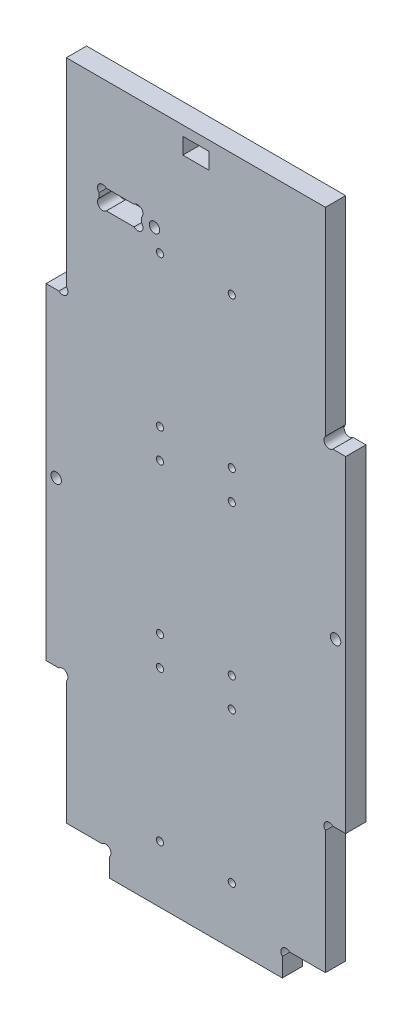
ISO-10303-21;
HEADER;
FILE_DESCRIPTION(('STEP AP214'),'2;1');
FILE_NAME('part.step','',(''),(''),'','','');
FILE_SCHEMA(('AUTOMOTIVE_DESIGN { 1 0 10303 214 1 1 1 1 }'));
ENDSEC;
DATA;
#1=APPLICATION_CONTEXT('core data for automotive mechanical design processes');
#2=APPLICATION_PROTOCOL_DEFINITION('international standard','automotive_design',2000,#1);
#3=PRODUCT_CONTEXT('',#1,'mechanical');
#4=PRODUCT('Part','Part','',(#3));
#5=PRODUCT_RELATED_PRODUCT_CATEGORY('part','',(#4));
#6=PRODUCT_DEFINITION_FORMATION('','',#4);
#7=PRODUCT_DEFINITION_CONTEXT('part definition',#1,'design');
#8=PRODUCT_DEFINITION('design','',#6,#7);
#9=PRODUCT_DEFINITION_SHAPE('','',#8);
#10=(LENGTH_UNIT() NAMED_UNIT(*) SI_UNIT(.MILLI.,.METRE.));
#11=(NAMED_UNIT(*) PLANE_ANGLE_UNIT() SI_UNIT($,.RADIAN.));
#12=(NAMED_UNIT(*) SI_UNIT($,.STERADIAN.) SOLID_ANGLE_UNIT());
#13=UNCERTAINTY_MEASURE_WITH_UNIT(LENGTH_MEASURE(1.E-05),#10,'distance_accuracy_value','');
#14=(GEOMETRIC_REPRESENTATION_CONTEXT(3) GLOBAL_UNCERTAINTY_ASSIGNED_CONTEXT((#13)) GLOBAL_UNIT_ASSIGNED_CONTEXT((#10,
#11,#12)) REPRESENTATION_CONTEXT('',''));
#15=CARTESIAN_POINT('',(0.,0.,0.));
#16=DIRECTION('',(0.,0.,1.));
#17=DIRECTION('',(1.,0.,0.));
#18=AXIS2_PLACEMENT_3D('',#15,#16,#17);
#19=CARTESIAN_POINT('',(86.6813708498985,151.131370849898,6.2));
#20=DIRECTION('',(0.,0.,1.));
#21=DIRECTION('',(1.,0.,0.));
#22=AXIS2_PLACEMENT_3D('',#19,#20,#21);
#23=PLANE('',#22);
#24=DIRECTION('',(0.,-1.,0.));
#25=VECTOR('',#24,1.);
#26=CARTESIAN_POINT('',(16.2,182.237258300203,6.2));
#27=LINE('',#26,#25);
#28=CARTESIAN_POINT('',(16.2,182.237258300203,6.2));
#29=VERTEX_POINT('',#28);
#30=CARTESIAN_POINT('',(16.2,180.762741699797,6.2));
#31=VERTEX_POINT('',#30);
#32=EDGE_CURVE('E246',#29,#31,#27,.T.);
#33=ORIENTED_EDGE('',*,*,#32,.F.);
#34=CARTESIAN_POINT('',(17.3313708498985,183.368629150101,6.2));
#35=DIRECTION('',(0.,0.,1.));
#36=DIRECTION('',(1.,0.,0.));
#37=AXIS2_PLACEMENT_3D('',#34,#35,#36);
#38=CIRCLE('',#37,1.6);
#39=CARTESIAN_POINT('',(18.4627416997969,184.5,6.2));
#40=VERTEX_POINT('',#39);
#41=EDGE_CURVE('E238',#40,#29,#38,.T.);
#42=ORIENTED_EDGE('',*,*,#41,.F.);
#43=DIRECTION('',(-1.,0.,0.));
#44=VECTOR('',#43,1.);
#45=CARTESIAN_POINT('',(26.9372583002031,184.5,6.2));
#46=LINE('',#45,#44);
#47=CARTESIAN_POINT('',(26.937258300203,184.5,6.2));
#48=VERTEX_POINT('',#47);
#49=EDGE_CURVE('E273',#48,#40,#46,.T.);
#50=ORIENTED_EDGE('',*,*,#49,.F.);
#51=CARTESIAN_POINT('',(28.0686291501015,183.368629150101,6.2));
#52=DIRECTION('',(0.,0.,1.));
#53=DIRECTION('',(-1.,0.,0.));
#54=AXIS2_PLACEMENT_3D('',#51,#52,#53);
#55=CIRCLE('',#54,1.60000000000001);
#56=CARTESIAN_POINT('',(29.2,182.237258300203,6.2));
#57=VERTEX_POINT('',#56);
#58=EDGE_CURVE('E271',#57,#48,#55,.T.);
#59=ORIENTED_EDGE('',*,*,#58,.F.);
#60=DIRECTION('',(0.,1.,0.));
#61=VECTOR('',#60,1.);
#62=CARTESIAN_POINT('',(29.2,180.762741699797,6.2));
#63=LINE('',#62,#61);
#64=CARTESIAN_POINT('',(29.2,180.762741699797,6.2));
#65=VERTEX_POINT('',#64);
#66=EDGE_CURVE('E269',#65,#57,#63,.T.);
#67=ORIENTED_EDGE('',*,*,#66,.F.);
#68=CARTESIAN_POINT('',(28.0686291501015,179.631370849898,6.2));
#69=DIRECTION('',(0.,0.,1.));
#70=DIRECTION('',(1.,0.,0.));
#71=AXIS2_PLACEMENT_3D('',#68,#69,#70);
#72=CIRCLE('',#71,1.59999999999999);
#73=CARTESIAN_POINT('',(26.9372583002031,178.5,6.2));
#74=VERTEX_POINT('',#73);
#75=EDGE_CURVE('E267',#74,#65,#72,.T.);
#76=ORIENTED_EDGE('',*,*,#75,.F.);
#77=DIRECTION('',(1.,0.,0.));
#78=VECTOR('',#77,1.);
#79=CARTESIAN_POINT('',(18.4627416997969,178.5,6.2));
#80=LINE('',#79,#78);
#81=CARTESIAN_POINT('',(18.4627416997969,178.5,6.2));
#82=VERTEX_POINT('',#81);
#83=EDGE_CURVE('E262',#82,#74,#80,.T.);
#84=ORIENTED_EDGE('',*,*,#83,.F.);
#85=CARTESIAN_POINT('',(17.3313708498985,179.631370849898,6.2));
#86=DIRECTION('',(0.,0.,1.));
#87=DIRECTION('',(-1.,0.,0.));
#88=AXIS2_PLACEMENT_3D('',#85,#86,#87);
#89=CIRCLE('',#88,1.59999999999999);
#90=EDGE_CURVE('E260',#31,#82,#89,.T.);
#91=ORIENTED_EDGE('',*,*,#90,.F.);
#92=EDGE_LOOP('',(#33,#42,#50,#59,#67,#76,#84,#91));
#93=FACE_BOUND('',#92,.T.);
#94=CARTESIAN_POINT('',(34.875,129.5,6.2));
#95=DIRECTION('',(0.,0.,1.));
#96=DIRECTION('',(1.,0.,0.));
#97=AXIS2_PLACEMENT_3D('',#94,#95,#96);
#98=CIRCLE('',#97,1.1);
#99=CARTESIAN_POINT('',(33.775,129.5,6.2));
#100=VERTEX_POINT('',#99);
#101=EDGE_CURVE('E312',#100,#100,#98,.T.);
#102=ORIENTED_EDGE('',*,*,#101,.F.);
#103=EDGE_LOOP('',(#102));
#104=FACE_BOUND('',#103,.T.);
#105=CARTESIAN_POINT('',(56.875,74.5,6.2));
#106=DIRECTION('',(0.,0.,1.));
#107=DIRECTION('',(-1.,0.,0.));
#108=AXIS2_PLACEMENT_3D('',#105,#106,#107);
#109=CIRCLE('',#108,1.1);
#110=CARTESIAN_POINT('',(55.775,74.5,6.2));
#111=VERTEX_POINT('',#110);
#112=EDGE_CURVE('E324',#111,#111,#109,.T.);
#113=ORIENTED_EDGE('',*,*,#112,.F.);
#114=EDGE_LOOP('',(#113));
#115=FACE_BOUND('',#114,.T.);
#116=CARTESIAN_POINT('',(56.875,65.5,6.2));
#117=DIRECTION('',(0.,0.,1.));
#118=DIRECTION('',(1.,0.,0.));
#119=AXIS2_PLACEMENT_3D('',#116,#117,#118);
#120=CIRCLE('',#119,1.1);
#121=CARTESIAN_POINT('',(55.775,65.5,6.2));
#122=VERTEX_POINT('',#121);
#123=EDGE_CURVE('E336',#122,#122,#120,.T.);
#124=ORIENTED_EDGE('',*,*,#123,.F.);
#125=EDGE_LOOP('',(#124));
#126=FACE_BOUND('',#125,.T.);
#127=CARTESIAN_POINT('',(56.875,19.5,6.2));
#128=DIRECTION('',(0.,0.,1.));
#129=DIRECTION('',(-1.,0.,0.));
#130=AXIS2_PLACEMENT_3D('',#127,#128,#129);
#131=CIRCLE('',#130,1.1);
#132=CARTESIAN_POINT('',(55.775,19.5,6.2));
#133=VERTEX_POINT('',#132);
#134=EDGE_CURVE('E373',#133,#133,#131,.T.);
#135=ORIENTED_EDGE('',*,*,#134,.F.);
#136=EDGE_LOOP('',(#135));
#137=FACE_BOUND('',#136,.T.);
#138=CARTESIAN_POINT('',(34.875,19.5,6.2));
#139=DIRECTION('',(0.,0.,1.));
#140=DIRECTION('',(1.,0.,0.));
#141=AXIS2_PLACEMENT_3D('',#138,#139,#140);
#142=CIRCLE('',#141,1.1);
#143=CARTESIAN_POINT('',(33.775,19.5,6.2));
#144=VERTEX_POINT('',#143);
#145=EDGE_CURVE('E385',#144,#144,#142,.T.);
#146=ORIENTED_EDGE('',*,*,#145,.F.);
#147=EDGE_LOOP('',(#146));
#148=FACE_BOUND('',#147,.T.);
#149=CARTESIAN_POINT('',(34.875,175.5,6.2));
#150=DIRECTION('',(0.,0.,1.));
#151=DIRECTION('',(-1.,0.,0.));
#152=AXIS2_PLACEMENT_3D('',#149,#150,#151);
#153=CIRCLE('',#152,1.1);
#154=CARTESIAN_POINT('',(33.775,175.5,6.2));
#155=VERTEX_POINT('',#154);
#156=EDGE_CURVE('E397',#155,#155,#153,.T.);
#157=ORIENTED_EDGE('',*,*,#156,.F.);
#158=EDGE_LOOP('',(#157));
#159=FACE_BOUND('',#158,.T.);
#160=CARTESIAN_POINT('',(88.65,100.,6.2));
#161=DIRECTION('',(0.,0.,1.));
#162=DIRECTION('',(-1.,0.,0.));
#163=AXIS2_PLACEMENT_3D('',#160,#161,#162);
#164=CIRCLE('',#163,1.60000000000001);
#165=CARTESIAN_POINT('',(87.05,100.,6.2));
#166=VERTEX_POINT('',#165);
#167=EDGE_CURVE('E409',#166,#166,#164,.T.);
#168=ORIENTED_EDGE('',*,*,#167,.F.);
#169=EDGE_LOOP('',(#168));
#170=FACE_BOUND('',#169,.T.);
#171=DIRECTION('',(0.,1.,0.));
#172=VECTOR('',#171,1.);
#173=CARTESIAN_POINT('',(91.75,50.,6.2));
#174=LINE('',#173,#172);
#175=CARTESIAN_POINT('',(91.75,50.,6.2));
#176=VERTEX_POINT('',#175);
#177=CARTESIAN_POINT('',(91.75,150.,6.2));
#178=VERTEX_POINT('',#177);
#179=EDGE_CURVE('E421',#176,#178,#174,.T.);
#180=ORIENTED_EDGE('',*,*,#179,.T.);
#181=DIRECTION('',(-1.,0.,0.));
#182=VECTOR('',#181,1.);
#183=CARTESIAN_POINT('',(87.8127416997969,150.,6.2));
#184=LINE('',#183,#182);
#185=CARTESIAN_POINT('',(87.8127416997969,150.,6.2));
#186=VERTEX_POINT('',#185);
#187=EDGE_CURVE('E424',#178,#186,#184,.T.);
#188=ORIENTED_EDGE('',*,*,#187,.T.);
#189=CARTESIAN_POINT('',(86.6813708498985,151.131370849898,6.2));
#190=DIRECTION('',(0.,0.,-1.));
#191=DIRECTION('',(1.,0.,0.));
#192=AXIS2_PLACEMENT_3D('',#189,#190,#191);
#193=CIRCLE('',#192,1.60000000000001);
#194=CARTESIAN_POINT('',(85.55,152.262741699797,6.2));
#195=VERTEX_POINT('',#194);
#196=EDGE_CURVE('E427',#186,#195,#193,.T.);
#197=ORIENTED_EDGE('',*,*,#196,.T.);
#198=DIRECTION('',(0.,1.,0.));
#199=VECTOR('',#198,1.);
#200=CARTESIAN_POINT('',(85.55,213.,6.2));
#201=LINE('',#200,#199);
#202=CARTESIAN_POINT('',(85.55,213.,6.2));
#203=VERTEX_POINT('',#202);
#204=EDGE_CURVE('E429',#195,#203,#201,.T.);
#205=ORIENTED_EDGE('',*,*,#204,.T.);
#206=DIRECTION('',(-1.,0.,0.));
#207=VECTOR('',#206,1.);
#208=CARTESIAN_POINT('',(6.2,213.,6.2));
#209=LINE('',#208,#207);
#210=CARTESIAN_POINT('',(6.2,213.,6.2));
#211=VERTEX_POINT('',#210);
#212=EDGE_CURVE('E431',#203,#211,#209,.T.);
#213=ORIENTED_EDGE('',*,*,#212,.T.);
#214=DIRECTION('',(0.,-1.,0.));
#215=VECTOR('',#214,1.);
#216=CARTESIAN_POINT('',(6.2,152.262741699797,6.2));
#217=LINE('',#216,#215);
#218=CARTESIAN_POINT('',(6.2,152.262741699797,6.2));
#219=VERTEX_POINT('',#218);
#220=EDGE_CURVE('E433',#211,#219,#217,.T.);
#221=ORIENTED_EDGE('',*,*,#220,.T.);
#222=CARTESIAN_POINT('',(5.06862915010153,151.131370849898,6.2));
#223=DIRECTION('',(0.,0.,-1.));
#224=DIRECTION('',(-1.,0.,0.));
#225=AXIS2_PLACEMENT_3D('',#222,#223,#224);
#226=CIRCLE('',#225,1.60000000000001);
#227=CARTESIAN_POINT('',(3.93725830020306,150.,6.2));
#228=VERTEX_POINT('',#227);
#229=EDGE_CURVE('E435',#219,#228,#226,.T.);
#230=ORIENTED_EDGE('',*,*,#229,.T.);
#231=DIRECTION('',(-1.,0.,0.));
#232=VECTOR('',#231,1.);
#233=CARTESIAN_POINT('',(3.93725830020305,150.,6.2));
#234=LINE('',#233,#232);
#235=CARTESIAN_POINT('',(0.,150.,6.2));
#236=VERTEX_POINT('',#235);
#237=EDGE_CURVE('E437',#228,#236,#234,.T.);
#238=ORIENTED_EDGE('',*,*,#237,.T.);
#239=DIRECTION('',(0.,-1.,0.));
#240=VECTOR('',#239,1.);
#241=CARTESIAN_POINT('',(0.,50.,6.2));
#242=LINE('',#241,#240);
#243=CARTESIAN_POINT('',(0.,50.,6.2));
#244=VERTEX_POINT('',#243);
#245=EDGE_CURVE('E439',#236,#244,#242,.T.);
#246=ORIENTED_EDGE('',*,*,#245,.T.);
#247=DIRECTION('',(1.,0.,0.));
#248=VECTOR('',#247,1.);
#249=CARTESIAN_POINT('',(3.93725830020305,50.,6.2));
#250=LINE('',#249,#248);
#251=CARTESIAN_POINT('',(3.93725830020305,50.,6.2));
#252=VERTEX_POINT('',#251);
#253=EDGE_CURVE('E441',#244,#252,#250,.T.);
#254=ORIENTED_EDGE('',*,*,#253,.T.);
#255=CARTESIAN_POINT('',(5.06862915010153,48.8686291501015,6.2));
#256=DIRECTION('',(0.,0.,-1.));
#257=DIRECTION('',(1.,0.,0.));
#258=AXIS2_PLACEMENT_3D('',#255,#256,#257);
#259=CIRCLE('',#258,1.6);
#260=CARTESIAN_POINT('',(6.2,47.737258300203,6.2));
#261=VERTEX_POINT('',#260);
#262=EDGE_CURVE('E443',#252,#261,#259,.T.);
#263=ORIENTED_EDGE('',*,*,#262,.T.);
#264=DIRECTION('',(0.,-1.,0.));
#265=VECTOR('',#264,1.);
#266=CARTESIAN_POINT('',(6.2,47.737258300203,6.2));
#267=LINE('',#266,#265);
#268=CARTESIAN_POINT('',(6.2,10.,6.2));
#269=VERTEX_POINT('',#268);
#270=EDGE_CURVE('E445',#261,#269,#267,.T.);
#271=ORIENTED_EDGE('',*,*,#270,.T.);
#272=DIRECTION('',(1.,0.,0.));
#273=VECTOR('',#272,1.);
#274=CARTESIAN_POINT('',(17.1372583,10.,6.2));
#275=LINE('',#274,#273);
#276=CARTESIAN_POINT('',(17.1372583,10.,6.2));
#277=VERTEX_POINT('',#276);
#278=EDGE_CURVE('E447',#269,#277,#275,.T.);
#279=ORIENTED_EDGE('',*,*,#278,.T.);
#280=CARTESIAN_POINT('',(18.26862915,8.86862915,6.2));
#281=DIRECTION('',(0.,0.,-1.));
#282=DIRECTION('',(-1.,0.,0.));
#283=AXIS2_PLACEMENT_3D('',#280,#281,#282);
#284=CIRCLE('',#283,1.60000000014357);
#285=CARTESIAN_POINT('',(19.4,7.73725830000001,6.2));
#286=VERTEX_POINT('',#285);
#287=EDGE_CURVE('E449',#277,#286,#284,.T.);
#288=ORIENTED_EDGE('',*,*,#287,.T.);
#289=DIRECTION('',(0.,-1.,0.));
#290=VECTOR('',#289,1.);
#291=CARTESIAN_POINT('',(19.4,7.73725830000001,6.2));
#292=LINE('',#291,#290);
#293=CARTESIAN_POINT('',(19.4,2.,6.2));
#294=VERTEX_POINT('',#293);
#295=EDGE_CURVE('E451',#286,#294,#292,.T.);
#296=ORIENTED_EDGE('',*,*,#295,.T.);
#297=DIRECTION('',(1.,0.,0.));
#298=VECTOR('',#297,1.);
#299=CARTESIAN_POINT('',(19.4,2.,6.2));
#300=LINE('',#299,#298);
#301=CARTESIAN_POINT('',(72.35,2.,6.2));
#302=VERTEX_POINT('',#301);
#303=EDGE_CURVE('E453',#294,#302,#300,.T.);
#304=ORIENTED_EDGE('',*,*,#303,.T.);
#305=DIRECTION('',(0.,1.,0.));
#306=VECTOR('',#305,1.);
#307=CARTESIAN_POINT('',(72.35,7.73725830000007,6.2));
#308=LINE('',#307,#306);
#309=CARTESIAN_POINT('',(72.35,7.73725830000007,6.2));
#310=VERTEX_POINT('',#309);
#311=EDGE_CURVE('E455',#302,#310,#308,.T.);
#312=ORIENTED_EDGE('',*,*,#311,.T.);
#313=CARTESIAN_POINT('',(73.4813708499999,8.86862915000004,6.2));
#314=DIRECTION('',(0.,0.,-1.));
#315=DIRECTION('',(1.,0.,0.));
#316=AXIS2_PLACEMENT_3D('',#313,#314,#315);
#317=CIRCLE('',#316,1.60000000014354);
#318=CARTESIAN_POINT('',(74.6127417,9.99999999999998,6.2));
#319=VERTEX_POINT('',#318);
#320=EDGE_CURVE('E457',#310,#319,#317,.T.);
#321=ORIENTED_EDGE('',*,*,#320,.T.);
#322=DIRECTION('',(1.,0.,0.));
#323=VECTOR('',#322,1.);
#324=CARTESIAN_POINT('',(74.6127417,10.,6.2));
#325=LINE('',#324,#323);
#326=CARTESIAN_POINT('',(85.55,10.,6.2));
#327=VERTEX_POINT('',#326);
#328=EDGE_CURVE('E459',#319,#327,#325,.T.);
#329=ORIENTED_EDGE('',*,*,#328,.T.);
#330=DIRECTION('',(0.,1.,0.));
#331=VECTOR('',#330,1.);
#332=CARTESIAN_POINT('',(85.55,47.737258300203,6.2));
#333=LINE('',#332,#331);
#334=CARTESIAN_POINT('',(85.55,47.737258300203,6.2));
#335=VERTEX_POINT('',#334);
#336=EDGE_CURVE('E461',#327,#335,#333,.T.);
#337=ORIENTED_EDGE('',*,*,#336,.T.);
#338=CARTESIAN_POINT('',(86.6813708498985,48.8686291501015,6.2));
#339=DIRECTION('',(0.,0.,-1.));
#340=DIRECTION('',(-1.,0.,0.));
#341=AXIS2_PLACEMENT_3D('',#338,#339,#340);
#342=CIRCLE('',#341,1.6);
#343=CARTESIAN_POINT('',(87.8127416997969,50.,6.2));
#344=VERTEX_POINT('',#343);
#345=EDGE_CURVE('E463',#335,#344,#342,.T.);
#346=ORIENTED_EDGE('',*,*,#345,.T.);
#347=DIRECTION('',(1.,0.,0.));
#348=VECTOR('',#347,1.);
#349=CARTESIAN_POINT('',(87.8127416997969,50.,6.2));
#350=LINE('',#349,#348);
#351=EDGE_CURVE('E465',#344,#176,#350,.T.);
#352=ORIENTED_EDGE('',*,*,#351,.T.);
#353=EDGE_LOOP('',(#180,#188,#197,#205,#213,#221,#230,#238,#246,#254,#263,#271,#279,#288,#296,
#304,#312,#321,#329,#337,#346,#352));
#354=FACE_BOUND('',#353,.T.);
#355=CARTESIAN_POINT('',(3.1,100.,6.2));
#356=DIRECTION('',(0.,0.,1.));
#357=DIRECTION('',(1.,0.,0.));
#358=AXIS2_PLACEMENT_3D('',#355,#356,#357);
#359=CIRCLE('',#358,1.6);
#360=CARTESIAN_POINT('',(1.5,100.,6.2));
#361=VERTEX_POINT('',#360);
#362=EDGE_CURVE('E415',#361,#361,#359,.T.);
#363=ORIENTED_EDGE('',*,*,#362,.F.);
#364=EDGE_LOOP('',(#363));
#365=FACE_BOUND('',#364,.T.);
#366=CARTESIAN_POINT('',(56.875,120.5,6.2));
#367=DIRECTION('',(0.,0.,1.));
#368=DIRECTION('',(1.,0.,0.));
#369=AXIS2_PLACEMENT_3D('',#366,#367,#368);
#370=CIRCLE('',#369,1.1);
#371=CARTESIAN_POINT('',(55.775,120.5,6.2));
#372=VERTEX_POINT('',#371);
#373=EDGE_CURVE('E403',#372,#372,#370,.T.);
#374=ORIENTED_EDGE('',*,*,#373,.F.);
#375=EDGE_LOOP('',(#374));
#376=FACE_BOUND('',#375,.T.);
#377=CARTESIAN_POINT('',(56.875,175.5,6.2));
#378=DIRECTION('',(0.,0.,1.));
#379=DIRECTION('',(1.,0.,0.));
#380=AXIS2_PLACEMENT_3D('',#377,#378,#379);
#381=CIRCLE('',#380,1.1);
#382=CARTESIAN_POINT('',(55.775,175.5,6.2));
#383=VERTEX_POINT('',#382);
#384=EDGE_CURVE('E391',#383,#383,#381,.T.);
#385=ORIENTED_EDGE('',*,*,#384,.F.);
#386=EDGE_LOOP('',(#385));
#387=FACE_BOUND('',#386,.T.);
#388=CARTESIAN_POINT('',(34.875,65.5,6.2));
#389=DIRECTION('',(0.,0.,1.));
#390=DIRECTION('',(-1.,0.,0.));
#391=AXIS2_PLACEMENT_3D('',#388,#389,#390);
#392=CIRCLE('',#391,1.1);
#393=CARTESIAN_POINT('',(33.775,65.5,6.2));
#394=VERTEX_POINT('',#393);
#395=EDGE_CURVE('E379',#394,#394,#392,.T.);
#396=ORIENTED_EDGE('',*,*,#395,.F.);
#397=EDGE_LOOP('',(#396));
#398=FACE_BOUND('',#397,.T.);
#399=DIRECTION('',(1.,0.,0.));
#400=VECTOR('',#399,1.);
#401=CARTESIAN_POINT('',(41.875,205.,6.2));
#402=LINE('',#401,#400);
#403=CARTESIAN_POINT('',(41.875,205.,6.2));
#404=VERTEX_POINT('',#403);
#405=CARTESIAN_POINT('',(49.875,205.,6.2));
#406=VERTEX_POINT('',#405);
#407=EDGE_CURVE('E344',#404,#406,#402,.T.);
#408=ORIENTED_EDGE('',*,*,#407,.F.);
#409=DIRECTION('',(0.,-1.,0.));
#410=VECTOR('',#409,1.);
#411=CARTESIAN_POINT('',(41.875,210.,6.2));
#412=LINE('',#411,#410);
#413=CARTESIAN_POINT('',(41.875,210.,6.2));
#414=VERTEX_POINT('',#413);
#415=EDGE_CURVE('E342',#414,#404,#412,.T.);
#416=ORIENTED_EDGE('',*,*,#415,.F.);
#417=DIRECTION('',(-1.,0.,0.));
#418=VECTOR('',#417,1.);
#419=CARTESIAN_POINT('',(41.875,210.,6.2));
#420=LINE('',#419,#418);
#421=CARTESIAN_POINT('',(49.875,210.,6.2));
#422=VERTEX_POINT('',#421);
#423=EDGE_CURVE('E350',#422,#414,#420,.T.);
#424=ORIENTED_EDGE('',*,*,#423,.F.);
#425=DIRECTION('',(0.,1.,0.));
#426=VECTOR('',#425,1.);
#427=CARTESIAN_POINT('',(49.875,210.,6.2));
#428=LINE('',#427,#426);
#429=EDGE_CURVE('E347',#406,#422,#428,.T.);
#430=ORIENTED_EDGE('',*,*,#429,.F.);
#431=EDGE_LOOP('',(#408,#416,#424,#430));
#432=FACE_BOUND('',#431,.T.);
#433=CARTESIAN_POINT('',(34.875,120.5,6.2));
#434=DIRECTION('',(0.,0.,1.));
#435=DIRECTION('',(-1.,0.,0.));
#436=AXIS2_PLACEMENT_3D('',#433,#434,#435);
#437=CIRCLE('',#436,1.1);
#438=CARTESIAN_POINT('',(33.775,120.5,6.2));
#439=VERTEX_POINT('',#438);
#440=EDGE_CURVE('E330',#439,#439,#437,.T.);
#441=ORIENTED_EDGE('',*,*,#440,.F.);
#442=EDGE_LOOP('',(#441));
#443=FACE_BOUND('',#442,.T.);
#444=CARTESIAN_POINT('',(34.875,74.5,6.2));
#445=DIRECTION('',(0.,0.,1.));
#446=DIRECTION('',(1.,0.,0.));
#447=AXIS2_PLACEMENT_3D('',#444,#445,#446);
#448=CIRCLE('',#447,1.1);
#449=CARTESIAN_POINT('',(33.775,74.5,6.2));
#450=VERTEX_POINT('',#449);
#451=EDGE_CURVE('E318',#450,#450,#448,.T.);
#452=ORIENTED_EDGE('',*,*,#451,.F.);
#453=EDGE_LOOP('',(#452));
#454=FACE_BOUND('',#453,.T.);
#455=CARTESIAN_POINT('',(56.875,129.5,6.2));
#456=DIRECTION('',(0.,0.,1.));
#457=DIRECTION('',(-1.,0.,0.));
#458=AXIS2_PLACEMENT_3D('',#455,#456,#457);
#459=CIRCLE('',#458,1.1);
#460=CARTESIAN_POINT('',(55.775,129.5,6.2));
#461=VERTEX_POINT('',#460);
#462=EDGE_CURVE('E306',#461,#461,#459,.T.);
#463=ORIENTED_EDGE('',*,*,#462,.F.);
#464=EDGE_LOOP('',(#463));
#465=FACE_BOUND('',#464,.T.);
#466=CARTESIAN_POINT('',(33.2,181.5,6.2));
#467=DIRECTION('',(0.,0.,1.));
#468=DIRECTION('',(1.,0.,0.));
#469=AXIS2_PLACEMENT_3D('',#466,#467,#468);
#470=CIRCLE('',#469,1.6);
#471=CARTESIAN_POINT('',(31.6,181.5,6.2));
#472=VERTEX_POINT('',#471);
#473=EDGE_CURVE('E276',#472,#472,#470,.T.);
#474=ORIENTED_EDGE('',*,*,#473,.F.);
#475=EDGE_LOOP('',(#474));
#476=FACE_BOUND('',#475,.T.);
#477=ADVANCED_FACE('F17',(#93,#104,#115,#126,#137,#148,#159,#170,#354,#365,#376,#387,#398,#432,
#443,#454,#465,#476),#23,.T.);
#478=CARTESIAN_POINT('',(86.6813708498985,151.131370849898,0.));
#479=DIRECTION('',(0.,0.,1.));
#480=DIRECTION('',(1.,0.,0.));
#481=AXIS2_PLACEMENT_3D('',#478,#479,#480);
#482=PLANE('',#481);
#483=CARTESIAN_POINT('',(17.3313708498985,183.368629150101,0.));
#484=DIRECTION('',(0.,0.,1.));
#485=DIRECTION('',(1.,0.,0.));
#486=AXIS2_PLACEMENT_3D('',#483,#484,#485);
#487=CIRCLE('',#486,1.6);
#488=CARTESIAN_POINT('',(18.4627416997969,184.5,0.));
#489=VERTEX_POINT('',#488);
#490=CARTESIAN_POINT('',(16.2,182.237258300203,0.));
#491=VERTEX_POINT('',#490);
#492=EDGE_CURVE('E40',#489,#491,#487,.T.);
#493=ORIENTED_EDGE('',*,*,#492,.T.);
#494=DIRECTION('',(0.,-1.,0.));
#495=VECTOR('',#494,1.);
#496=CARTESIAN_POINT('',(16.2,182.237258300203,0.));
#497=LINE('',#496,#495);
#498=CARTESIAN_POINT('',(16.2,180.762741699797,0.));
#499=VERTEX_POINT('',#498);
#500=EDGE_CURVE('E253',#491,#499,#497,.T.);
#501=ORIENTED_EDGE('',*,*,#500,.T.);
#502=CARTESIAN_POINT('',(17.3313708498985,179.631370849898,0.));
#503=DIRECTION('',(0.,0.,1.));
#504=DIRECTION('',(-1.,0.,0.));
#505=AXIS2_PLACEMENT_3D('',#502,#503,#504);
#506=CIRCLE('',#505,1.59999999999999);
#507=CARTESIAN_POINT('',(18.4627416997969,178.5,0.));
#508=VERTEX_POINT('',#507);
#509=EDGE_CURVE('E278',#499,#508,#506,.T.);
#510=ORIENTED_EDGE('',*,*,#509,.T.);
#511=DIRECTION('',(1.,0.,0.));
#512=VECTOR('',#511,1.);
#513=CARTESIAN_POINT('',(18.4627416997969,178.5,0.));
#514=LINE('',#513,#512);
#515=CARTESIAN_POINT('',(26.9372583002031,178.5,0.));
#516=VERTEX_POINT('',#515);
#517=EDGE_CURVE('E281',#508,#516,#514,.T.);
#518=ORIENTED_EDGE('',*,*,#517,.T.);
#519=CARTESIAN_POINT('',(28.0686291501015,179.631370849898,0.));
#520=DIRECTION('',(0.,0.,1.));
#521=DIRECTION('',(1.,0.,0.));
#522=AXIS2_PLACEMENT_3D('',#519,#520,#521);
#523=CIRCLE('',#522,1.59999999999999);
#524=CARTESIAN_POINT('',(29.2,180.762741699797,0.));
#525=VERTEX_POINT('',#524);
#526=EDGE_CURVE('E284',#516,#525,#523,.T.);
#527=ORIENTED_EDGE('',*,*,#526,.T.);
#528=DIRECTION('',(0.,1.,0.));
#529=VECTOR('',#528,1.);
#530=CARTESIAN_POINT('',(29.2,180.762741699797,0.));
#531=LINE('',#530,#529);
#532=CARTESIAN_POINT('',(29.2,182.237258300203,0.));
#533=VERTEX_POINT('',#532);
#534=EDGE_CURVE('E287',#525,#533,#531,.T.);
#535=ORIENTED_EDGE('',*,*,#534,.T.);
#536=CARTESIAN_POINT('',(28.0686291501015,183.368629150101,0.));
#537=DIRECTION('',(0.,0.,1.));
#538=DIRECTION('',(-1.,0.,0.));
#539=AXIS2_PLACEMENT_3D('',#536,#537,#538);
#540=CIRCLE('',#539,1.60000000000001);
#541=CARTESIAN_POINT('',(26.9372583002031,184.5,0.));
#542=VERTEX_POINT('',#541);
#543=EDGE_CURVE('E290',#533,#542,#540,.T.);
#544=ORIENTED_EDGE('',*,*,#543,.T.);
#545=DIRECTION('',(-1.,0.,0.));
#546=VECTOR('',#545,1.);
#547=CARTESIAN_POINT('',(26.9372583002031,184.5,0.));
#548=LINE('',#547,#546);
#549=EDGE_CURVE('E247',#542,#489,#548,.T.);
#550=ORIENTED_EDGE('',*,*,#549,.T.);
#551=EDGE_LOOP('',(#493,#501,#510,#518,#527,#535,#544,#550));
#552=FACE_BOUND('',#551,.T.);
#553=CARTESIAN_POINT('',(34.875,129.5,0.));
#554=DIRECTION('',(0.,0.,1.));
#555=DIRECTION('',(1.,0.,0.));
#556=AXIS2_PLACEMENT_3D('',#553,#554,#555);
#557=CIRCLE('',#556,1.1);
#558=CARTESIAN_POINT('',(33.775,129.5,0.));
#559=VERTEX_POINT('',#558);
#560=EDGE_CURVE('E309',#559,#559,#557,.T.);
#561=ORIENTED_EDGE('',*,*,#560,.T.);
#562=EDGE_LOOP('',(#561));
#563=FACE_BOUND('',#562,.T.);
#564=CARTESIAN_POINT('',(56.875,74.5,0.));
#565=DIRECTION('',(0.,0.,1.));
#566=DIRECTION('',(-1.,0.,0.));
#567=AXIS2_PLACEMENT_3D('',#564,#565,#566);
#568=CIRCLE('',#567,1.1);
#569=CARTESIAN_POINT('',(55.775,74.5,0.));
#570=VERTEX_POINT('',#569);
#571=EDGE_CURVE('E321',#570,#570,#568,.T.);
#572=ORIENTED_EDGE('',*,*,#571,.T.);
#573=EDGE_LOOP('',(#572));
#574=FACE_BOUND('',#573,.T.);
#575=CARTESIAN_POINT('',(56.875,65.5,0.));
#576=DIRECTION('',(0.,0.,1.));
#577=DIRECTION('',(1.,0.,0.));
#578=AXIS2_PLACEMENT_3D('',#575,#576,#577);
#579=CIRCLE('',#578,1.1);
#580=CARTESIAN_POINT('',(55.775,65.5,0.));
#581=VERTEX_POINT('',#580);
#582=EDGE_CURVE('E333',#581,#581,#579,.T.);
#583=ORIENTED_EDGE('',*,*,#582,.T.);
#584=EDGE_LOOP('',(#583));
#585=FACE_BOUND('',#584,.T.);
#586=CARTESIAN_POINT('',(56.875,19.5,0.));
#587=DIRECTION('',(0.,0.,1.));
#588=DIRECTION('',(-1.,0.,0.));
#589=AXIS2_PLACEMENT_3D('',#586,#587,#588);
#590=CIRCLE('',#589,1.1);
#591=CARTESIAN_POINT('',(55.775,19.5,0.));
#592=VERTEX_POINT('',#591);
#593=EDGE_CURVE('E372',#592,#592,#590,.T.);
#594=ORIENTED_EDGE('',*,*,#593,.T.);
#595=EDGE_LOOP('',(#594));
#596=FACE_BOUND('',#595,.T.);
#597=CARTESIAN_POINT('',(34.875,19.5,0.));
#598=DIRECTION('',(0.,0.,1.));
#599=DIRECTION('',(1.,0.,0.));
#600=AXIS2_PLACEMENT_3D('',#597,#598,#599);
#601=CIRCLE('',#600,1.1);
#602=CARTESIAN_POINT('',(33.775,19.5,0.));
#603=VERTEX_POINT('',#602);
#604=EDGE_CURVE('E382',#603,#603,#601,.T.);
#605=ORIENTED_EDGE('',*,*,#604,.T.);
#606=EDGE_LOOP('',(#605));
#607=FACE_BOUND('',#606,.T.);
#608=CARTESIAN_POINT('',(34.875,175.5,0.));
#609=DIRECTION('',(0.,0.,1.));
#610=DIRECTION('',(-1.,0.,0.));
#611=AXIS2_PLACEMENT_3D('',#608,#609,#610);
#612=CIRCLE('',#611,1.1);
#613=CARTESIAN_POINT('',(33.775,175.5,0.));
#614=VERTEX_POINT('',#613);
#615=EDGE_CURVE('E394',#614,#614,#612,.T.);
#616=ORIENTED_EDGE('',*,*,#615,.T.);
#617=EDGE_LOOP('',(#616));
#618=FACE_BOUND('',#617,.T.);
#619=CARTESIAN_POINT('',(88.65,100.,0.));
#620=DIRECTION('',(0.,0.,1.));
#621=DIRECTION('',(-1.,0.,0.));
#622=AXIS2_PLACEMENT_3D('',#619,#620,#621);
#623=CIRCLE('',#622,1.60000000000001);
#624=CARTESIAN_POINT('',(87.05,100.,0.));
#625=VERTEX_POINT('',#624);
#626=EDGE_CURVE('E406',#625,#625,#623,.T.);
#627=ORIENTED_EDGE('',*,*,#626,.T.);
#628=EDGE_LOOP('',(#627));
#629=FACE_BOUND('',#628,.T.);
#630=DIRECTION('',(0.,1.,0.));
#631=VECTOR('',#630,1.);
#632=CARTESIAN_POINT('',(91.75,50.,0.));
#633=LINE('',#632,#631);
#634=CARTESIAN_POINT('',(91.75,50.,0.));
#635=VERTEX_POINT('',#634);
#636=CARTESIAN_POINT('',(91.75,150.,0.));
#637=VERTEX_POINT('',#636);
#638=EDGE_CURVE('E418',#635,#637,#633,.T.);
#639=ORIENTED_EDGE('',*,*,#638,.F.);
#640=DIRECTION('',(1.,0.,0.));
#641=VECTOR('',#640,1.);
#642=CARTESIAN_POINT('',(87.8127416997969,50.,0.));
#643=LINE('',#642,#641);
#644=CARTESIAN_POINT('',(87.8127416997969,50.,0.));
#645=VERTEX_POINT('',#644);
#646=EDGE_CURVE('E425',#645,#635,#643,.T.);
#647=ORIENTED_EDGE('',*,*,#646,.F.);
#648=CARTESIAN_POINT('',(86.6813708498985,48.8686291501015,0.));
#649=DIRECTION('',(0.,0.,-1.));
#650=DIRECTION('',(-1.,0.,0.));
#651=AXIS2_PLACEMENT_3D('',#648,#649,#650);
#652=CIRCLE('',#651,1.6);
#653=CARTESIAN_POINT('',(85.55,47.737258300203,0.));
#654=VERTEX_POINT('',#653);
#655=EDGE_CURVE('E508',#654,#645,#652,.T.);
#656=ORIENTED_EDGE('',*,*,#655,.F.);
#657=DIRECTION('',(0.,1.,0.));
#658=VECTOR('',#657,1.);
#659=CARTESIAN_POINT('',(85.55,47.737258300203,0.));
#660=LINE('',#659,#658);
#661=CARTESIAN_POINT('',(85.55,10.,0.));
#662=VERTEX_POINT('',#661);
#663=EDGE_CURVE('E506',#662,#654,#660,.T.);
#664=ORIENTED_EDGE('',*,*,#663,.F.);
#665=DIRECTION('',(1.,0.,0.));
#666=VECTOR('',#665,1.);
#667=CARTESIAN_POINT('',(74.6127417,10.,0.));
#668=LINE('',#667,#666);
#669=CARTESIAN_POINT('',(74.6127417,9.99999999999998,0.));
#670=VERTEX_POINT('',#669);
#671=EDGE_CURVE('E504',#670,#662,#668,.T.);
#672=ORIENTED_EDGE('',*,*,#671,.F.);
#673=CARTESIAN_POINT('',(73.4813708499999,8.86862915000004,0.));
#674=DIRECTION('',(0.,0.,-1.));
#675=DIRECTION('',(1.,0.,0.));
#676=AXIS2_PLACEMENT_3D('',#673,#674,#675);
#677=CIRCLE('',#676,1.60000000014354);
#678=CARTESIAN_POINT('',(72.35,7.73725830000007,0.));
#679=VERTEX_POINT('',#678);
#680=EDGE_CURVE('E502',#679,#670,#677,.T.);
#681=ORIENTED_EDGE('',*,*,#680,.F.);
#682=DIRECTION('',(0.,1.,0.));
#683=VECTOR('',#682,1.);
#684=CARTESIAN_POINT('',(72.35,7.73725830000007,0.));
#685=LINE('',#684,#683);
#686=CARTESIAN_POINT('',(72.35,2.,0.));
#687=VERTEX_POINT('',#686);
#688=EDGE_CURVE('E500',#687,#679,#685,.T.);
#689=ORIENTED_EDGE('',*,*,#688,.F.);
#690=DIRECTION('',(1.,0.,0.));
#691=VECTOR('',#690,1.);
#692=CARTESIAN_POINT('',(19.4,2.,0.));
#693=LINE('',#692,#691);
#694=CARTESIAN_POINT('',(19.4,2.,0.));
#695=VERTEX_POINT('',#694);
#696=EDGE_CURVE('E498',#695,#687,#693,.T.);
#697=ORIENTED_EDGE('',*,*,#696,.F.);
#698=DIRECTION('',(0.,-1.,0.));
#699=VECTOR('',#698,1.);
#700=CARTESIAN_POINT('',(19.4,7.73725830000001,0.));
#701=LINE('',#700,#699);
#702=CARTESIAN_POINT('',(19.4,7.73725830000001,0.));
#703=VERTEX_POINT('',#702);
#704=EDGE_CURVE('E496',#703,#695,#701,.T.);
#705=ORIENTED_EDGE('',*,*,#704,.F.);
#706=CARTESIAN_POINT('',(18.26862915,8.86862915,0.));
#707=DIRECTION('',(0.,0.,-1.));
#708=DIRECTION('',(-1.,0.,0.));
#709=AXIS2_PLACEMENT_3D('',#706,#707,#708);
#710=CIRCLE('',#709,1.60000000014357);
#711=CARTESIAN_POINT('',(17.1372583,10.,0.));
#712=VERTEX_POINT('',#711);
#713=EDGE_CURVE('E494',#712,#703,#710,.T.);
#714=ORIENTED_EDGE('',*,*,#713,.F.);
#715=DIRECTION('',(1.,0.,0.));
#716=VECTOR('',#715,1.);
#717=CARTESIAN_POINT('',(17.1372583,10.,0.));
#718=LINE('',#717,#716);
#719=CARTESIAN_POINT('',(6.2,10.,0.));
#720=VERTEX_POINT('',#719);
#721=EDGE_CURVE('E492',#720,#712,#718,.T.);
#722=ORIENTED_EDGE('',*,*,#721,.F.);
#723=DIRECTION('',(0.,-1.,0.));
#724=VECTOR('',#723,1.);
#725=CARTESIAN_POINT('',(6.2,47.737258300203,0.));
#726=LINE('',#725,#724);
#727=CARTESIAN_POINT('',(6.2,47.737258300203,0.));
#728=VERTEX_POINT('',#727);
#729=EDGE_CURVE('E490',#728,#720,#726,.T.);
#730=ORIENTED_EDGE('',*,*,#729,.F.);
#731=CARTESIAN_POINT('',(5.06862915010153,48.8686291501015,0.));
#732=DIRECTION('',(0.,0.,-1.));
#733=DIRECTION('',(1.,0.,0.));
#734=AXIS2_PLACEMENT_3D('',#731,#732,#733);
#735=CIRCLE('',#734,1.6);
#736=CARTESIAN_POINT('',(3.93725830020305,50.,0.));
#737=VERTEX_POINT('',#736);
#738=EDGE_CURVE('E488',#737,#728,#735,.T.);
#739=ORIENTED_EDGE('',*,*,#738,.F.);
#740=DIRECTION('',(1.,0.,0.));
#741=VECTOR('',#740,1.);
#742=CARTESIAN_POINT('',(3.93725830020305,50.,0.));
#743=LINE('',#742,#741);
#744=CARTESIAN_POINT('',(0.,50.,0.));
#745=VERTEX_POINT('',#744);
#746=EDGE_CURVE('E486',#745,#737,#743,.T.);
#747=ORIENTED_EDGE('',*,*,#746,.F.);
#748=DIRECTION('',(0.,-1.,0.));
#749=VECTOR('',#748,1.);
#750=CARTESIAN_POINT('',(0.,50.,0.));
#751=LINE('',#750,#749);
#752=CARTESIAN_POINT('',(0.,150.,0.));
#753=VERTEX_POINT('',#752);
#754=EDGE_CURVE('E484',#753,#745,#751,.T.);
#755=ORIENTED_EDGE('',*,*,#754,.F.);
#756=DIRECTION('',(-1.,0.,0.));
#757=VECTOR('',#756,1.);
#758=CARTESIAN_POINT('',(3.93725830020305,150.,0.));
#759=LINE('',#758,#757);
#760=CARTESIAN_POINT('',(3.93725830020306,150.,0.));
#761=VERTEX_POINT('',#760);
#762=EDGE_CURVE('E482',#761,#753,#759,.T.);
#763=ORIENTED_EDGE('',*,*,#762,.F.);
#764=CARTESIAN_POINT('',(5.06862915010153,151.131370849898,0.));
#765=DIRECTION('',(0.,0.,-1.));
#766=DIRECTION('',(-1.,0.,0.));
#767=AXIS2_PLACEMENT_3D('',#764,#765,#766);
#768=CIRCLE('',#767,1.60000000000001);
#769=CARTESIAN_POINT('',(6.2,152.262741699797,0.));
#770=VERTEX_POINT('',#769);
#771=EDGE_CURVE('E480',#770,#761,#768,.T.);
#772=ORIENTED_EDGE('',*,*,#771,.F.);
#773=DIRECTION('',(0.,-1.,0.));
#774=VECTOR('',#773,1.);
#775=CARTESIAN_POINT('',(6.2,152.262741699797,0.));
#776=LINE('',#775,#774);
#777=CARTESIAN_POINT('',(6.2,213.,0.));
#778=VERTEX_POINT('',#777);
#779=EDGE_CURVE('E478',#778,#770,#776,.T.);
#780=ORIENTED_EDGE('',*,*,#779,.F.);
#781=DIRECTION('',(-1.,0.,0.));
#782=VECTOR('',#781,1.);
#783=CARTESIAN_POINT('',(6.2,213.,0.));
#784=LINE('',#783,#782);
#785=CARTESIAN_POINT('',(85.55,213.,0.));
#786=VERTEX_POINT('',#785);
#787=EDGE_CURVE('E476',#786,#778,#784,.T.);
#788=ORIENTED_EDGE('',*,*,#787,.F.);
#789=DIRECTION('',(0.,1.,0.));
#790=VECTOR('',#789,1.);
#791=CARTESIAN_POINT('',(85.55,213.,0.));
#792=LINE('',#791,#790);
#793=CARTESIAN_POINT('',(85.55,152.262741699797,0.));
#794=VERTEX_POINT('',#793);
#795=EDGE_CURVE('E474',#794,#786,#792,.T.);
#796=ORIENTED_EDGE('',*,*,#795,.F.);
#797=CARTESIAN_POINT('',(86.6813708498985,151.131370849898,0.));
#798=DIRECTION('',(0.,0.,-1.));
#799=DIRECTION('',(1.,0.,0.));
#800=AXIS2_PLACEMENT_3D('',#797,#798,#799);
#801=CIRCLE('',#800,1.60000000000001);
#802=CARTESIAN_POINT('',(87.8127416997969,150.,0.));
#803=VERTEX_POINT('',#802);
#804=EDGE_CURVE('E472',#803,#794,#801,.T.);
#805=ORIENTED_EDGE('',*,*,#804,.F.);
#806=DIRECTION('',(-1.,0.,0.));
#807=VECTOR('',#806,1.);
#808=CARTESIAN_POINT('',(87.8127416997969,150.,0.));
#809=LINE('',#808,#807);
#810=EDGE_CURVE('E470',#637,#803,#809,.T.);
#811=ORIENTED_EDGE('',*,*,#810,.F.);
#812=EDGE_LOOP('',(#639,#647,#656,#664,#672,#681,#689,#697,#705,#714,#722,#730,#739,#747,#755,
#763,#772,#780,#788,#796,#805,#811));
#813=FACE_BOUND('',#812,.T.);
#814=CARTESIAN_POINT('',(3.1,100.,0.));
#815=DIRECTION('',(0.,0.,1.));
#816=DIRECTION('',(1.,0.,0.));
#817=AXIS2_PLACEMENT_3D('',#814,#815,#816);
#818=CIRCLE('',#817,1.6);
#819=CARTESIAN_POINT('',(1.5,100.,0.));
#820=VERTEX_POINT('',#819);
#821=EDGE_CURVE('E412',#820,#820,#818,.T.);
#822=ORIENTED_EDGE('',*,*,#821,.T.);
#823=EDGE_LOOP('',(#822));
#824=FACE_BOUND('',#823,.T.);
#825=CARTESIAN_POINT('',(56.875,120.5,0.));
#826=DIRECTION('',(0.,0.,1.));
#827=DIRECTION('',(1.,0.,0.));
#828=AXIS2_PLACEMENT_3D('',#825,#826,#827);
#829=CIRCLE('',#828,1.1);
#830=CARTESIAN_POINT('',(55.775,120.5,0.));
#831=VERTEX_POINT('',#830);
#832=EDGE_CURVE('E400',#831,#831,#829,.T.);
#833=ORIENTED_EDGE('',*,*,#832,.T.);
#834=EDGE_LOOP('',(#833));
#835=FACE_BOUND('',#834,.T.);
#836=CARTESIAN_POINT('',(56.875,175.5,0.));
#837=DIRECTION('',(0.,0.,1.));
#838=DIRECTION('',(1.,0.,0.));
#839=AXIS2_PLACEMENT_3D('',#836,#837,#838);
#840=CIRCLE('',#839,1.1);
#841=CARTESIAN_POINT('',(55.775,175.5,0.));
#842=VERTEX_POINT('',#841);
#843=EDGE_CURVE('E388',#842,#842,#840,.T.);
#844=ORIENTED_EDGE('',*,*,#843,.T.);
#845=EDGE_LOOP('',(#844));
#846=FACE_BOUND('',#845,.T.);
#847=CARTESIAN_POINT('',(34.875,65.5,0.));
#848=DIRECTION('',(0.,0.,1.));
#849=DIRECTION('',(-1.,0.,0.));
#850=AXIS2_PLACEMENT_3D('',#847,#848,#849);
#851=CIRCLE('',#850,1.1);
#852=CARTESIAN_POINT('',(33.775,65.5,0.));
#853=VERTEX_POINT('',#852);
#854=EDGE_CURVE('E376',#853,#853,#851,.T.);
#855=ORIENTED_EDGE('',*,*,#854,.T.);
#856=EDGE_LOOP('',(#855));
#857=FACE_BOUND('',#856,.T.);
#858=DIRECTION('',(0.,-1.,0.));
#859=VECTOR('',#858,1.);
#860=CARTESIAN_POINT('',(41.875,210.,0.));
#861=LINE('',#860,#859);
#862=CARTESIAN_POINT('',(41.875,210.,0.));
#863=VERTEX_POINT('',#862);
#864=CARTESIAN_POINT('',(41.875,205.,0.));
#865=VERTEX_POINT('',#864);
#866=EDGE_CURVE('E339',#863,#865,#861,.T.);
#867=ORIENTED_EDGE('',*,*,#866,.T.);
#868=DIRECTION('',(1.,0.,0.));
#869=VECTOR('',#868,1.);
#870=CARTESIAN_POINT('',(41.875,205.,0.));
#871=LINE('',#870,#869);
#872=CARTESIAN_POINT('',(49.875,205.,0.));
#873=VERTEX_POINT('',#872);
#874=EDGE_CURVE('E355',#865,#873,#871,.T.);
#875=ORIENTED_EDGE('',*,*,#874,.T.);
#876=DIRECTION('',(0.,1.,0.));
#877=VECTOR('',#876,1.);
#878=CARTESIAN_POINT('',(49.875,210.,0.));
#879=LINE('',#878,#877);
#880=CARTESIAN_POINT('',(49.875,210.,0.));
#881=VERTEX_POINT('',#880);
#882=EDGE_CURVE('E358',#873,#881,#879,.T.);
#883=ORIENTED_EDGE('',*,*,#882,.T.);
#884=DIRECTION('',(-1.,0.,0.));
#885=VECTOR('',#884,1.);
#886=CARTESIAN_POINT('',(41.875,210.,0.));
#887=LINE('',#886,#885);
#888=EDGE_CURVE('E345',#881,#863,#887,.T.);
#889=ORIENTED_EDGE('',*,*,#888,.T.);
#890=EDGE_LOOP('',(#867,#875,#883,#889));
#891=FACE_BOUND('',#890,.T.);
#892=CARTESIAN_POINT('',(34.875,120.5,0.));
#893=DIRECTION('',(0.,0.,1.));
#894=DIRECTION('',(-1.,0.,0.));
#895=AXIS2_PLACEMENT_3D('',#892,#893,#894);
#896=CIRCLE('',#895,1.1);
#897=CARTESIAN_POINT('',(33.775,120.5,0.));
#898=VERTEX_POINT('',#897);
#899=EDGE_CURVE('E327',#898,#898,#896,.T.);
#900=ORIENTED_EDGE('',*,*,#899,.T.);
#901=EDGE_LOOP('',(#900));
#902=FACE_BOUND('',#901,.T.);
#903=CARTESIAN_POINT('',(34.875,74.5,0.));
#904=DIRECTION('',(0.,0.,1.));
#905=DIRECTION('',(1.,0.,0.));
#906=AXIS2_PLACEMENT_3D('',#903,#904,#905);
#907=CIRCLE('',#906,1.1);
#908=CARTESIAN_POINT('',(33.775,74.5,0.));
#909=VERTEX_POINT('',#908);
#910=EDGE_CURVE('E315',#909,#909,#907,.T.);
#911=ORIENTED_EDGE('',*,*,#910,.T.);
#912=EDGE_LOOP('',(#911));
#913=FACE_BOUND('',#912,.T.);
#914=CARTESIAN_POINT('',(56.875,129.5,0.));
#915=DIRECTION('',(0.,0.,1.));
#916=DIRECTION('',(-1.,0.,0.));
#917=AXIS2_PLACEMENT_3D('',#914,#915,#916);
#918=CIRCLE('',#917,1.1);
#919=CARTESIAN_POINT('',(55.775,129.5,0.));
#920=VERTEX_POINT('',#919);
#921=EDGE_CURVE('E254',#920,#920,#918,.T.);
#922=ORIENTED_EDGE('',*,*,#921,.T.);
#923=EDGE_LOOP('',(#922));
#924=FACE_BOUND('',#923,.T.);
#925=CARTESIAN_POINT('',(33.2,181.5,0.));
#926=DIRECTION('',(0.,0.,1.));
#927=DIRECTION('',(1.,0.,0.));
#928=AXIS2_PLACEMENT_3D('',#925,#926,#927);
#929=CIRCLE('',#928,1.6);
#930=CARTESIAN_POINT('',(31.6,181.5,0.));
#931=VERTEX_POINT('',#930);
#932=EDGE_CURVE('E1151',#931,#931,#929,.T.);
#933=ORIENTED_EDGE('',*,*,#932,.T.);
#934=EDGE_LOOP('',(#933));
#935=FACE_BOUND('',#934,.T.);
#936=ADVANCED_FACE('F580',(#552,#563,#574,#585,#596,#607,#618,#629,#813,#824,#835,#846,#857,
#891,#902,#913,#924,#935),#482,.F.);
#937=CARTESIAN_POINT('',(91.75,50.,6.2));
#938=DIRECTION('',(-1.,0.,0.));
#939=DIRECTION('',(0.,0.,1.));
#940=AXIS2_PLACEMENT_3D('',#937,#938,#939);
#941=PLANE('',#940);
#942=ORIENTED_EDGE('',*,*,#638,.T.);
#943=DIRECTION('',(0.,0.,-1.));
#944=VECTOR('',#943,1.);
#945=CARTESIAN_POINT('',(91.75,150.,6.2));
#946=LINE('',#945,#944);
#947=EDGE_CURVE('E11',#178,#637,#946,.T.);
#948=ORIENTED_EDGE('',*,*,#947,.F.);
#949=ORIENTED_EDGE('',*,*,#179,.F.);
#950=DIRECTION('',(0.,0.,-1.));
#951=VECTOR('',#950,1.);
#952=CARTESIAN_POINT('',(91.75,50.,6.2));
#953=LINE('',#952,#951);
#954=EDGE_CURVE('E467',#176,#635,#953,.T.);
#955=ORIENTED_EDGE('',*,*,#954,.T.);
#956=EDGE_LOOP('',(#942,#948,#949,#955));
#957=FACE_BOUND('',#956,.T.);
#958=ADVANCED_FACE('F19',(#957),#941,.F.);
#959=CARTESIAN_POINT('',(87.8127416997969,150.,6.2));
#960=DIRECTION('',(0.,-1.,0.));
#961=DIRECTION('',(0.,0.,-1.));
#962=AXIS2_PLACEMENT_3D('',#959,#960,#961);
#963=PLANE('',#962);
#964=ORIENTED_EDGE('',*,*,#810,.T.);
#965=DIRECTION('',(0.,0.,-1.));
#966=VECTOR('',#965,1.);
#967=CARTESIAN_POINT('',(87.8127416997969,150.,6.2));
#968=LINE('',#967,#966);
#969=EDGE_CURVE('E25',#186,#803,#968,.T.);
#970=ORIENTED_EDGE('',*,*,#969,.F.);
#971=ORIENTED_EDGE('',*,*,#187,.F.);
#972=ORIENTED_EDGE('',*,*,#947,.T.);
#973=EDGE_LOOP('',(#964,#970,#971,#972));
#974=FACE_BOUND('',#973,.T.);
#975=ADVANCED_FACE('F598',(#974),#963,.F.);
#976=CARTESIAN_POINT('',(86.6813708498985,151.131370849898,6.2));
#977=DIRECTION('',(0.,0.,-1.));
#978=DIRECTION('',(-1.,0.,0.));
#979=AXIS2_PLACEMENT_3D('',#976,#977,#978);
#980=CYLINDRICAL_SURFACE('',#979,1.60000000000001);
#981=ORIENTED_EDGE('',*,*,#804,.T.);
#982=DIRECTION('',(0.,0.,-1.));
#983=VECTOR('',#982,1.);
#984=CARTESIAN_POINT('',(85.55,152.262741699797,6.2));
#985=LINE('',#984,#983);
#986=EDGE_CURVE('E567',#195,#794,#985,.T.);
#987=ORIENTED_EDGE('',*,*,#986,.F.);
#988=ORIENTED_EDGE('',*,*,#196,.F.);
#989=ORIENTED_EDGE('',*,*,#969,.T.);
#990=EDGE_LOOP('',(#981,#987,#988,#989));
#991=FACE_BOUND('',#990,.T.);
#992=ADVANCED_FACE('F574',(#991),#980,.F.);
#993=CARTESIAN_POINT('',(85.55,213.,6.2));
#994=DIRECTION('',(-1.,0.,0.));
#995=DIRECTION('',(0.,0.,1.));
#996=AXIS2_PLACEMENT_3D('',#993,#994,#995);
#997=PLANE('',#996);
#998=ORIENTED_EDGE('',*,*,#795,.T.);
#999=DIRECTION('',(0.,0.,-1.));
#1000=VECTOR('',#999,1.);
#1001=CARTESIAN_POINT('',(85.55,213.,6.2));
#1002=LINE('',#1001,#1000);
#1003=EDGE_CURVE('E564',#203,#786,#1002,.T.);
#1004=ORIENTED_EDGE('',*,*,#1003,.F.);
#1005=ORIENTED_EDGE('',*,*,#204,.F.);
#1006=ORIENTED_EDGE('',*,*,#986,.T.);
#1007=EDGE_LOOP('',(#998,#1004,#1005,#1006));
#1008=FACE_BOUND('',#1007,.T.);
#1009=ADVANCED_FACE('F586',(#1008),#997,.F.);
#1010=CARTESIAN_POINT('',(6.2,213.,6.2));
#1011=DIRECTION('',(0.,-1.,0.));
#1012=DIRECTION('',(0.,0.,-1.));
#1013=AXIS2_PLACEMENT_3D('',#1010,#1011,#1012);
#1014=PLANE('',#1013);
#1015=ORIENTED_EDGE('',*,*,#787,.T.);
#1016=DIRECTION('',(0.,0.,-1.));
#1017=VECTOR('',#1016,1.);
#1018=CARTESIAN_POINT('',(6.2,213.,6.2));
#1019=LINE('',#1018,#1017);
#1020=EDGE_CURVE('E561',#211,#778,#1019,.T.);
#1021=ORIENTED_EDGE('',*,*,#1020,.F.);
#1022=ORIENTED_EDGE('',*,*,#212,.F.);
#1023=ORIENTED_EDGE('',*,*,#1003,.T.);
#1024=EDGE_LOOP('',(#1015,#1021,#1022,#1023));
#1025=FACE_BOUND('',#1024,.T.);
#1026=ADVANCED_FACE('F590',(#1025),#1014,.F.);
#1027=CARTESIAN_POINT('',(6.2,152.262741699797,6.2));
#1028=DIRECTION('',(1.,0.,0.));
#1029=DIRECTION('',(0.,1.,0.));
#1030=AXIS2_PLACEMENT_3D('',#1027,#1028,#1029);
#1031=PLANE('',#1030);
#1032=ORIENTED_EDGE('',*,*,#779,.T.);
#1033=DIRECTION('',(0.,0.,-1.));
#1034=VECTOR('',#1033,1.);
#1035=CARTESIAN_POINT('',(6.2,152.262741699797,6.2));
#1036=LINE('',#1035,#1034);
#1037=EDGE_CURVE('E558',#219,#770,#1036,.T.);
#1038=ORIENTED_EDGE('',*,*,#1037,.F.);
#1039=ORIENTED_EDGE('',*,*,#220,.F.);
#1040=ORIENTED_EDGE('',*,*,#1020,.T.);
#1041=EDGE_LOOP('',(#1032,#1038,#1039,#1040));
#1042=FACE_BOUND('',#1041,.T.);
#1043=ADVANCED_FACE('F681',(#1042),#1031,.F.);
#1044=CARTESIAN_POINT('',(5.06862915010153,151.131370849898,6.2));
#1045=DIRECTION('',(0.,0.,-1.));
#1046=DIRECTION('',(-1.,0.,0.));
#1047=AXIS2_PLACEMENT_3D('',#1044,#1045,#1046);
#1048=CYLINDRICAL_SURFACE('',#1047,1.60000000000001);
#1049=ORIENTED_EDGE('',*,*,#771,.T.);
#1050=DIRECTION('',(0.,0.,-1.));
#1051=VECTOR('',#1050,1.);
#1052=CARTESIAN_POINT('',(3.93725830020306,150.,6.2));
#1053=LINE('',#1052,#1051);
#1054=EDGE_CURVE('E555',#228,#761,#1053,.T.);
#1055=ORIENTED_EDGE('',*,*,#1054,.F.);
#1056=ORIENTED_EDGE('',*,*,#229,.F.);
#1057=ORIENTED_EDGE('',*,*,#1037,.T.);
#1058=EDGE_LOOP('',(#1049,#1055,#1056,#1057));
#1059=FACE_BOUND('',#1058,.T.);
#1060=ADVANCED_FACE('F678',(#1059),#1048,.F.);
#1061=CARTESIAN_POINT('',(3.93725830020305,150.,6.2));
#1062=DIRECTION('',(0.,-1.,0.));
#1063=DIRECTION('',(0.,0.,-1.));
#1064=AXIS2_PLACEMENT_3D('',#1061,#1062,#1063);
#1065=PLANE('',#1064);
#1066=ORIENTED_EDGE('',*,*,#762,.T.);
#1067=DIRECTION('',(0.,0.,-1.));
#1068=VECTOR('',#1067,1.);
#1069=CARTESIAN_POINT('',(0.,150.,6.2));
#1070=LINE('',#1069,#1068);
#1071=EDGE_CURVE('E552',#236,#753,#1070,.T.);
#1072=ORIENTED_EDGE('',*,*,#1071,.F.);
#1073=ORIENTED_EDGE('',*,*,#237,.F.);
#1074=ORIENTED_EDGE('',*,*,#1054,.T.);
#1075=EDGE_LOOP('',(#1066,#1072,#1073,#1074));
#1076=FACE_BOUND('',#1075,.T.);
#1077=ADVANCED_FACE('F674',(#1076),#1065,.F.);
#1078=CARTESIAN_POINT('',(0.,50.,6.2));
#1079=DIRECTION('',(1.,0.,0.));
#1080=DIRECTION('',(0.,0.,-1.));
#1081=AXIS2_PLACEMENT_3D('',#1078,#1079,#1080);
#1082=PLANE('',#1081);
#1083=ORIENTED_EDGE('',*,*,#754,.T.);
#1084=DIRECTION('',(0.,0.,-1.));
#1085=VECTOR('',#1084,1.);
#1086=CARTESIAN_POINT('',(0.,50.,6.2));
#1087=LINE('',#1086,#1085);
#1088=EDGE_CURVE('E549',#244,#745,#1087,.T.);
#1089=ORIENTED_EDGE('',*,*,#1088,.F.);
#1090=ORIENTED_EDGE('',*,*,#245,.F.);
#1091=ORIENTED_EDGE('',*,*,#1071,.T.);
#1092=EDGE_LOOP('',(#1083,#1089,#1090,#1091));
#1093=FACE_BOUND('',#1092,.T.);
#1094=ADVANCED_FACE('F670',(#1093),#1082,.F.);
#1095=CARTESIAN_POINT('',(3.93725830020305,50.,6.2));
#1096=DIRECTION('',(0.,1.,0.));
#1097=DIRECTION('',(-1.,0.,0.));
#1098=AXIS2_PLACEMENT_3D('',#1095,#1096,#1097);
#1099=PLANE('',#1098);
#1100=ORIENTED_EDGE('',*,*,#746,.T.);
#1101=DIRECTION('',(0.,0.,-1.));
#1102=VECTOR('',#1101,1.);
#1103=CARTESIAN_POINT('',(3.93725830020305,50.,6.2));
#1104=LINE('',#1103,#1102);
#1105=EDGE_CURVE('E546',#252,#737,#1104,.T.);
#1106=ORIENTED_EDGE('',*,*,#1105,.F.);
#1107=ORIENTED_EDGE('',*,*,#253,.F.);
#1108=ORIENTED_EDGE('',*,*,#1088,.T.);
#1109=EDGE_LOOP('',(#1100,#1106,#1107,#1108));
#1110=FACE_BOUND('',#1109,.T.);
#1111=ADVANCED_FACE('F665',(#1110),#1099,.F.);
#1112=CARTESIAN_POINT('',(5.06862915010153,48.8686291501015,6.2));
#1113=DIRECTION('',(0.,0.,-1.));
#1114=DIRECTION('',(-1.,0.,0.));
#1115=AXIS2_PLACEMENT_3D('',#1112,#1113,#1114);
#1116=CYLINDRICAL_SURFACE('',#1115,1.6);
#1117=ORIENTED_EDGE('',*,*,#738,.T.);
#1118=DIRECTION('',(0.,0.,-1.));
#1119=VECTOR('',#1118,1.);
#1120=CARTESIAN_POINT('',(6.2,47.737258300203,6.2));
#1121=LINE('',#1120,#1119);
#1122=EDGE_CURVE('E543',#261,#728,#1121,.T.);
#1123=ORIENTED_EDGE('',*,*,#1122,.F.);
#1124=ORIENTED_EDGE('',*,*,#262,.F.);
#1125=ORIENTED_EDGE('',*,*,#1105,.T.);
#1126=EDGE_LOOP('',(#1117,#1123,#1124,#1125));
#1127=FACE_BOUND('',#1126,.T.);
#1128=ADVANCED_FACE('F659',(#1127),#1116,.F.);
#1129=CARTESIAN_POINT('',(6.2,47.737258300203,6.2));
#1130=DIRECTION('',(1.,0.,0.));
#1131=DIRECTION('',(0.,1.,0.));
#1132=AXIS2_PLACEMENT_3D('',#1129,#1130,#1131);
#1133=PLANE('',#1132);
#1134=ORIENTED_EDGE('',*,*,#729,.T.);
#1135=DIRECTION('',(0.,0.,-1.));
#1136=VECTOR('',#1135,1.);
#1137=CARTESIAN_POINT('',(6.2,10.,6.2));
#1138=LINE('',#1137,#1136);
#1139=EDGE_CURVE('E540',#269,#720,#1138,.T.);
#1140=ORIENTED_EDGE('',*,*,#1139,.F.);
#1141=ORIENTED_EDGE('',*,*,#270,.F.);
#1142=ORIENTED_EDGE('',*,*,#1122,.T.);
#1143=EDGE_LOOP('',(#1134,#1140,#1141,#1142));
#1144=FACE_BOUND('',#1143,.T.);
#1145=ADVANCED_FACE('F655',(#1144),#1133,.F.);
#1146=CARTESIAN_POINT('',(17.1372583,10.,6.2));
#1147=DIRECTION('',(0.,1.,0.));
#1148=DIRECTION('',(-1.,0.,0.));
#1149=AXIS2_PLACEMENT_3D('',#1146,#1147,#1148);
#1150=PLANE('',#1149);
#1151=ORIENTED_EDGE('',*,*,#721,.T.);
#1152=DIRECTION('',(0.,0.,-1.));
#1153=VECTOR('',#1152,1.);
#1154=CARTESIAN_POINT('',(17.1372583,10.,6.2));
#1155=LINE('',#1154,#1153);
#1156=EDGE_CURVE('E537',#277,#712,#1155,.T.);
#1157=ORIENTED_EDGE('',*,*,#1156,.F.);
#1158=ORIENTED_EDGE('',*,*,#278,.F.);
#1159=ORIENTED_EDGE('',*,*,#1139,.T.);
#1160=EDGE_LOOP('',(#1151,#1157,#1158,#1159));
#1161=FACE_BOUND('',#1160,.T.);
#1162=ADVANCED_FACE('F650',(#1161),#1150,.F.);
#1163=CARTESIAN_POINT('',(18.26862915,8.86862915,6.2));
#1164=DIRECTION('',(0.,0.,-1.));
#1165=DIRECTION('',(-1.,0.,0.));
#1166=AXIS2_PLACEMENT_3D('',#1163,#1164,#1165);
#1167=CYLINDRICAL_SURFACE('',#1166,1.60000000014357);
#1168=ORIENTED_EDGE('',*,*,#713,.T.);
#1169=DIRECTION('',(0.,0.,-1.));
#1170=VECTOR('',#1169,1.);
#1171=CARTESIAN_POINT('',(19.4,7.73725830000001,6.2));
#1172=LINE('',#1171,#1170);
#1173=EDGE_CURVE('E534',#286,#703,#1172,.T.);
#1174=ORIENTED_EDGE('',*,*,#1173,.F.);
#1175=ORIENTED_EDGE('',*,*,#287,.F.);
#1176=ORIENTED_EDGE('',*,*,#1156,.T.);
#1177=EDGE_LOOP('',(#1168,#1174,#1175,#1176));
#1178=FACE_BOUND('',#1177,.T.);
#1179=ADVANCED_FACE('F644',(#1178),#1167,.F.);
#1180=CARTESIAN_POINT('',(19.4,7.73725830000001,6.2));
#1181=DIRECTION('',(1.,0.,0.));
#1182=DIRECTION('',(0.,0.,-1.));
#1183=AXIS2_PLACEMENT_3D('',#1180,#1181,#1182);
#1184=PLANE('',#1183);
#1185=ORIENTED_EDGE('',*,*,#704,.T.);
#1186=DIRECTION('',(0.,0.,-1.));
#1187=VECTOR('',#1186,1.);
#1188=CARTESIAN_POINT('',(19.4,2.,6.2));
#1189=LINE('',#1188,#1187);
#1190=EDGE_CURVE('E531',#294,#695,#1189,.T.);
#1191=ORIENTED_EDGE('',*,*,#1190,.F.);
#1192=ORIENTED_EDGE('',*,*,#295,.F.);
#1193=ORIENTED_EDGE('',*,*,#1173,.T.);
#1194=EDGE_LOOP('',(#1185,#1191,#1192,#1193));
#1195=FACE_BOUND('',#1194,.T.);
#1196=ADVANCED_FACE('F640',(#1195),#1184,.F.);
#1197=CARTESIAN_POINT('',(19.4,2.,6.2));
#1198=DIRECTION('',(0.,1.,0.));
#1199=DIRECTION('',(0.,0.,1.));
#1200=AXIS2_PLACEMENT_3D('',#1197,#1198,#1199);
#1201=PLANE('',#1200);
#1202=ORIENTED_EDGE('',*,*,#696,.T.);
#1203=DIRECTION('',(0.,0.,-1.));
#1204=VECTOR('',#1203,1.);
#1205=CARTESIAN_POINT('',(72.35,2.,6.2));
#1206=LINE('',#1205,#1204);
#1207=EDGE_CURVE('E528',#302,#687,#1206,.T.);
#1208=ORIENTED_EDGE('',*,*,#1207,.F.);
#1209=ORIENTED_EDGE('',*,*,#303,.F.);
#1210=ORIENTED_EDGE('',*,*,#1190,.T.);
#1211=EDGE_LOOP('',(#1202,#1208,#1209,#1210));
#1212=FACE_BOUND('',#1211,.T.);
#1213=ADVANCED_FACE('F635',(#1212),#1201,.F.);
#1214=CARTESIAN_POINT('',(72.35,7.73725830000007,6.2));
#1215=DIRECTION('',(-1.,0.,0.));
#1216=DIRECTION('',(0.,-1.,0.));
#1217=AXIS2_PLACEMENT_3D('',#1214,#1215,#1216);
#1218=PLANE('',#1217);
#1219=ORIENTED_EDGE('',*,*,#688,.T.);
#1220=DIRECTION('',(0.,0.,-1.));
#1221=VECTOR('',#1220,1.);
#1222=CARTESIAN_POINT('',(72.35,7.73725830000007,6.2));
#1223=LINE('',#1222,#1221);
#1224=EDGE_CURVE('E525',#310,#679,#1223,.T.);
#1225=ORIENTED_EDGE('',*,*,#1224,.F.);
#1226=ORIENTED_EDGE('',*,*,#311,.F.);
#1227=ORIENTED_EDGE('',*,*,#1207,.T.);
#1228=EDGE_LOOP('',(#1219,#1225,#1226,#1227));
#1229=FACE_BOUND('',#1228,.T.);
#1230=ADVANCED_FACE('F629',(#1229),#1218,.F.);
#1231=CARTESIAN_POINT('',(73.4813708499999,8.86862915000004,6.2));
#1232=DIRECTION('',(0.,0.,-1.));
#1233=DIRECTION('',(-1.,0.,0.));
#1234=AXIS2_PLACEMENT_3D('',#1231,#1232,#1233);
#1235=CYLINDRICAL_SURFACE('',#1234,1.60000000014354);
#1236=ORIENTED_EDGE('',*,*,#680,.T.);
#1237=DIRECTION('',(0.,0.,-1.));
#1238=VECTOR('',#1237,1.);
#1239=CARTESIAN_POINT('',(74.6127417,9.99999999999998,6.2));
#1240=LINE('',#1239,#1238);
#1241=EDGE_CURVE('E522',#319,#670,#1240,.T.);
#1242=ORIENTED_EDGE('',*,*,#1241,.F.);
#1243=ORIENTED_EDGE('',*,*,#320,.F.);
#1244=ORIENTED_EDGE('',*,*,#1224,.T.);
#1245=EDGE_LOOP('',(#1236,#1242,#1243,#1244));
#1246=FACE_BOUND('',#1245,.T.);
#1247=ADVANCED_FACE('F625',(#1246),#1235,.F.);
#1248=CARTESIAN_POINT('',(74.6127417,10.,6.2));
#1249=DIRECTION('',(0.,1.,0.));
#1250=DIRECTION('',(-1.,0.,0.));
#1251=AXIS2_PLACEMENT_3D('',#1248,#1249,#1250);
#1252=PLANE('',#1251);
#1253=ORIENTED_EDGE('',*,*,#671,.T.);
#1254=DIRECTION('',(0.,0.,-1.));
#1255=VECTOR('',#1254,1.);
#1256=CARTESIAN_POINT('',(85.55,10.,6.2));
#1257=LINE('',#1256,#1255);
#1258=EDGE_CURVE('E519',#327,#662,#1257,.T.);
#1259=ORIENTED_EDGE('',*,*,#1258,.F.);
#1260=ORIENTED_EDGE('',*,*,#328,.F.);
#1261=ORIENTED_EDGE('',*,*,#1241,.T.);
#1262=EDGE_LOOP('',(#1253,#1259,#1260,#1261));
#1263=FACE_BOUND('',#1262,.T.);
#1264=ADVANCED_FACE('F620',(#1263),#1252,.F.);
#1265=CARTESIAN_POINT('',(85.55,47.737258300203,6.2));
#1266=DIRECTION('',(-1.,0.,0.));
#1267=DIRECTION('',(0.,0.,1.));
#1268=AXIS2_PLACEMENT_3D('',#1265,#1266,#1267);
#1269=PLANE('',#1268);
#1270=ORIENTED_EDGE('',*,*,#663,.T.);
#1271=DIRECTION('',(0.,0.,-1.));
#1272=VECTOR('',#1271,1.);
#1273=CARTESIAN_POINT('',(85.55,47.737258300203,6.2));
#1274=LINE('',#1273,#1272);
#1275=EDGE_CURVE('E516',#335,#654,#1274,.T.);
#1276=ORIENTED_EDGE('',*,*,#1275,.F.);
#1277=ORIENTED_EDGE('',*,*,#336,.F.);
#1278=ORIENTED_EDGE('',*,*,#1258,.T.);
#1279=EDGE_LOOP('',(#1270,#1276,#1277,#1278));
#1280=FACE_BOUND('',#1279,.T.);
#1281=ADVANCED_FACE('F614',(#1280),#1269,.F.);
#1282=CARTESIAN_POINT('',(86.6813708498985,48.8686291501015,6.2));
#1283=DIRECTION('',(0.,0.,-1.));
#1284=DIRECTION('',(-1.,0.,0.));
#1285=AXIS2_PLACEMENT_3D('',#1282,#1283,#1284);
#1286=CYLINDRICAL_SURFACE('',#1285,1.6);
#1287=ORIENTED_EDGE('',*,*,#655,.T.);
#1288=DIRECTION('',(0.,0.,-1.));
#1289=VECTOR('',#1288,1.);
#1290=CARTESIAN_POINT('',(87.8127416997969,50.,6.2));
#1291=LINE('',#1290,#1289);
#1292=EDGE_CURVE('E513',#344,#645,#1291,.T.);
#1293=ORIENTED_EDGE('',*,*,#1292,.F.);
#1294=ORIENTED_EDGE('',*,*,#345,.F.);
#1295=ORIENTED_EDGE('',*,*,#1275,.T.);
#1296=EDGE_LOOP('',(#1287,#1293,#1294,#1295));
#1297=FACE_BOUND('',#1296,.T.);
#1298=ADVANCED_FACE('F610',(#1297),#1286,.F.);
#1299=CARTESIAN_POINT('',(87.8127416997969,50.,6.2));
#1300=DIRECTION('',(0.,1.,0.));
#1301=DIRECTION('',(-1.,0.,0.));
#1302=AXIS2_PLACEMENT_3D('',#1299,#1300,#1301);
#1303=PLANE('',#1302);
#1304=ORIENTED_EDGE('',*,*,#646,.T.);
#1305=ORIENTED_EDGE('',*,*,#954,.F.);
#1306=ORIENTED_EDGE('',*,*,#351,.F.);
#1307=ORIENTED_EDGE('',*,*,#1292,.T.);
#1308=EDGE_LOOP('',(#1304,#1305,#1306,#1307));
#1309=FACE_BOUND('',#1308,.T.);
#1310=ADVANCED_FACE('F605',(#1309),#1303,.F.);
#1311=CARTESIAN_POINT('',(3.1,100.,6.2));
#1312=DIRECTION('',(0.,0.,-1.));
#1313=DIRECTION('',(-1.,0.,0.));
#1314=AXIS2_PLACEMENT_3D('',#1311,#1312,#1313);
#1315=CYLINDRICAL_SURFACE('',#1314,1.6);
#1316=CARTESIAN_POINT('',(1.5,100.,6.2));
#1317=CARTESIAN_POINT('',(1.5,100.,6.13541666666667));
#1318=CARTESIAN_POINT('',(1.5,100.,6.07083333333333));
#1319=CARTESIAN_POINT('',(1.5,100.,5.94166666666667));
#1320=CARTESIAN_POINT('',(1.5,100.,5.87708333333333));
#1321=CARTESIAN_POINT('',(1.5,100.,5.74791666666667));
#1322=CARTESIAN_POINT('',(1.5,100.,5.68333333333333));
#1323=CARTESIAN_POINT('',(1.5,100.,5.55416666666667));
#1324=CARTESIAN_POINT('',(1.5,100.,5.48958333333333));
#1325=CARTESIAN_POINT('',(1.5,100.,5.36041666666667));
#1326=CARTESIAN_POINT('',(1.5,100.,5.29583333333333));
#1327=CARTESIAN_POINT('',(1.5,100.,5.16666666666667));
#1328=CARTESIAN_POINT('',(1.5,100.,5.10208333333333));
#1329=CARTESIAN_POINT('',(1.5,100.,4.97291666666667));
#1330=CARTESIAN_POINT('',(1.5,100.,4.90833333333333));
#1331=CARTESIAN_POINT('',(1.5,100.,4.77916666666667));
#1332=CARTESIAN_POINT('',(1.5,100.,4.71458333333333));
#1333=CARTESIAN_POINT('',(1.5,100.,4.58541666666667));
#1334=CARTESIAN_POINT('',(1.5,100.,4.52083333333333));
#1335=CARTESIAN_POINT('',(1.5,100.,4.39166666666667));
#1336=CARTESIAN_POINT('',(1.5,100.,4.32708333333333));
#1337=CARTESIAN_POINT('',(1.5,100.,4.19791666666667));
#1338=CARTESIAN_POINT('',(1.5,100.,4.13333333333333));
#1339=CARTESIAN_POINT('',(1.5,100.,4.00416666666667));
#1340=CARTESIAN_POINT('',(1.5,100.,3.93958333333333));
#1341=CARTESIAN_POINT('',(1.5,100.,3.81041666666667));
#1342=CARTESIAN_POINT('',(1.5,100.,3.74583333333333));
#1343=CARTESIAN_POINT('',(1.5,100.,3.61666666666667));
#1344=CARTESIAN_POINT('',(1.5,100.,3.55208333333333));
#1345=CARTESIAN_POINT('',(1.5,100.,3.42291666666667));
#1346=CARTESIAN_POINT('',(1.5,100.,3.35833333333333));
#1347=CARTESIAN_POINT('',(1.5,100.,3.22916666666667));
#1348=CARTESIAN_POINT('',(1.5,100.,3.16458333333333));
#1349=CARTESIAN_POINT('',(1.5,100.,3.03541666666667));
#1350=CARTESIAN_POINT('',(1.5,100.,2.97083333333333));
#1351=CARTESIAN_POINT('',(1.5,100.,2.84166666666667));
#1352=CARTESIAN_POINT('',(1.5,100.,2.77708333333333));
#1353=CARTESIAN_POINT('',(1.5,100.,2.64791666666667));
#1354=CARTESIAN_POINT('',(1.5,100.,2.58333333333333));
#1355=CARTESIAN_POINT('',(1.5,100.,2.45416666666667));
#1356=CARTESIAN_POINT('',(1.5,100.,2.38958333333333));
#1357=CARTESIAN_POINT('',(1.5,100.,2.26041666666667));
#1358=CARTESIAN_POINT('',(1.5,100.,2.19583333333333));
#1359=CARTESIAN_POINT('',(1.5,100.,2.06666666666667));
#1360=CARTESIAN_POINT('',(1.5,100.,2.00208333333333));
#1361=CARTESIAN_POINT('',(1.5,100.,1.87291666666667));
#1362=CARTESIAN_POINT('',(1.5,100.,1.80833333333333));
#1363=CARTESIAN_POINT('',(1.5,100.,1.67916666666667));
#1364=CARTESIAN_POINT('',(1.5,100.,1.61458333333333));
#1365=CARTESIAN_POINT('',(1.5,100.,1.48541666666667));
#1366=CARTESIAN_POINT('',(1.5,100.,1.42083333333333));
#1367=CARTESIAN_POINT('',(1.5,100.,1.29166666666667));
#1368=CARTESIAN_POINT('',(1.5,100.,1.22708333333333));
#1369=CARTESIAN_POINT('',(1.5,100.,1.09791666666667));
#1370=CARTESIAN_POINT('',(1.5,100.,1.03333333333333));
#1371=CARTESIAN_POINT('',(1.5,100.,0.904166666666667));
#1372=CARTESIAN_POINT('',(1.5,100.,0.839583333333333));
#1373=CARTESIAN_POINT('',(1.5,100.,0.710416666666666));
#1374=CARTESIAN_POINT('',(1.5,100.,0.645833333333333));
#1375=CARTESIAN_POINT('',(1.5,100.,0.516666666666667));
#1376=CARTESIAN_POINT('',(1.5,100.,0.452083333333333));
#1377=CARTESIAN_POINT('',(1.5,100.,0.322916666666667));
#1378=CARTESIAN_POINT('',(1.5,100.,0.258333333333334));
#1379=CARTESIAN_POINT('',(1.5,100.,0.129166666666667));
#1380=CARTESIAN_POINT('',(1.5,100.,0.0645833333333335));
#1381=CARTESIAN_POINT('',(1.5,100.,0.));
#1382=B_SPLINE_CURVE_WITH_KNOTS('',3,(#1316,#1317,#1318,#1319,#1320,#1321,#1322,#1323,#1324,
#1325,#1326,#1327,#1328,#1329,#1330,#1331,#1332,#1333,#1334,#1335,#1336,#1337,#1338,#1339,#1340,
#1341,#1342,#1343,#1344,#1345,#1346,#1347,#1348,#1349,#1350,#1351,#1352,#1353,#1354,#1355,#1356,
#1357,#1358,#1359,#1360,#1361,#1362,#1363,#1364,#1365,#1366,#1367,#1368,#1369,#1370,#1371,#1372,
#1373,#1374,#1375,#1376,#1377,#1378,#1379,#1380,#1381),.UNSPECIFIED.,.F.,.F.,(4,2,2,2,2,2,2,2,2,
2,2,2,2,2,2,2,2,2,2,2,2,2,2,2,2,2,2,2,2,2,2,2,4),(0.,0.193749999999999,0.3875,0.581249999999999,
0.775,0.968749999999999,1.1625,1.35625,1.55,1.74375,1.9375,2.13125,2.325,2.51875,2.7125,2.90625,
3.1,3.29375,3.4875,3.68125,3.875,4.06875,4.2625,4.45625,4.65,4.84375,5.0375,5.23125,5.425,
5.61875,5.8125,6.00625,6.2),.UNSPECIFIED.);
#1383=EDGE_CURVE('BSEAM701',#361,#820,#1382,.T.);
#1384=ORIENTED_EDGE('',*,*,#362,.T.);
#1385=ORIENTED_EDGE('',*,*,#821,.F.);
#1386=ORIENTED_EDGE('',*,*,#1383,.T.);
#1387=ORIENTED_EDGE('',*,*,#1383,.F.);
#1388=EDGE_LOOP('',(#1384,#1386,#1385,#1387));
#1389=FACE_BOUND('',#1388,.T.);
#1390=ADVANCED_FACE('F701',(#1389),#1315,.F.);
#1391=CARTESIAN_POINT('',(88.65,100.,6.2));
#1392=DIRECTION('',(0.,0.,-1.));
#1393=DIRECTION('',(-1.,0.,0.));
#1394=AXIS2_PLACEMENT_3D('',#1391,#1392,#1393);
#1395=CYLINDRICAL_SURFACE('',#1394,1.60000000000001);
#1396=CARTESIAN_POINT('',(87.05,100.,6.2));
#1397=CARTESIAN_POINT('',(87.05,100.,6.13541666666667));
#1398=CARTESIAN_POINT('',(87.05,100.,6.07083333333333));
#1399=CARTESIAN_POINT('',(87.05,100.,5.94166666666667));
#1400=CARTESIAN_POINT('',(87.05,100.,5.87708333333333));
#1401=CARTESIAN_POINT('',(87.05,100.,5.74791666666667));
#1402=CARTESIAN_POINT('',(87.05,100.,5.68333333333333));
#1403=CARTESIAN_POINT('',(87.05,100.,5.55416666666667));
#1404=CARTESIAN_POINT('',(87.05,100.,5.48958333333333));
#1405=CARTESIAN_POINT('',(87.05,100.,5.36041666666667));
#1406=CARTESIAN_POINT('',(87.05,100.,5.29583333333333));
#1407=CARTESIAN_POINT('',(87.05,100.,5.16666666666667));
#1408=CARTESIAN_POINT('',(87.05,100.,5.10208333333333));
#1409=CARTESIAN_POINT('',(87.05,100.,4.97291666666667));
#1410=CARTESIAN_POINT('',(87.05,100.,4.90833333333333));
#1411=CARTESIAN_POINT('',(87.05,100.,4.77916666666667));
#1412=CARTESIAN_POINT('',(87.05,100.,4.71458333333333));
#1413=CARTESIAN_POINT('',(87.05,100.,4.58541666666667));
#1414=CARTESIAN_POINT('',(87.05,100.,4.52083333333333));
#1415=CARTESIAN_POINT('',(87.05,100.,4.39166666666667));
#1416=CARTESIAN_POINT('',(87.05,100.,4.32708333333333));
#1417=CARTESIAN_POINT('',(87.05,100.,4.19791666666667));
#1418=CARTESIAN_POINT('',(87.05,100.,4.13333333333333));
#1419=CARTESIAN_POINT('',(87.05,100.,4.00416666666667));
#1420=CARTESIAN_POINT('',(87.05,100.,3.93958333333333));
#1421=CARTESIAN_POINT('',(87.05,100.,3.81041666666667));
#1422=CARTESIAN_POINT('',(87.05,100.,3.74583333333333));
#1423=CARTESIAN_POINT('',(87.05,100.,3.61666666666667));
#1424=CARTESIAN_POINT('',(87.05,100.,3.55208333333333));
#1425=CARTESIAN_POINT('',(87.05,100.,3.42291666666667));
#1426=CARTESIAN_POINT('',(87.05,100.,3.35833333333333));
#1427=CARTESIAN_POINT('',(87.05,100.,3.22916666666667));
#1428=CARTESIAN_POINT('',(87.05,100.,3.16458333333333));
#1429=CARTESIAN_POINT('',(87.05,100.,3.03541666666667));
#1430=CARTESIAN_POINT('',(87.05,100.,2.97083333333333));
#1431=CARTESIAN_POINT('',(87.05,100.,2.84166666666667));
#1432=CARTESIAN_POINT('',(87.05,100.,2.77708333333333));
#1433=CARTESIAN_POINT('',(87.05,100.,2.64791666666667));
#1434=CARTESIAN_POINT('',(87.05,100.,2.58333333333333));
#1435=CARTESIAN_POINT('',(87.05,100.,2.45416666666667));
#1436=CARTESIAN_POINT('',(87.05,100.,2.38958333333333));
#1437=CARTESIAN_POINT('',(87.05,100.,2.26041666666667));
#1438=CARTESIAN_POINT('',(87.05,100.,2.19583333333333));
#1439=CARTESIAN_POINT('',(87.05,100.,2.06666666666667));
#1440=CARTESIAN_POINT('',(87.05,100.,2.00208333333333));
#1441=CARTESIAN_POINT('',(87.05,100.,1.87291666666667));
#1442=CARTESIAN_POINT('',(87.05,100.,1.80833333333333));
#1443=CARTESIAN_POINT('',(87.05,100.,1.67916666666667));
#1444=CARTESIAN_POINT('',(87.05,100.,1.61458333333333));
#1445=CARTESIAN_POINT('',(87.05,100.,1.48541666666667));
#1446=CARTESIAN_POINT('',(87.05,100.,1.42083333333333));
#1447=CARTESIAN_POINT('',(87.05,100.,1.29166666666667));
#1448=CARTESIAN_POINT('',(87.05,100.,1.22708333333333));
#1449=CARTESIAN_POINT('',(87.05,100.,1.09791666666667));
#1450=CARTESIAN_POINT('',(87.05,100.,1.03333333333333));
#1451=CARTESIAN_POINT('',(87.05,100.,0.904166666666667));
#1452=CARTESIAN_POINT('',(87.05,100.,0.839583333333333));
#1453=CARTESIAN_POINT('',(87.05,100.,0.710416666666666));
#1454=CARTESIAN_POINT('',(87.05,100.,0.645833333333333));
#1455=CARTESIAN_POINT('',(87.05,100.,0.516666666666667));
#1456=CARTESIAN_POINT('',(87.05,100.,0.452083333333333));
#1457=CARTESIAN_POINT('',(87.05,100.,0.322916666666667));
#1458=CARTESIAN_POINT('',(87.05,100.,0.258333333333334));
#1459=CARTESIAN_POINT('',(87.05,100.,0.129166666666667));
#1460=CARTESIAN_POINT('',(87.05,100.,0.0645833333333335));
#1461=CARTESIAN_POINT('',(87.05,100.,0.));
#1462=B_SPLINE_CURVE_WITH_KNOTS('',3,(#1396,#1397,#1398,#1399,#1400,#1401,#1402,#1403,#1404,
#1405,#1406,#1407,#1408,#1409,#1410,#1411,#1412,#1413,#1414,#1415,#1416,#1417,#1418,#1419,#1420,
#1421,#1422,#1423,#1424,#1425,#1426,#1427,#1428,#1429,#1430,#1431,#1432,#1433,#1434,#1435,#1436,
#1437,#1438,#1439,#1440,#1441,#1442,#1443,#1444,#1445,#1446,#1447,#1448,#1449,#1450,#1451,#1452,
#1453,#1454,#1455,#1456,#1457,#1458,#1459,#1460,#1461),.UNSPECIFIED.,.F.,.F.,(4,2,2,2,2,2,2,2,2,
2,2,2,2,2,2,2,2,2,2,2,2,2,2,2,2,2,2,2,2,2,2,2,4),(0.,0.193749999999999,0.3875,0.581249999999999,
0.775,0.968749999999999,1.1625,1.35625,1.55,1.74375,1.9375,2.13125,2.325,2.51875,2.7125,2.90625,
3.1,3.29375,3.4875,3.68125,3.875,4.06875,4.2625,4.45625,4.65,4.84375,5.0375,5.23125,5.425,
5.61875,5.8125,6.00625,6.2),.UNSPECIFIED.);
#1463=EDGE_CURVE('BSEAM819',#166,#625,#1462,.T.);
#1464=ORIENTED_EDGE('',*,*,#167,.T.);
#1465=ORIENTED_EDGE('',*,*,#626,.F.);
#1466=ORIENTED_EDGE('',*,*,#1463,.T.);
#1467=ORIENTED_EDGE('',*,*,#1463,.F.);
#1468=EDGE_LOOP('',(#1464,#1466,#1465,#1467));
#1469=FACE_BOUND('',#1468,.T.);
#1470=ADVANCED_FACE('F819',(#1469),#1395,.F.);
#1471=CARTESIAN_POINT('',(56.875,120.5,6.2));
#1472=DIRECTION('',(0.,0.,-1.));
#1473=DIRECTION('',(-1.,0.,0.));
#1474=AXIS2_PLACEMENT_3D('',#1471,#1472,#1473);
#1475=CYLINDRICAL_SURFACE('',#1474,1.1);
#1476=CARTESIAN_POINT('',(55.775,120.5,6.2));
#1477=CARTESIAN_POINT('',(55.775,120.5,6.13541666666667));
#1478=CARTESIAN_POINT('',(55.775,120.5,6.07083333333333));
#1479=CARTESIAN_POINT('',(55.775,120.5,5.94166666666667));
#1480=CARTESIAN_POINT('',(55.775,120.5,5.87708333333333));
#1481=CARTESIAN_POINT('',(55.775,120.5,5.74791666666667));
#1482=CARTESIAN_POINT('',(55.775,120.5,5.68333333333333));
#1483=CARTESIAN_POINT('',(55.775,120.5,5.55416666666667));
#1484=CARTESIAN_POINT('',(55.775,120.5,5.48958333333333));
#1485=CARTESIAN_POINT('',(55.775,120.5,5.36041666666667));
#1486=CARTESIAN_POINT('',(55.775,120.5,5.29583333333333));
#1487=CARTESIAN_POINT('',(55.775,120.5,5.16666666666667));
#1488=CARTESIAN_POINT('',(55.775,120.5,5.10208333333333));
#1489=CARTESIAN_POINT('',(55.775,120.5,4.97291666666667));
#1490=CARTESIAN_POINT('',(55.775,120.5,4.90833333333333));
#1491=CARTESIAN_POINT('',(55.775,120.5,4.77916666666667));
#1492=CARTESIAN_POINT('',(55.775,120.5,4.71458333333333));
#1493=CARTESIAN_POINT('',(55.775,120.5,4.58541666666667));
#1494=CARTESIAN_POINT('',(55.775,120.5,4.52083333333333));
#1495=CARTESIAN_POINT('',(55.775,120.5,4.39166666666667));
#1496=CARTESIAN_POINT('',(55.775,120.5,4.32708333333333));
#1497=CARTESIAN_POINT('',(55.775,120.5,4.19791666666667));
#1498=CARTESIAN_POINT('',(55.775,120.5,4.13333333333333));
#1499=CARTESIAN_POINT('',(55.775,120.5,4.00416666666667));
#1500=CARTESIAN_POINT('',(55.775,120.5,3.93958333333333));
#1501=CARTESIAN_POINT('',(55.775,120.5,3.81041666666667));
#1502=CARTESIAN_POINT('',(55.775,120.5,3.74583333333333));
#1503=CARTESIAN_POINT('',(55.775,120.5,3.61666666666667));
#1504=CARTESIAN_POINT('',(55.775,120.5,3.55208333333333));
#1505=CARTESIAN_POINT('',(55.775,120.5,3.42291666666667));
#1506=CARTESIAN_POINT('',(55.775,120.5,3.35833333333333));
#1507=CARTESIAN_POINT('',(55.775,120.5,3.22916666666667));
#1508=CARTESIAN_POINT('',(55.775,120.5,3.16458333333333));
#1509=CARTESIAN_POINT('',(55.775,120.5,3.03541666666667));
#1510=CARTESIAN_POINT('',(55.775,120.5,2.97083333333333));
#1511=CARTESIAN_POINT('',(55.775,120.5,2.84166666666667));
#1512=CARTESIAN_POINT('',(55.775,120.5,2.77708333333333));
#1513=CARTESIAN_POINT('',(55.775,120.5,2.64791666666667));
#1514=CARTESIAN_POINT('',(55.775,120.5,2.58333333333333));
#1515=CARTESIAN_POINT('',(55.775,120.5,2.45416666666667));
#1516=CARTESIAN_POINT('',(55.775,120.5,2.38958333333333));
#1517=CARTESIAN_POINT('',(55.775,120.5,2.26041666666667));
#1518=CARTESIAN_POINT('',(55.775,120.5,2.19583333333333));
#1519=CARTESIAN_POINT('',(55.775,120.5,2.06666666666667));
#1520=CARTESIAN_POINT('',(55.775,120.5,2.00208333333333));
#1521=CARTESIAN_POINT('',(55.775,120.5,1.87291666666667));
#1522=CARTESIAN_POINT('',(55.775,120.5,1.80833333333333));
#1523=CARTESIAN_POINT('',(55.775,120.5,1.67916666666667));
#1524=CARTESIAN_POINT('',(55.775,120.5,1.61458333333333));
#1525=CARTESIAN_POINT('',(55.775,120.5,1.48541666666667));
#1526=CARTESIAN_POINT('',(55.775,120.5,1.42083333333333));
#1527=CARTESIAN_POINT('',(55.775,120.5,1.29166666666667));
#1528=CARTESIAN_POINT('',(55.775,120.5,1.22708333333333));
#1529=CARTESIAN_POINT('',(55.775,120.5,1.09791666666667));
#1530=CARTESIAN_POINT('',(55.775,120.5,1.03333333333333));
#1531=CARTESIAN_POINT('',(55.775,120.5,0.904166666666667));
#1532=CARTESIAN_POINT('',(55.775,120.5,0.839583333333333));
#1533=CARTESIAN_POINT('',(55.775,120.5,0.710416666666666));
#1534=CARTESIAN_POINT('',(55.775,120.5,0.645833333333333));
#1535=CARTESIAN_POINT('',(55.775,120.5,0.516666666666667));
#1536=CARTESIAN_POINT('',(55.775,120.5,0.452083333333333));
#1537=CARTESIAN_POINT('',(55.775,120.5,0.322916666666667));
#1538=CARTESIAN_POINT('',(55.775,120.5,0.258333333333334));
#1539=CARTESIAN_POINT('',(55.775,120.5,0.129166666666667));
#1540=CARTESIAN_POINT('',(55.775,120.5,0.0645833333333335));
#1541=CARTESIAN_POINT('',(55.775,120.5,0.));
#1542=B_SPLINE_CURVE_WITH_KNOTS('',3,(#1476,#1477,#1478,#1479,#1480,#1481,#1482,#1483,#1484,
#1485,#1486,#1487,#1488,#1489,#1490,#1491,#1492,#1493,#1494,#1495,#1496,#1497,#1498,#1499,#1500,
#1501,#1502,#1503,#1504,#1505,#1506,#1507,#1508,#1509,#1510,#1511,#1512,#1513,#1514,#1515,#1516,
#1517,#1518,#1519,#1520,#1521,#1522,#1523,#1524,#1525,#1526,#1527,#1528,#1529,#1530,#1531,#1532,
#1533,#1534,#1535,#1536,#1537,#1538,#1539,#1540,#1541),.UNSPECIFIED.,.F.,.F.,(4,2,2,2,2,2,2,2,2,
2,2,2,2,2,2,2,2,2,2,2,2,2,2,2,2,2,2,2,2,2,2,2,4),(0.,0.193749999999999,0.3875,0.581249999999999,
0.775,0.968749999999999,1.1625,1.35625,1.55,1.74375,1.9375,2.13125,2.325,2.51875,2.7125,2.90625,
3.1,3.29375,3.4875,3.68125,3.875,4.06875,4.2625,4.45625,4.65,4.84375,5.0375,5.23125,5.425,
5.61875,5.8125,6.00625,6.2),.UNSPECIFIED.);
#1543=EDGE_CURVE('BSEAM827',#372,#831,#1542,.T.);
#1544=ORIENTED_EDGE('',*,*,#373,.T.);
#1545=ORIENTED_EDGE('',*,*,#832,.F.);
#1546=ORIENTED_EDGE('',*,*,#1543,.T.);
#1547=ORIENTED_EDGE('',*,*,#1543,.F.);
#1548=EDGE_LOOP('',(#1544,#1546,#1545,#1547));
#1549=FACE_BOUND('',#1548,.T.);
#1550=ADVANCED_FACE('F827',(#1549),#1475,.F.);
#1551=CARTESIAN_POINT('',(34.875,175.5,6.2));
#1552=DIRECTION('',(0.,0.,-1.));
#1553=DIRECTION('',(-1.,0.,0.));
#1554=AXIS2_PLACEMENT_3D('',#1551,#1552,#1553);
#1555=CYLINDRICAL_SURFACE('',#1554,1.1);
#1556=CARTESIAN_POINT('',(33.775,175.5,6.2));
#1557=CARTESIAN_POINT('',(33.775,175.5,6.13541666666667));
#1558=CARTESIAN_POINT('',(33.775,175.5,6.07083333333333));
#1559=CARTESIAN_POINT('',(33.775,175.5,5.94166666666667));
#1560=CARTESIAN_POINT('',(33.775,175.5,5.87708333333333));
#1561=CARTESIAN_POINT('',(33.775,175.5,5.74791666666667));
#1562=CARTESIAN_POINT('',(33.775,175.5,5.68333333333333));
#1563=CARTESIAN_POINT('',(33.775,175.5,5.55416666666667));
#1564=CARTESIAN_POINT('',(33.775,175.5,5.48958333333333));
#1565=CARTESIAN_POINT('',(33.775,175.5,5.36041666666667));
#1566=CARTESIAN_POINT('',(33.775,175.5,5.29583333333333));
#1567=CARTESIAN_POINT('',(33.775,175.5,5.16666666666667));
#1568=CARTESIAN_POINT('',(33.775,175.5,5.10208333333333));
#1569=CARTESIAN_POINT('',(33.775,175.5,4.97291666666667));
#1570=CARTESIAN_POINT('',(33.775,175.5,4.90833333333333));
#1571=CARTESIAN_POINT('',(33.775,175.5,4.77916666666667));
#1572=CARTESIAN_POINT('',(33.775,175.5,4.71458333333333));
#1573=CARTESIAN_POINT('',(33.775,175.5,4.58541666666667));
#1574=CARTESIAN_POINT('',(33.775,175.5,4.52083333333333));
#1575=CARTESIAN_POINT('',(33.775,175.5,4.39166666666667));
#1576=CARTESIAN_POINT('',(33.775,175.5,4.32708333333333));
#1577=CARTESIAN_POINT('',(33.775,175.5,4.19791666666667));
#1578=CARTESIAN_POINT('',(33.775,175.5,4.13333333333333));
#1579=CARTESIAN_POINT('',(33.775,175.5,4.00416666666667));
#1580=CARTESIAN_POINT('',(33.775,175.5,3.93958333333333));
#1581=CARTESIAN_POINT('',(33.775,175.5,3.81041666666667));
#1582=CARTESIAN_POINT('',(33.775,175.5,3.74583333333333));
#1583=CARTESIAN_POINT('',(33.775,175.5,3.61666666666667));
#1584=CARTESIAN_POINT('',(33.775,175.5,3.55208333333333));
#1585=CARTESIAN_POINT('',(33.775,175.5,3.42291666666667));
#1586=CARTESIAN_POINT('',(33.775,175.5,3.35833333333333));
#1587=CARTESIAN_POINT('',(33.775,175.5,3.22916666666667));
#1588=CARTESIAN_POINT('',(33.775,175.5,3.16458333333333));
#1589=CARTESIAN_POINT('',(33.775,175.5,3.03541666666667));
#1590=CARTESIAN_POINT('',(33.775,175.5,2.97083333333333));
#1591=CARTESIAN_POINT('',(33.775,175.5,2.84166666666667));
#1592=CARTESIAN_POINT('',(33.775,175.5,2.77708333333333));
#1593=CARTESIAN_POINT('',(33.775,175.5,2.64791666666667));
#1594=CARTESIAN_POINT('',(33.775,175.5,2.58333333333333));
#1595=CARTESIAN_POINT('',(33.775,175.5,2.45416666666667));
#1596=CARTESIAN_POINT('',(33.775,175.5,2.38958333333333));
#1597=CARTESIAN_POINT('',(33.775,175.5,2.26041666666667));
#1598=CARTESIAN_POINT('',(33.775,175.5,2.19583333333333));
#1599=CARTESIAN_POINT('',(33.775,175.5,2.06666666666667));
#1600=CARTESIAN_POINT('',(33.775,175.5,2.00208333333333));
#1601=CARTESIAN_POINT('',(33.775,175.5,1.87291666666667));
#1602=CARTESIAN_POINT('',(33.775,175.5,1.80833333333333));
#1603=CARTESIAN_POINT('',(33.775,175.5,1.67916666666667));
#1604=CARTESIAN_POINT('',(33.775,175.5,1.61458333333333));
#1605=CARTESIAN_POINT('',(33.775,175.5,1.48541666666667));
#1606=CARTESIAN_POINT('',(33.775,175.5,1.42083333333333));
#1607=CARTESIAN_POINT('',(33.775,175.5,1.29166666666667));
#1608=CARTESIAN_POINT('',(33.775,175.5,1.22708333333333));
#1609=CARTESIAN_POINT('',(33.775,175.5,1.09791666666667));
#1610=CARTESIAN_POINT('',(33.775,175.5,1.03333333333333));
#1611=CARTESIAN_POINT('',(33.775,175.5,0.904166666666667));
#1612=CARTESIAN_POINT('',(33.775,175.5,0.839583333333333));
#1613=CARTESIAN_POINT('',(33.775,175.5,0.710416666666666));
#1614=CARTESIAN_POINT('',(33.775,175.5,0.645833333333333));
#1615=CARTESIAN_POINT('',(33.775,175.5,0.516666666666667));
#1616=CARTESIAN_POINT('',(33.775,175.5,0.452083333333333));
#1617=CARTESIAN_POINT('',(33.775,175.5,0.322916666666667));
#1618=CARTESIAN_POINT('',(33.775,175.5,0.258333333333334));
#1619=CARTESIAN_POINT('',(33.775,175.5,0.129166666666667));
#1620=CARTESIAN_POINT('',(33.775,175.5,0.0645833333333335));
#1621=CARTESIAN_POINT('',(33.775,175.5,0.));
#1622=B_SPLINE_CURVE_WITH_KNOTS('',3,(#1556,#1557,#1558,#1559,#1560,#1561,#1562,#1563,#1564,
#1565,#1566,#1567,#1568,#1569,#1570,#1571,#1572,#1573,#1574,#1575,#1576,#1577,#1578,#1579,#1580,
#1581,#1582,#1583,#1584,#1585,#1586,#1587,#1588,#1589,#1590,#1591,#1592,#1593,#1594,#1595,#1596,
#1597,#1598,#1599,#1600,#1601,#1602,#1603,#1604,#1605,#1606,#1607,#1608,#1609,#1610,#1611,#1612,
#1613,#1614,#1615,#1616,#1617,#1618,#1619,#1620,#1621),.UNSPECIFIED.,.F.,.F.,(4,2,2,2,2,2,2,2,2,
2,2,2,2,2,2,2,2,2,2,2,2,2,2,2,2,2,2,2,2,2,2,2,4),(0.,0.193749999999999,0.3875,0.581249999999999,
0.775,0.968749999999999,1.1625,1.35625,1.55,1.74375,1.9375,2.13125,2.325,2.51875,2.7125,2.90625,
3.1,3.29375,3.4875,3.68125,3.875,4.06875,4.2625,4.45625,4.65,4.84375,5.0375,5.23125,5.425,
5.61875,5.8125,6.00625,6.2),.UNSPECIFIED.);
#1623=EDGE_CURVE('BSEAM835',#155,#614,#1622,.T.);
#1624=ORIENTED_EDGE('',*,*,#156,.T.);
#1625=ORIENTED_EDGE('',*,*,#615,.F.);
#1626=ORIENTED_EDGE('',*,*,#1623,.T.);
#1627=ORIENTED_EDGE('',*,*,#1623,.F.);
#1628=EDGE_LOOP('',(#1624,#1626,#1625,#1627));
#1629=FACE_BOUND('',#1628,.T.);
#1630=ADVANCED_FACE('F835',(#1629),#1555,.F.);
#1631=CARTESIAN_POINT('',(56.875,175.5,6.2));
#1632=DIRECTION('',(0.,0.,-1.));
#1633=DIRECTION('',(-1.,0.,0.));
#1634=AXIS2_PLACEMENT_3D('',#1631,#1632,#1633);
#1635=CYLINDRICAL_SURFACE('',#1634,1.1);
#1636=CARTESIAN_POINT('',(55.775,175.5,6.2));
#1637=CARTESIAN_POINT('',(55.775,175.5,6.13541666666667));
#1638=CARTESIAN_POINT('',(55.775,175.5,6.07083333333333));
#1639=CARTESIAN_POINT('',(55.775,175.5,5.94166666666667));
#1640=CARTESIAN_POINT('',(55.775,175.5,5.87708333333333));
#1641=CARTESIAN_POINT('',(55.775,175.5,5.74791666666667));
#1642=CARTESIAN_POINT('',(55.775,175.5,5.68333333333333));
#1643=CARTESIAN_POINT('',(55.775,175.5,5.55416666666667));
#1644=CARTESIAN_POINT('',(55.775,175.5,5.48958333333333));
#1645=CARTESIAN_POINT('',(55.775,175.5,5.36041666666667));
#1646=CARTESIAN_POINT('',(55.775,175.5,5.29583333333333));
#1647=CARTESIAN_POINT('',(55.775,175.5,5.16666666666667));
#1648=CARTESIAN_POINT('',(55.775,175.5,5.10208333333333));
#1649=CARTESIAN_POINT('',(55.775,175.5,4.97291666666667));
#1650=CARTESIAN_POINT('',(55.775,175.5,4.90833333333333));
#1651=CARTESIAN_POINT('',(55.775,175.5,4.77916666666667));
#1652=CARTESIAN_POINT('',(55.775,175.5,4.71458333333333));
#1653=CARTESIAN_POINT('',(55.775,175.5,4.58541666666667));
#1654=CARTESIAN_POINT('',(55.775,175.5,4.52083333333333));
#1655=CARTESIAN_POINT('',(55.775,175.5,4.39166666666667));
#1656=CARTESIAN_POINT('',(55.775,175.5,4.32708333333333));
#1657=CARTESIAN_POINT('',(55.775,175.5,4.19791666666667));
#1658=CARTESIAN_POINT('',(55.775,175.5,4.13333333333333));
#1659=CARTESIAN_POINT('',(55.775,175.5,4.00416666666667));
#1660=CARTESIAN_POINT('',(55.775,175.5,3.93958333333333));
#1661=CARTESIAN_POINT('',(55.775,175.5,3.81041666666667));
#1662=CARTESIAN_POINT('',(55.775,175.5,3.74583333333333));
#1663=CARTESIAN_POINT('',(55.775,175.5,3.61666666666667));
#1664=CARTESIAN_POINT('',(55.775,175.5,3.55208333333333));
#1665=CARTESIAN_POINT('',(55.775,175.5,3.42291666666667));
#1666=CARTESIAN_POINT('',(55.775,175.5,3.35833333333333));
#1667=CARTESIAN_POINT('',(55.775,175.5,3.22916666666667));
#1668=CARTESIAN_POINT('',(55.775,175.5,3.16458333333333));
#1669=CARTESIAN_POINT('',(55.775,175.5,3.03541666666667));
#1670=CARTESIAN_POINT('',(55.775,175.5,2.97083333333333));
#1671=CARTESIAN_POINT('',(55.775,175.5,2.84166666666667));
#1672=CARTESIAN_POINT('',(55.775,175.5,2.77708333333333));
#1673=CARTESIAN_POINT('',(55.775,175.5,2.64791666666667));
#1674=CARTESIAN_POINT('',(55.775,175.5,2.58333333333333));
#1675=CARTESIAN_POINT('',(55.775,175.5,2.45416666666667));
#1676=CARTESIAN_POINT('',(55.775,175.5,2.38958333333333));
#1677=CARTESIAN_POINT('',(55.775,175.5,2.26041666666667));
#1678=CARTESIAN_POINT('',(55.775,175.5,2.19583333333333));
#1679=CARTESIAN_POINT('',(55.775,175.5,2.06666666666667));
#1680=CARTESIAN_POINT('',(55.775,175.5,2.00208333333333));
#1681=CARTESIAN_POINT('',(55.775,175.5,1.87291666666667));
#1682=CARTESIAN_POINT('',(55.775,175.5,1.80833333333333));
#1683=CARTESIAN_POINT('',(55.775,175.5,1.67916666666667));
#1684=CARTESIAN_POINT('',(55.775,175.5,1.61458333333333));
#1685=CARTESIAN_POINT('',(55.775,175.5,1.48541666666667));
#1686=CARTESIAN_POINT('',(55.775,175.5,1.42083333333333));
#1687=CARTESIAN_POINT('',(55.775,175.5,1.29166666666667));
#1688=CARTESIAN_POINT('',(55.775,175.5,1.22708333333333));
#1689=CARTESIAN_POINT('',(55.775,175.5,1.09791666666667));
#1690=CARTESIAN_POINT('',(55.775,175.5,1.03333333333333));
#1691=CARTESIAN_POINT('',(55.775,175.5,0.904166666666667));
#1692=CARTESIAN_POINT('',(55.775,175.5,0.839583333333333));
#1693=CARTESIAN_POINT('',(55.775,175.5,0.710416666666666));
#1694=CARTESIAN_POINT('',(55.775,175.5,0.645833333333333));
#1695=CARTESIAN_POINT('',(55.775,175.5,0.516666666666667));
#1696=CARTESIAN_POINT('',(55.775,175.5,0.452083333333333));
#1697=CARTESIAN_POINT('',(55.775,175.5,0.322916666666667));
#1698=CARTESIAN_POINT('',(55.775,175.5,0.258333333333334));
#1699=CARTESIAN_POINT('',(55.775,175.5,0.129166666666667));
#1700=CARTESIAN_POINT('',(55.775,175.5,0.0645833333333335));
#1701=CARTESIAN_POINT('',(55.775,175.5,0.));
#1702=B_SPLINE_CURVE_WITH_KNOTS('',3,(#1636,#1637,#1638,#1639,#1640,#1641,#1642,#1643,#1644,
#1645,#1646,#1647,#1648,#1649,#1650,#1651,#1652,#1653,#1654,#1655,#1656,#1657,#1658,#1659,#1660,
#1661,#1662,#1663,#1664,#1665,#1666,#1667,#1668,#1669,#1670,#1671,#1672,#1673,#1674,#1675,#1676,
#1677,#1678,#1679,#1680,#1681,#1682,#1683,#1684,#1685,#1686,#1687,#1688,#1689,#1690,#1691,#1692,
#1693,#1694,#1695,#1696,#1697,#1698,#1699,#1700,#1701),.UNSPECIFIED.,.F.,.F.,(4,2,2,2,2,2,2,2,2,
2,2,2,2,2,2,2,2,2,2,2,2,2,2,2,2,2,2,2,2,2,2,2,4),(0.,0.193749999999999,0.3875,0.581249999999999,
0.775,0.968749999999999,1.1625,1.35625,1.55,1.74375,1.9375,2.13125,2.325,2.51875,2.7125,2.90625,
3.1,3.29375,3.4875,3.68125,3.875,4.06875,4.2625,4.45625,4.65,4.84375,5.0375,5.23125,5.425,
5.61875,5.8125,6.00625,6.2),.UNSPECIFIED.);
#1703=EDGE_CURVE('BSEAM844',#383,#842,#1702,.T.);
#1704=ORIENTED_EDGE('',*,*,#384,.T.);
#1705=ORIENTED_EDGE('',*,*,#843,.F.);
#1706=ORIENTED_EDGE('',*,*,#1703,.T.);
#1707=ORIENTED_EDGE('',*,*,#1703,.F.);
#1708=EDGE_LOOP('',(#1704,#1706,#1705,#1707));
#1709=FACE_BOUND('',#1708,.T.);
#1710=ADVANCED_FACE('F844',(#1709),#1635,.F.);
#1711=CARTESIAN_POINT('',(34.875,19.5,6.2));
#1712=DIRECTION('',(0.,0.,-1.));
#1713=DIRECTION('',(-1.,0.,0.));
#1714=AXIS2_PLACEMENT_3D('',#1711,#1712,#1713);
#1715=CYLINDRICAL_SURFACE('',#1714,1.1);
#1716=CARTESIAN_POINT('',(33.775,19.5,6.2));
#1717=CARTESIAN_POINT('',(33.775,19.5,6.13541666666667));
#1718=CARTESIAN_POINT('',(33.775,19.5,6.07083333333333));
#1719=CARTESIAN_POINT('',(33.775,19.5,5.94166666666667));
#1720=CARTESIAN_POINT('',(33.775,19.5,5.87708333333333));
#1721=CARTESIAN_POINT('',(33.775,19.5,5.74791666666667));
#1722=CARTESIAN_POINT('',(33.775,19.5,5.68333333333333));
#1723=CARTESIAN_POINT('',(33.775,19.5,5.55416666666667));
#1724=CARTESIAN_POINT('',(33.775,19.5,5.48958333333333));
#1725=CARTESIAN_POINT('',(33.775,19.5,5.36041666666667));
#1726=CARTESIAN_POINT('',(33.775,19.5,5.29583333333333));
#1727=CARTESIAN_POINT('',(33.775,19.5,5.16666666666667));
#1728=CARTESIAN_POINT('',(33.775,19.5,5.10208333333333));
#1729=CARTESIAN_POINT('',(33.775,19.5,4.97291666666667));
#1730=CARTESIAN_POINT('',(33.775,19.5,4.90833333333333));
#1731=CARTESIAN_POINT('',(33.775,19.5,4.77916666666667));
#1732=CARTESIAN_POINT('',(33.775,19.5,4.71458333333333));
#1733=CARTESIAN_POINT('',(33.775,19.5,4.58541666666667));
#1734=CARTESIAN_POINT('',(33.775,19.5,4.52083333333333));
#1735=CARTESIAN_POINT('',(33.775,19.5,4.39166666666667));
#1736=CARTESIAN_POINT('',(33.775,19.5,4.32708333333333));
#1737=CARTESIAN_POINT('',(33.775,19.5,4.19791666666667));
#1738=CARTESIAN_POINT('',(33.775,19.5,4.13333333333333));
#1739=CARTESIAN_POINT('',(33.775,19.5,4.00416666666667));
#1740=CARTESIAN_POINT('',(33.775,19.5,3.93958333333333));
#1741=CARTESIAN_POINT('',(33.775,19.5,3.81041666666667));
#1742=CARTESIAN_POINT('',(33.775,19.5,3.74583333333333));
#1743=CARTESIAN_POINT('',(33.775,19.5,3.61666666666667));
#1744=CARTESIAN_POINT('',(33.775,19.5,3.55208333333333));
#1745=CARTESIAN_POINT('',(33.775,19.5,3.42291666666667));
#1746=CARTESIAN_POINT('',(33.775,19.5,3.35833333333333));
#1747=CARTESIAN_POINT('',(33.775,19.5,3.22916666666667));
#1748=CARTESIAN_POINT('',(33.775,19.5,3.16458333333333));
#1749=CARTESIAN_POINT('',(33.775,19.5,3.03541666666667));
#1750=CARTESIAN_POINT('',(33.775,19.5,2.97083333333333));
#1751=CARTESIAN_POINT('',(33.775,19.5,2.84166666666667));
#1752=CARTESIAN_POINT('',(33.775,19.5,2.77708333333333));
#1753=CARTESIAN_POINT('',(33.775,19.5,2.64791666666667));
#1754=CARTESIAN_POINT('',(33.775,19.5,2.58333333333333));
#1755=CARTESIAN_POINT('',(33.775,19.5,2.45416666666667));
#1756=CARTESIAN_POINT('',(33.775,19.5,2.38958333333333));
#1757=CARTESIAN_POINT('',(33.775,19.5,2.26041666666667));
#1758=CARTESIAN_POINT('',(33.775,19.5,2.19583333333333));
#1759=CARTESIAN_POINT('',(33.775,19.5,2.06666666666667));
#1760=CARTESIAN_POINT('',(33.775,19.5,2.00208333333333));
#1761=CARTESIAN_POINT('',(33.775,19.5,1.87291666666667));
#1762=CARTESIAN_POINT('',(33.775,19.5,1.80833333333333));
#1763=CARTESIAN_POINT('',(33.775,19.5,1.67916666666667));
#1764=CARTESIAN_POINT('',(33.775,19.5,1.61458333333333));
#1765=CARTESIAN_POINT('',(33.775,19.5,1.48541666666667));
#1766=CARTESIAN_POINT('',(33.775,19.5,1.42083333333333));
#1767=CARTESIAN_POINT('',(33.775,19.5,1.29166666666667));
#1768=CARTESIAN_POINT('',(33.775,19.5,1.22708333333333));
#1769=CARTESIAN_POINT('',(33.775,19.5,1.09791666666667));
#1770=CARTESIAN_POINT('',(33.775,19.5,1.03333333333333));
#1771=CARTESIAN_POINT('',(33.775,19.5,0.904166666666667));
#1772=CARTESIAN_POINT('',(33.775,19.5,0.839583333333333));
#1773=CARTESIAN_POINT('',(33.775,19.5,0.710416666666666));
#1774=CARTESIAN_POINT('',(33.775,19.5,0.645833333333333));
#1775=CARTESIAN_POINT('',(33.775,19.5,0.516666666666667));
#1776=CARTESIAN_POINT('',(33.775,19.5,0.452083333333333));
#1777=CARTESIAN_POINT('',(33.775,19.5,0.322916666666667));
#1778=CARTESIAN_POINT('',(33.775,19.5,0.258333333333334));
#1779=CARTESIAN_POINT('',(33.775,19.5,0.129166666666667));
#1780=CARTESIAN_POINT('',(33.775,19.5,0.0645833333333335));
#1781=CARTESIAN_POINT('',(33.775,19.5,0.));
#1782=B_SPLINE_CURVE_WITH_KNOTS('',3,(#1716,#1717,#1718,#1719,#1720,#1721,#1722,#1723,#1724,
#1725,#1726,#1727,#1728,#1729,#1730,#1731,#1732,#1733,#1734,#1735,#1736,#1737,#1738,#1739,#1740,
#1741,#1742,#1743,#1744,#1745,#1746,#1747,#1748,#1749,#1750,#1751,#1752,#1753,#1754,#1755,#1756,
#1757,#1758,#1759,#1760,#1761,#1762,#1763,#1764,#1765,#1766,#1767,#1768,#1769,#1770,#1771,#1772,
#1773,#1774,#1775,#1776,#1777,#1778,#1779,#1780,#1781),.UNSPECIFIED.,.F.,.F.,(4,2,2,2,2,2,2,2,2,
2,2,2,2,2,2,2,2,2,2,2,2,2,2,2,2,2,2,2,2,2,2,2,4),(0.,0.193749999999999,0.3875,0.581249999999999,
0.775,0.968749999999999,1.1625,1.35625,1.55,1.74375,1.9375,2.13125,2.325,2.51875,2.7125,2.90625,
3.1,3.29375,3.4875,3.68125,3.875,4.06875,4.2625,4.45625,4.65,4.84375,5.0375,5.23125,5.425,
5.61875,5.8125,6.00625,6.2),.UNSPECIFIED.);
#1783=EDGE_CURVE('BSEAM853',#144,#603,#1782,.T.);
#1784=ORIENTED_EDGE('',*,*,#145,.T.);
#1785=ORIENTED_EDGE('',*,*,#604,.F.);
#1786=ORIENTED_EDGE('',*,*,#1783,.T.);
#1787=ORIENTED_EDGE('',*,*,#1783,.F.);
#1788=EDGE_LOOP('',(#1784,#1786,#1785,#1787));
#1789=FACE_BOUND('',#1788,.T.);
#1790=ADVANCED_FACE('F853',(#1789),#1715,.F.);
#1791=CARTESIAN_POINT('',(34.875,65.5,6.2));
#1792=DIRECTION('',(0.,0.,-1.));
#1793=DIRECTION('',(-1.,0.,0.));
#1794=AXIS2_PLACEMENT_3D('',#1791,#1792,#1793);
#1795=CYLINDRICAL_SURFACE('',#1794,1.1);
#1796=CARTESIAN_POINT('',(33.775,65.5,6.2));
#1797=CARTESIAN_POINT('',(33.775,65.5,6.13541666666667));
#1798=CARTESIAN_POINT('',(33.775,65.5,6.07083333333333));
#1799=CARTESIAN_POINT('',(33.775,65.5,5.94166666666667));
#1800=CARTESIAN_POINT('',(33.775,65.5,5.87708333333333));
#1801=CARTESIAN_POINT('',(33.775,65.5,5.74791666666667));
#1802=CARTESIAN_POINT('',(33.775,65.5,5.68333333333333));
#1803=CARTESIAN_POINT('',(33.775,65.5,5.55416666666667));
#1804=CARTESIAN_POINT('',(33.775,65.5,5.48958333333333));
#1805=CARTESIAN_POINT('',(33.775,65.5,5.36041666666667));
#1806=CARTESIAN_POINT('',(33.775,65.5,5.29583333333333));
#1807=CARTESIAN_POINT('',(33.775,65.5,5.16666666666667));
#1808=CARTESIAN_POINT('',(33.775,65.5,5.10208333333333));
#1809=CARTESIAN_POINT('',(33.775,65.5,4.97291666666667));
#1810=CARTESIAN_POINT('',(33.775,65.5,4.90833333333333));
#1811=CARTESIAN_POINT('',(33.775,65.5,4.77916666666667));
#1812=CARTESIAN_POINT('',(33.775,65.5,4.71458333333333));
#1813=CARTESIAN_POINT('',(33.775,65.5,4.58541666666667));
#1814=CARTESIAN_POINT('',(33.775,65.5,4.52083333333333));
#1815=CARTESIAN_POINT('',(33.775,65.5,4.39166666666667));
#1816=CARTESIAN_POINT('',(33.775,65.5,4.32708333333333));
#1817=CARTESIAN_POINT('',(33.775,65.5,4.19791666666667));
#1818=CARTESIAN_POINT('',(33.775,65.5,4.13333333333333));
#1819=CARTESIAN_POINT('',(33.775,65.5,4.00416666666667));
#1820=CARTESIAN_POINT('',(33.775,65.5,3.93958333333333));
#1821=CARTESIAN_POINT('',(33.775,65.5,3.81041666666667));
#1822=CARTESIAN_POINT('',(33.775,65.5,3.74583333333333));
#1823=CARTESIAN_POINT('',(33.775,65.5,3.61666666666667));
#1824=CARTESIAN_POINT('',(33.775,65.5,3.55208333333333));
#1825=CARTESIAN_POINT('',(33.775,65.5,3.42291666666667));
#1826=CARTESIAN_POINT('',(33.775,65.5,3.35833333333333));
#1827=CARTESIAN_POINT('',(33.775,65.5,3.22916666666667));
#1828=CARTESIAN_POINT('',(33.775,65.5,3.16458333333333));
#1829=CARTESIAN_POINT('',(33.775,65.5,3.03541666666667));
#1830=CARTESIAN_POINT('',(33.775,65.5,2.97083333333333));
#1831=CARTESIAN_POINT('',(33.775,65.5,2.84166666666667));
#1832=CARTESIAN_POINT('',(33.775,65.5,2.77708333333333));
#1833=CARTESIAN_POINT('',(33.775,65.5,2.64791666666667));
#1834=CARTESIAN_POINT('',(33.775,65.5,2.58333333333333));
#1835=CARTESIAN_POINT('',(33.775,65.5,2.45416666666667));
#1836=CARTESIAN_POINT('',(33.775,65.5,2.38958333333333));
#1837=CARTESIAN_POINT('',(33.775,65.5,2.26041666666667));
#1838=CARTESIAN_POINT('',(33.775,65.5,2.19583333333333));
#1839=CARTESIAN_POINT('',(33.775,65.5,2.06666666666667));
#1840=CARTESIAN_POINT('',(33.775,65.5,2.00208333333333));
#1841=CARTESIAN_POINT('',(33.775,65.5,1.87291666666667));
#1842=CARTESIAN_POINT('',(33.775,65.5,1.80833333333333));
#1843=CARTESIAN_POINT('',(33.775,65.5,1.67916666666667));
#1844=CARTESIAN_POINT('',(33.775,65.5,1.61458333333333));
#1845=CARTESIAN_POINT('',(33.775,65.5,1.48541666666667));
#1846=CARTESIAN_POINT('',(33.775,65.5,1.42083333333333));
#1847=CARTESIAN_POINT('',(33.775,65.5,1.29166666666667));
#1848=CARTESIAN_POINT('',(33.775,65.5,1.22708333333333));
#1849=CARTESIAN_POINT('',(33.775,65.5,1.09791666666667));
#1850=CARTESIAN_POINT('',(33.775,65.5,1.03333333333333));
#1851=CARTESIAN_POINT('',(33.775,65.5,0.904166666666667));
#1852=CARTESIAN_POINT('',(33.775,65.5,0.839583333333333));
#1853=CARTESIAN_POINT('',(33.775,65.5,0.710416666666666));
#1854=CARTESIAN_POINT('',(33.775,65.5,0.645833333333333));
#1855=CARTESIAN_POINT('',(33.775,65.5,0.516666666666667));
#1856=CARTESIAN_POINT('',(33.775,65.5,0.452083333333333));
#1857=CARTESIAN_POINT('',(33.775,65.5,0.322916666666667));
#1858=CARTESIAN_POINT('',(33.775,65.5,0.258333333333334));
#1859=CARTESIAN_POINT('',(33.775,65.5,0.129166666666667));
#1860=CARTESIAN_POINT('',(33.775,65.5,0.0645833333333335));
#1861=CARTESIAN_POINT('',(33.775,65.5,0.));
#1862=B_SPLINE_CURVE_WITH_KNOTS('',3,(#1796,#1797,#1798,#1799,#1800,#1801,#1802,#1803,#1804,
#1805,#1806,#1807,#1808,#1809,#1810,#1811,#1812,#1813,#1814,#1815,#1816,#1817,#1818,#1819,#1820,
#1821,#1822,#1823,#1824,#1825,#1826,#1827,#1828,#1829,#1830,#1831,#1832,#1833,#1834,#1835,#1836,
#1837,#1838,#1839,#1840,#1841,#1842,#1843,#1844,#1845,#1846,#1847,#1848,#1849,#1850,#1851,#1852,
#1853,#1854,#1855,#1856,#1857,#1858,#1859,#1860,#1861),.UNSPECIFIED.,.F.,.F.,(4,2,2,2,2,2,2,2,2,
2,2,2,2,2,2,2,2,2,2,2,2,2,2,2,2,2,2,2,2,2,2,2,4),(0.,0.193749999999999,0.3875,0.581249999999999,
0.775,0.968749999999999,1.1625,1.35625,1.55,1.74375,1.9375,2.13125,2.325,2.51875,2.7125,2.90625,
3.1,3.29375,3.4875,3.68125,3.875,4.06875,4.2625,4.45625,4.65,4.84375,5.0375,5.23125,5.425,
5.61875,5.8125,6.00625,6.2),.UNSPECIFIED.);
#1863=EDGE_CURVE('BSEAM862',#394,#853,#1862,.T.);
#1864=ORIENTED_EDGE('',*,*,#395,.T.);
#1865=ORIENTED_EDGE('',*,*,#854,.F.);
#1866=ORIENTED_EDGE('',*,*,#1863,.T.);
#1867=ORIENTED_EDGE('',*,*,#1863,.F.);
#1868=EDGE_LOOP('',(#1864,#1866,#1865,#1867));
#1869=FACE_BOUND('',#1868,.T.);
#1870=ADVANCED_FACE('F862',(#1869),#1795,.F.);
#1871=CARTESIAN_POINT('',(56.875,19.5,6.2));
#1872=DIRECTION('',(0.,0.,-1.));
#1873=DIRECTION('',(-1.,0.,0.));
#1874=AXIS2_PLACEMENT_3D('',#1871,#1872,#1873);
#1875=CYLINDRICAL_SURFACE('',#1874,1.1);
#1876=CARTESIAN_POINT('',(55.775,19.5,6.2));
#1877=CARTESIAN_POINT('',(55.775,19.5,6.13541666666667));
#1878=CARTESIAN_POINT('',(55.775,19.5,6.07083333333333));
#1879=CARTESIAN_POINT('',(55.775,19.5,5.94166666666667));
#1880=CARTESIAN_POINT('',(55.775,19.5,5.87708333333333));
#1881=CARTESIAN_POINT('',(55.775,19.5,5.74791666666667));
#1882=CARTESIAN_POINT('',(55.775,19.5,5.68333333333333));
#1883=CARTESIAN_POINT('',(55.775,19.5,5.55416666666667));
#1884=CARTESIAN_POINT('',(55.775,19.5,5.48958333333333));
#1885=CARTESIAN_POINT('',(55.775,19.5,5.36041666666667));
#1886=CARTESIAN_POINT('',(55.775,19.5,5.29583333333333));
#1887=CARTESIAN_POINT('',(55.775,19.5,5.16666666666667));
#1888=CARTESIAN_POINT('',(55.775,19.5,5.10208333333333));
#1889=CARTESIAN_POINT('',(55.775,19.5,4.97291666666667));
#1890=CARTESIAN_POINT('',(55.775,19.5,4.90833333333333));
#1891=CARTESIAN_POINT('',(55.775,19.5,4.77916666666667));
#1892=CARTESIAN_POINT('',(55.775,19.5,4.71458333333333));
#1893=CARTESIAN_POINT('',(55.775,19.5,4.58541666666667));
#1894=CARTESIAN_POINT('',(55.775,19.5,4.52083333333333));
#1895=CARTESIAN_POINT('',(55.775,19.5,4.39166666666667));
#1896=CARTESIAN_POINT('',(55.775,19.5,4.32708333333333));
#1897=CARTESIAN_POINT('',(55.775,19.5,4.19791666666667));
#1898=CARTESIAN_POINT('',(55.775,19.5,4.13333333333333));
#1899=CARTESIAN_POINT('',(55.775,19.5,4.00416666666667));
#1900=CARTESIAN_POINT('',(55.775,19.5,3.93958333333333));
#1901=CARTESIAN_POINT('',(55.775,19.5,3.81041666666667));
#1902=CARTESIAN_POINT('',(55.775,19.5,3.74583333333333));
#1903=CARTESIAN_POINT('',(55.775,19.5,3.61666666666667));
#1904=CARTESIAN_POINT('',(55.775,19.5,3.55208333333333));
#1905=CARTESIAN_POINT('',(55.775,19.5,3.42291666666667));
#1906=CARTESIAN_POINT('',(55.775,19.5,3.35833333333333));
#1907=CARTESIAN_POINT('',(55.775,19.5,3.22916666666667));
#1908=CARTESIAN_POINT('',(55.775,19.5,3.16458333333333));
#1909=CARTESIAN_POINT('',(55.775,19.5,3.03541666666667));
#1910=CARTESIAN_POINT('',(55.775,19.5,2.97083333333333));
#1911=CARTESIAN_POINT('',(55.775,19.5,2.84166666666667));
#1912=CARTESIAN_POINT('',(55.775,19.5,2.77708333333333));
#1913=CARTESIAN_POINT('',(55.775,19.5,2.64791666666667));
#1914=CARTESIAN_POINT('',(55.775,19.5,2.58333333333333));
#1915=CARTESIAN_POINT('',(55.775,19.5,2.45416666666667));
#1916=CARTESIAN_POINT('',(55.775,19.5,2.38958333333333));
#1917=CARTESIAN_POINT('',(55.775,19.5,2.26041666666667));
#1918=CARTESIAN_POINT('',(55.775,19.5,2.19583333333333));
#1919=CARTESIAN_POINT('',(55.775,19.5,2.06666666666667));
#1920=CARTESIAN_POINT('',(55.775,19.5,2.00208333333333));
#1921=CARTESIAN_POINT('',(55.775,19.5,1.87291666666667));
#1922=CARTESIAN_POINT('',(55.775,19.5,1.80833333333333));
#1923=CARTESIAN_POINT('',(55.775,19.5,1.67916666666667));
#1924=CARTESIAN_POINT('',(55.775,19.5,1.61458333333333));
#1925=CARTESIAN_POINT('',(55.775,19.5,1.48541666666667));
#1926=CARTESIAN_POINT('',(55.775,19.5,1.42083333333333));
#1927=CARTESIAN_POINT('',(55.775,19.5,1.29166666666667));
#1928=CARTESIAN_POINT('',(55.775,19.5,1.22708333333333));
#1929=CARTESIAN_POINT('',(55.775,19.5,1.09791666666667));
#1930=CARTESIAN_POINT('',(55.775,19.5,1.03333333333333));
#1931=CARTESIAN_POINT('',(55.775,19.5,0.904166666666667));
#1932=CARTESIAN_POINT('',(55.775,19.5,0.839583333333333));
#1933=CARTESIAN_POINT('',(55.775,19.5,0.710416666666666));
#1934=CARTESIAN_POINT('',(55.775,19.5,0.645833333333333));
#1935=CARTESIAN_POINT('',(55.775,19.5,0.516666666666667));
#1936=CARTESIAN_POINT('',(55.775,19.5,0.452083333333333));
#1937=CARTESIAN_POINT('',(55.775,19.5,0.322916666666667));
#1938=CARTESIAN_POINT('',(55.775,19.5,0.258333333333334));
#1939=CARTESIAN_POINT('',(55.775,19.5,0.129166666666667));
#1940=CARTESIAN_POINT('',(55.775,19.5,0.0645833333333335));
#1941=CARTESIAN_POINT('',(55.775,19.5,0.));
#1942=B_SPLINE_CURVE_WITH_KNOTS('',3,(#1876,#1877,#1878,#1879,#1880,#1881,#1882,#1883,#1884,
#1885,#1886,#1887,#1888,#1889,#1890,#1891,#1892,#1893,#1894,#1895,#1896,#1897,#1898,#1899,#1900,
#1901,#1902,#1903,#1904,#1905,#1906,#1907,#1908,#1909,#1910,#1911,#1912,#1913,#1914,#1915,#1916,
#1917,#1918,#1919,#1920,#1921,#1922,#1923,#1924,#1925,#1926,#1927,#1928,#1929,#1930,#1931,#1932,
#1933,#1934,#1935,#1936,#1937,#1938,#1939,#1940,#1941),.UNSPECIFIED.,.F.,.F.,(4,2,2,2,2,2,2,2,2,
2,2,2,2,2,2,2,2,2,2,2,2,2,2,2,2,2,2,2,2,2,2,2,4),(0.,0.193749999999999,0.3875,0.581249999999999,
0.775,0.968749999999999,1.1625,1.35625,1.55,1.74375,1.9375,2.13125,2.325,2.51875,2.7125,2.90625,
3.1,3.29375,3.4875,3.68125,3.875,4.06875,4.2625,4.45625,4.65,4.84375,5.0375,5.23125,5.425,
5.61875,5.8125,6.00625,6.2),.UNSPECIFIED.);
#1943=EDGE_CURVE('BSEAM871',#133,#592,#1942,.T.);
#1944=ORIENTED_EDGE('',*,*,#134,.T.);
#1945=ORIENTED_EDGE('',*,*,#593,.F.);
#1946=ORIENTED_EDGE('',*,*,#1943,.T.);
#1947=ORIENTED_EDGE('',*,*,#1943,.F.);
#1948=EDGE_LOOP('',(#1944,#1946,#1945,#1947));
#1949=FACE_BOUND('',#1948,.T.);
#1950=ADVANCED_FACE('F871',(#1949),#1875,.F.);
#1951=CARTESIAN_POINT('',(41.875,210.,6.2));
#1952=DIRECTION('',(1.,0.,0.));
#1953=DIRECTION('',(0.,0.,-1.));
#1954=AXIS2_PLACEMENT_3D('',#1951,#1952,#1953);
#1955=PLANE('',#1954);
#1956=ORIENTED_EDGE('',*,*,#866,.F.);
#1957=DIRECTION('',(0.,0.,-1.));
#1958=VECTOR('',#1957,1.);
#1959=CARTESIAN_POINT('',(41.875,210.,6.2));
#1960=LINE('',#1959,#1958);
#1961=EDGE_CURVE('E352',#414,#863,#1960,.T.);
#1962=ORIENTED_EDGE('',*,*,#1961,.F.);
#1963=ORIENTED_EDGE('',*,*,#415,.T.);
#1964=DIRECTION('',(0.,0.,-1.));
#1965=VECTOR('',#1964,1.);
#1966=CARTESIAN_POINT('',(41.875,205.,6.2));
#1967=LINE('',#1966,#1965);
#1968=EDGE_CURVE('E369',#404,#865,#1967,.T.);
#1969=ORIENTED_EDGE('',*,*,#1968,.T.);
#1970=EDGE_LOOP('',(#1956,#1962,#1963,#1969));
#1971=FACE_BOUND('',#1970,.T.);
#1972=ADVANCED_FACE('F880',(#1971),#1955,.T.);
#1973=CARTESIAN_POINT('',(41.875,205.,6.2));
#1974=DIRECTION('',(0.,1.,0.));
#1975=DIRECTION('',(0.,0.,1.));
#1976=AXIS2_PLACEMENT_3D('',#1973,#1974,#1975);
#1977=PLANE('',#1976);
#1978=ORIENTED_EDGE('',*,*,#874,.F.);
#1979=ORIENTED_EDGE('',*,*,#1968,.F.);
#1980=ORIENTED_EDGE('',*,*,#407,.T.);
#1981=DIRECTION('',(0.,0.,-1.));
#1982=VECTOR('',#1981,1.);
#1983=CARTESIAN_POINT('',(49.875,205.,6.2));
#1984=LINE('',#1983,#1982);
#1985=EDGE_CURVE('E367',#406,#873,#1984,.T.);
#1986=ORIENTED_EDGE('',*,*,#1985,.T.);
#1987=EDGE_LOOP('',(#1978,#1979,#1980,#1986));
#1988=FACE_BOUND('',#1987,.T.);
#1989=ADVANCED_FACE('F889',(#1988),#1977,.T.);
#1990=CARTESIAN_POINT('',(49.875,210.,6.2));
#1991=DIRECTION('',(-1.,0.,0.));
#1992=DIRECTION('',(0.,0.,1.));
#1993=AXIS2_PLACEMENT_3D('',#1990,#1991,#1992);
#1994=PLANE('',#1993);
#1995=ORIENTED_EDGE('',*,*,#882,.F.);
#1996=ORIENTED_EDGE('',*,*,#1985,.F.);
#1997=ORIENTED_EDGE('',*,*,#429,.T.);
#1998=DIRECTION('',(0.,0.,-1.));
#1999=VECTOR('',#1998,1.);
#2000=CARTESIAN_POINT('',(49.875,210.,6.2));
#2001=LINE('',#2000,#1999);
#2002=EDGE_CURVE('E365',#422,#881,#2001,.T.);
#2003=ORIENTED_EDGE('',*,*,#2002,.T.);
#2004=EDGE_LOOP('',(#1995,#1996,#1997,#2003));
#2005=FACE_BOUND('',#2004,.T.);
#2006=ADVANCED_FACE('F898',(#2005),#1994,.T.);
#2007=CARTESIAN_POINT('',(41.875,210.,6.2));
#2008=DIRECTION('',(0.,-1.,0.));
#2009=DIRECTION('',(0.,0.,-1.));
#2010=AXIS2_PLACEMENT_3D('',#2007,#2008,#2009);
#2011=PLANE('',#2010);
#2012=ORIENTED_EDGE('',*,*,#888,.F.);
#2013=ORIENTED_EDGE('',*,*,#2002,.F.);
#2014=ORIENTED_EDGE('',*,*,#423,.T.);
#2015=ORIENTED_EDGE('',*,*,#1961,.T.);
#2016=EDGE_LOOP('',(#2012,#2013,#2014,#2015));
#2017=FACE_BOUND('',#2016,.T.);
#2018=ADVANCED_FACE('F907',(#2017),#2011,.T.);
#2019=CARTESIAN_POINT('',(56.875,65.5,6.2));
#2020=DIRECTION('',(0.,0.,-1.));
#2021=DIRECTION('',(-1.,0.,0.));
#2022=AXIS2_PLACEMENT_3D('',#2019,#2020,#2021);
#2023=CYLINDRICAL_SURFACE('',#2022,1.1);
#2024=CARTESIAN_POINT('',(55.775,65.5,6.2));
#2025=CARTESIAN_POINT('',(55.775,65.5,6.13541666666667));
#2026=CARTESIAN_POINT('',(55.775,65.5,6.07083333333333));
#2027=CARTESIAN_POINT('',(55.775,65.5,5.94166666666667));
#2028=CARTESIAN_POINT('',(55.775,65.5,5.87708333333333));
#2029=CARTESIAN_POINT('',(55.775,65.5,5.74791666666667));
#2030=CARTESIAN_POINT('',(55.775,65.5,5.68333333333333));
#2031=CARTESIAN_POINT('',(55.775,65.5,5.55416666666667));
#2032=CARTESIAN_POINT('',(55.775,65.5,5.48958333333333));
#2033=CARTESIAN_POINT('',(55.775,65.5,5.36041666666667));
#2034=CARTESIAN_POINT('',(55.775,65.5,5.29583333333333));
#2035=CARTESIAN_POINT('',(55.775,65.5,5.16666666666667));
#2036=CARTESIAN_POINT('',(55.775,65.5,5.10208333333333));
#2037=CARTESIAN_POINT('',(55.775,65.5,4.97291666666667));
#2038=CARTESIAN_POINT('',(55.775,65.5,4.90833333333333));
#2039=CARTESIAN_POINT('',(55.775,65.5,4.77916666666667));
#2040=CARTESIAN_POINT('',(55.775,65.5,4.71458333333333));
#2041=CARTESIAN_POINT('',(55.775,65.5,4.58541666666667));
#2042=CARTESIAN_POINT('',(55.775,65.5,4.52083333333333));
#2043=CARTESIAN_POINT('',(55.775,65.5,4.39166666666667));
#2044=CARTESIAN_POINT('',(55.775,65.5,4.32708333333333));
#2045=CARTESIAN_POINT('',(55.775,65.5,4.19791666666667));
#2046=CARTESIAN_POINT('',(55.775,65.5,4.13333333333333));
#2047=CARTESIAN_POINT('',(55.775,65.5,4.00416666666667));
#2048=CARTESIAN_POINT('',(55.775,65.5,3.93958333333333));
#2049=CARTESIAN_POINT('',(55.775,65.5,3.81041666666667));
#2050=CARTESIAN_POINT('',(55.775,65.5,3.74583333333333));
#2051=CARTESIAN_POINT('',(55.775,65.5,3.61666666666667));
#2052=CARTESIAN_POINT('',(55.775,65.5,3.55208333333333));
#2053=CARTESIAN_POINT('',(55.775,65.5,3.42291666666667));
#2054=CARTESIAN_POINT('',(55.775,65.5,3.35833333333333));
#2055=CARTESIAN_POINT('',(55.775,65.5,3.22916666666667));
#2056=CARTESIAN_POINT('',(55.775,65.5,3.16458333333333));
#2057=CARTESIAN_POINT('',(55.775,65.5,3.03541666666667));
#2058=CARTESIAN_POINT('',(55.775,65.5,2.97083333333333));
#2059=CARTESIAN_POINT('',(55.775,65.5,2.84166666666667));
#2060=CARTESIAN_POINT('',(55.775,65.5,2.77708333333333));
#2061=CARTESIAN_POINT('',(55.775,65.5,2.64791666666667));
#2062=CARTESIAN_POINT('',(55.775,65.5,2.58333333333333));
#2063=CARTESIAN_POINT('',(55.775,65.5,2.45416666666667));
#2064=CARTESIAN_POINT('',(55.775,65.5,2.38958333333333));
#2065=CARTESIAN_POINT('',(55.775,65.5,2.26041666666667));
#2066=CARTESIAN_POINT('',(55.775,65.5,2.19583333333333));
#2067=CARTESIAN_POINT('',(55.775,65.5,2.06666666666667));
#2068=CARTESIAN_POINT('',(55.775,65.5,2.00208333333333));
#2069=CARTESIAN_POINT('',(55.775,65.5,1.87291666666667));
#2070=CARTESIAN_POINT('',(55.775,65.5,1.80833333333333));
#2071=CARTESIAN_POINT('',(55.775,65.5,1.67916666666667));
#2072=CARTESIAN_POINT('',(55.775,65.5,1.61458333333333));
#2073=CARTESIAN_POINT('',(55.775,65.5,1.48541666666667));
#2074=CARTESIAN_POINT('',(55.775,65.5,1.42083333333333));
#2075=CARTESIAN_POINT('',(55.775,65.5,1.29166666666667));
#2076=CARTESIAN_POINT('',(55.775,65.5,1.22708333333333));
#2077=CARTESIAN_POINT('',(55.775,65.5,1.09791666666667));
#2078=CARTESIAN_POINT('',(55.775,65.5,1.03333333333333));
#2079=CARTESIAN_POINT('',(55.775,65.5,0.904166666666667));
#2080=CARTESIAN_POINT('',(55.775,65.5,0.839583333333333));
#2081=CARTESIAN_POINT('',(55.775,65.5,0.710416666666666));
#2082=CARTESIAN_POINT('',(55.775,65.5,0.645833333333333));
#2083=CARTESIAN_POINT('',(55.775,65.5,0.516666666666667));
#2084=CARTESIAN_POINT('',(55.775,65.5,0.452083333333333));
#2085=CARTESIAN_POINT('',(55.775,65.5,0.322916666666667));
#2086=CARTESIAN_POINT('',(55.775,65.5,0.258333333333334));
#2087=CARTESIAN_POINT('',(55.775,65.5,0.129166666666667));
#2088=CARTESIAN_POINT('',(55.775,65.5,0.0645833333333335));
#2089=CARTESIAN_POINT('',(55.775,65.5,0.));
#2090=B_SPLINE_CURVE_WITH_KNOTS('',3,(#2024,#2025,#2026,#2027,#2028,#2029,#2030,#2031,#2032,
#2033,#2034,#2035,#2036,#2037,#2038,#2039,#2040,#2041,#2042,#2043,#2044,#2045,#2046,#2047,#2048,
#2049,#2050,#2051,#2052,#2053,#2054,#2055,#2056,#2057,#2058,#2059,#2060,#2061,#2062,#2063,#2064,
#2065,#2066,#2067,#2068,#2069,#2070,#2071,#2072,#2073,#2074,#2075,#2076,#2077,#2078,#2079,#2080,
#2081,#2082,#2083,#2084,#2085,#2086,#2087,#2088,#2089),.UNSPECIFIED.,.F.,.F.,(4,2,2,2,2,2,2,2,2,
2,2,2,2,2,2,2,2,2,2,2,2,2,2,2,2,2,2,2,2,2,2,2,4),(0.,0.193749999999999,0.3875,0.581249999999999,
0.775,0.968749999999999,1.1625,1.35625,1.55,1.74375,1.9375,2.13125,2.325,2.51875,2.7125,2.90625,
3.1,3.29375,3.4875,3.68125,3.875,4.06875,4.2625,4.45625,4.65,4.84375,5.0375,5.23125,5.425,
5.61875,5.8125,6.00625,6.2),.UNSPECIFIED.);
#2091=EDGE_CURVE('BSEAM916',#122,#581,#2090,.T.);
#2092=ORIENTED_EDGE('',*,*,#123,.T.);
#2093=ORIENTED_EDGE('',*,*,#582,.F.);
#2094=ORIENTED_EDGE('',*,*,#2091,.T.);
#2095=ORIENTED_EDGE('',*,*,#2091,.F.);
#2096=EDGE_LOOP('',(#2092,#2094,#2093,#2095));
#2097=FACE_BOUND('',#2096,.T.);
#2098=ADVANCED_FACE('F916',(#2097),#2023,.F.);
#2099=CARTESIAN_POINT('',(34.875,120.5,6.2));
#2100=DIRECTION('',(0.,0.,-1.));
#2101=DIRECTION('',(-1.,0.,0.));
#2102=AXIS2_PLACEMENT_3D('',#2099,#2100,#2101);
#2103=CYLINDRICAL_SURFACE('',#2102,1.1);
#2104=CARTESIAN_POINT('',(33.775,120.5,6.2));
#2105=CARTESIAN_POINT('',(33.775,120.5,6.13541666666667));
#2106=CARTESIAN_POINT('',(33.775,120.5,6.07083333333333));
#2107=CARTESIAN_POINT('',(33.775,120.5,5.94166666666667));
#2108=CARTESIAN_POINT('',(33.775,120.5,5.87708333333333));
#2109=CARTESIAN_POINT('',(33.775,120.5,5.74791666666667));
#2110=CARTESIAN_POINT('',(33.775,120.5,5.68333333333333));
#2111=CARTESIAN_POINT('',(33.775,120.5,5.55416666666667));
#2112=CARTESIAN_POINT('',(33.775,120.5,5.48958333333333));
#2113=CARTESIAN_POINT('',(33.775,120.5,5.36041666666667));
#2114=CARTESIAN_POINT('',(33.775,120.5,5.29583333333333));
#2115=CARTESIAN_POINT('',(33.775,120.5,5.16666666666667));
#2116=CARTESIAN_POINT('',(33.775,120.5,5.10208333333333));
#2117=CARTESIAN_POINT('',(33.775,120.5,4.97291666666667));
#2118=CARTESIAN_POINT('',(33.775,120.5,4.90833333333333));
#2119=CARTESIAN_POINT('',(33.775,120.5,4.77916666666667));
#2120=CARTESIAN_POINT('',(33.775,120.5,4.71458333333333));
#2121=CARTESIAN_POINT('',(33.775,120.5,4.58541666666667));
#2122=CARTESIAN_POINT('',(33.775,120.5,4.52083333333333));
#2123=CARTESIAN_POINT('',(33.775,120.5,4.39166666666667));
#2124=CARTESIAN_POINT('',(33.775,120.5,4.32708333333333));
#2125=CARTESIAN_POINT('',(33.775,120.5,4.19791666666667));
#2126=CARTESIAN_POINT('',(33.775,120.5,4.13333333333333));
#2127=CARTESIAN_POINT('',(33.775,120.5,4.00416666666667));
#2128=CARTESIAN_POINT('',(33.775,120.5,3.93958333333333));
#2129=CARTESIAN_POINT('',(33.775,120.5,3.81041666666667));
#2130=CARTESIAN_POINT('',(33.775,120.5,3.74583333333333));
#2131=CARTESIAN_POINT('',(33.775,120.5,3.61666666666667));
#2132=CARTESIAN_POINT('',(33.775,120.5,3.55208333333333));
#2133=CARTESIAN_POINT('',(33.775,120.5,3.42291666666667));
#2134=CARTESIAN_POINT('',(33.775,120.5,3.35833333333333));
#2135=CARTESIAN_POINT('',(33.775,120.5,3.22916666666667));
#2136=CARTESIAN_POINT('',(33.775,120.5,3.16458333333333));
#2137=CARTESIAN_POINT('',(33.775,120.5,3.03541666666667));
#2138=CARTESIAN_POINT('',(33.775,120.5,2.97083333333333));
#2139=CARTESIAN_POINT('',(33.775,120.5,2.84166666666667));
#2140=CARTESIAN_POINT('',(33.775,120.5,2.77708333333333));
#2141=CARTESIAN_POINT('',(33.775,120.5,2.64791666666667));
#2142=CARTESIAN_POINT('',(33.775,120.5,2.58333333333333));
#2143=CARTESIAN_POINT('',(33.775,120.5,2.45416666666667));
#2144=CARTESIAN_POINT('',(33.775,120.5,2.38958333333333));
#2145=CARTESIAN_POINT('',(33.775,120.5,2.26041666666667));
#2146=CARTESIAN_POINT('',(33.775,120.5,2.19583333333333));
#2147=CARTESIAN_POINT('',(33.775,120.5,2.06666666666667));
#2148=CARTESIAN_POINT('',(33.775,120.5,2.00208333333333));
#2149=CARTESIAN_POINT('',(33.775,120.5,1.87291666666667));
#2150=CARTESIAN_POINT('',(33.775,120.5,1.80833333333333));
#2151=CARTESIAN_POINT('',(33.775,120.5,1.67916666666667));
#2152=CARTESIAN_POINT('',(33.775,120.5,1.61458333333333));
#2153=CARTESIAN_POINT('',(33.775,120.5,1.48541666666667));
#2154=CARTESIAN_POINT('',(33.775,120.5,1.42083333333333));
#2155=CARTESIAN_POINT('',(33.775,120.5,1.29166666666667));
#2156=CARTESIAN_POINT('',(33.775,120.5,1.22708333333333));
#2157=CARTESIAN_POINT('',(33.775,120.5,1.09791666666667));
#2158=CARTESIAN_POINT('',(33.775,120.5,1.03333333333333));
#2159=CARTESIAN_POINT('',(33.775,120.5,0.904166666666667));
#2160=CARTESIAN_POINT('',(33.775,120.5,0.839583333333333));
#2161=CARTESIAN_POINT('',(33.775,120.5,0.710416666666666));
#2162=CARTESIAN_POINT('',(33.775,120.5,0.645833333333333));
#2163=CARTESIAN_POINT('',(33.775,120.5,0.516666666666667));
#2164=CARTESIAN_POINT('',(33.775,120.5,0.452083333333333));
#2165=CARTESIAN_POINT('',(33.775,120.5,0.322916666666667));
#2166=CARTESIAN_POINT('',(33.775,120.5,0.258333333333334));
#2167=CARTESIAN_POINT('',(33.775,120.5,0.129166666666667));
#2168=CARTESIAN_POINT('',(33.775,120.5,0.0645833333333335));
#2169=CARTESIAN_POINT('',(33.775,120.5,0.));
#2170=B_SPLINE_CURVE_WITH_KNOTS('',3,(#2104,#2105,#2106,#2107,#2108,#2109,#2110,#2111,#2112,
#2113,#2114,#2115,#2116,#2117,#2118,#2119,#2120,#2121,#2122,#2123,#2124,#2125,#2126,#2127,#2128,
#2129,#2130,#2131,#2132,#2133,#2134,#2135,#2136,#2137,#2138,#2139,#2140,#2141,#2142,#2143,#2144,
#2145,#2146,#2147,#2148,#2149,#2150,#2151,#2152,#2153,#2154,#2155,#2156,#2157,#2158,#2159,#2160,
#2161,#2162,#2163,#2164,#2165,#2166,#2167,#2168,#2169),.UNSPECIFIED.,.F.,.F.,(4,2,2,2,2,2,2,2,2,
2,2,2,2,2,2,2,2,2,2,2,2,2,2,2,2,2,2,2,2,2,2,2,4),(0.,0.193749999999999,0.3875,0.581249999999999,
0.775,0.968749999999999,1.1625,1.35625,1.55,1.74375,1.9375,2.13125,2.325,2.51875,2.7125,2.90625,
3.1,3.29375,3.4875,3.68125,3.875,4.06875,4.2625,4.45625,4.65,4.84375,5.0375,5.23125,5.425,
5.61875,5.8125,6.00625,6.2),.UNSPECIFIED.);
#2171=EDGE_CURVE('BSEAM925',#439,#898,#2170,.T.);
#2172=ORIENTED_EDGE('',*,*,#440,.T.);
#2173=ORIENTED_EDGE('',*,*,#899,.F.);
#2174=ORIENTED_EDGE('',*,*,#2171,.T.);
#2175=ORIENTED_EDGE('',*,*,#2171,.F.);
#2176=EDGE_LOOP('',(#2172,#2174,#2173,#2175));
#2177=FACE_BOUND('',#2176,.T.);
#2178=ADVANCED_FACE('F925',(#2177),#2103,.F.);
#2179=CARTESIAN_POINT('',(56.875,74.5,6.2));
#2180=DIRECTION('',(0.,0.,-1.));
#2181=DIRECTION('',(-1.,0.,0.));
#2182=AXIS2_PLACEMENT_3D('',#2179,#2180,#2181);
#2183=CYLINDRICAL_SURFACE('',#2182,1.1);
#2184=CARTESIAN_POINT('',(55.775,74.5,6.2));
#2185=CARTESIAN_POINT('',(55.775,74.5,6.13541666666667));
#2186=CARTESIAN_POINT('',(55.775,74.5,6.07083333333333));
#2187=CARTESIAN_POINT('',(55.775,74.5,5.94166666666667));
#2188=CARTESIAN_POINT('',(55.775,74.5,5.87708333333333));
#2189=CARTESIAN_POINT('',(55.775,74.5,5.74791666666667));
#2190=CARTESIAN_POINT('',(55.775,74.5,5.68333333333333));
#2191=CARTESIAN_POINT('',(55.775,74.5,5.55416666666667));
#2192=CARTESIAN_POINT('',(55.775,74.5,5.48958333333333));
#2193=CARTESIAN_POINT('',(55.775,74.5,5.36041666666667));
#2194=CARTESIAN_POINT('',(55.775,74.5,5.29583333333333));
#2195=CARTESIAN_POINT('',(55.775,74.5,5.16666666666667));
#2196=CARTESIAN_POINT('',(55.775,74.5,5.10208333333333));
#2197=CARTESIAN_POINT('',(55.775,74.5,4.97291666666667));
#2198=CARTESIAN_POINT('',(55.775,74.5,4.90833333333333));
#2199=CARTESIAN_POINT('',(55.775,74.5,4.77916666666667));
#2200=CARTESIAN_POINT('',(55.775,74.5,4.71458333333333));
#2201=CARTESIAN_POINT('',(55.775,74.5,4.58541666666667));
#2202=CARTESIAN_POINT('',(55.775,74.5,4.52083333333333));
#2203=CARTESIAN_POINT('',(55.775,74.5,4.39166666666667));
#2204=CARTESIAN_POINT('',(55.775,74.5,4.32708333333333));
#2205=CARTESIAN_POINT('',(55.775,74.5,4.19791666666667));
#2206=CARTESIAN_POINT('',(55.775,74.5,4.13333333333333));
#2207=CARTESIAN_POINT('',(55.775,74.5,4.00416666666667));
#2208=CARTESIAN_POINT('',(55.775,74.5,3.93958333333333));
#2209=CARTESIAN_POINT('',(55.775,74.5,3.81041666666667));
#2210=CARTESIAN_POINT('',(55.775,74.5,3.74583333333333));
#2211=CARTESIAN_POINT('',(55.775,74.5,3.61666666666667));
#2212=CARTESIAN_POINT('',(55.775,74.5,3.55208333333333));
#2213=CARTESIAN_POINT('',(55.775,74.5,3.42291666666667));
#2214=CARTESIAN_POINT('',(55.775,74.5,3.35833333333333));
#2215=CARTESIAN_POINT('',(55.775,74.5,3.22916666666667));
#2216=CARTESIAN_POINT('',(55.775,74.5,3.16458333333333));
#2217=CARTESIAN_POINT('',(55.775,74.5,3.03541666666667));
#2218=CARTESIAN_POINT('',(55.775,74.5,2.97083333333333));
#2219=CARTESIAN_POINT('',(55.775,74.5,2.84166666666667));
#2220=CARTESIAN_POINT('',(55.775,74.5,2.77708333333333));
#2221=CARTESIAN_POINT('',(55.775,74.5,2.64791666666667));
#2222=CARTESIAN_POINT('',(55.775,74.5,2.58333333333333));
#2223=CARTESIAN_POINT('',(55.775,74.5,2.45416666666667));
#2224=CARTESIAN_POINT('',(55.775,74.5,2.38958333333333));
#2225=CARTESIAN_POINT('',(55.775,74.5,2.26041666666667));
#2226=CARTESIAN_POINT('',(55.775,74.5,2.19583333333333));
#2227=CARTESIAN_POINT('',(55.775,74.5,2.06666666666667));
#2228=CARTESIAN_POINT('',(55.775,74.5,2.00208333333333));
#2229=CARTESIAN_POINT('',(55.775,74.5,1.87291666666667));
#2230=CARTESIAN_POINT('',(55.775,74.5,1.80833333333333));
#2231=CARTESIAN_POINT('',(55.775,74.5,1.67916666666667));
#2232=CARTESIAN_POINT('',(55.775,74.5,1.61458333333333));
#2233=CARTESIAN_POINT('',(55.775,74.5,1.48541666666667));
#2234=CARTESIAN_POINT('',(55.775,74.5,1.42083333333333));
#2235=CARTESIAN_POINT('',(55.775,74.5,1.29166666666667));
#2236=CARTESIAN_POINT('',(55.775,74.5,1.22708333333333));
#2237=CARTESIAN_POINT('',(55.775,74.5,1.09791666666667));
#2238=CARTESIAN_POINT('',(55.775,74.5,1.03333333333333));
#2239=CARTESIAN_POINT('',(55.775,74.5,0.904166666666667));
#2240=CARTESIAN_POINT('',(55.775,74.5,0.839583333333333));
#2241=CARTESIAN_POINT('',(55.775,74.5,0.710416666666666));
#2242=CARTESIAN_POINT('',(55.775,74.5,0.645833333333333));
#2243=CARTESIAN_POINT('',(55.775,74.5,0.516666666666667));
#2244=CARTESIAN_POINT('',(55.775,74.5,0.452083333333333));
#2245=CARTESIAN_POINT('',(55.775,74.5,0.322916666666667));
#2246=CARTESIAN_POINT('',(55.775,74.5,0.258333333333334));
#2247=CARTESIAN_POINT('',(55.775,74.5,0.129166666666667));
#2248=CARTESIAN_POINT('',(55.775,74.5,0.0645833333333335));
#2249=CARTESIAN_POINT('',(55.775,74.5,0.));
#2250=B_SPLINE_CURVE_WITH_KNOTS('',3,(#2184,#2185,#2186,#2187,#2188,#2189,#2190,#2191,#2192,
#2193,#2194,#2195,#2196,#2197,#2198,#2199,#2200,#2201,#2202,#2203,#2204,#2205,#2206,#2207,#2208,
#2209,#2210,#2211,#2212,#2213,#2214,#2215,#2216,#2217,#2218,#2219,#2220,#2221,#2222,#2223,#2224,
#2225,#2226,#2227,#2228,#2229,#2230,#2231,#2232,#2233,#2234,#2235,#2236,#2237,#2238,#2239,#2240,
#2241,#2242,#2243,#2244,#2245,#2246,#2247,#2248,#2249),.UNSPECIFIED.,.F.,.F.,(4,2,2,2,2,2,2,2,2,
2,2,2,2,2,2,2,2,2,2,2,2,2,2,2,2,2,2,2,2,2,2,2,4),(0.,0.193749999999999,0.3875,0.581249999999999,
0.775,0.968749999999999,1.1625,1.35625,1.55,1.74375,1.9375,2.13125,2.325,2.51875,2.7125,2.90625,
3.1,3.29375,3.4875,3.68125,3.875,4.06875,4.2625,4.45625,4.65,4.84375,5.0375,5.23125,5.425,
5.61875,5.8125,6.00625,6.2),.UNSPECIFIED.);
#2251=EDGE_CURVE('BSEAM934',#111,#570,#2250,.T.);
#2252=ORIENTED_EDGE('',*,*,#112,.T.);
#2253=ORIENTED_EDGE('',*,*,#571,.F.);
#2254=ORIENTED_EDGE('',*,*,#2251,.T.);
#2255=ORIENTED_EDGE('',*,*,#2251,.F.);
#2256=EDGE_LOOP('',(#2252,#2254,#2253,#2255));
#2257=FACE_BOUND('',#2256,.T.);
#2258=ADVANCED_FACE('F934',(#2257),#2183,.F.);
#2259=CARTESIAN_POINT('',(34.875,74.5,6.2));
#2260=DIRECTION('',(0.,0.,-1.));
#2261=DIRECTION('',(-1.,0.,0.));
#2262=AXIS2_PLACEMENT_3D('',#2259,#2260,#2261);
#2263=CYLINDRICAL_SURFACE('',#2262,1.1);
#2264=CARTESIAN_POINT('',(33.775,74.5,6.2));
#2265=CARTESIAN_POINT('',(33.775,74.5,6.13541666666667));
#2266=CARTESIAN_POINT('',(33.775,74.5,6.07083333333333));
#2267=CARTESIAN_POINT('',(33.775,74.5,5.94166666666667));
#2268=CARTESIAN_POINT('',(33.775,74.5,5.87708333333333));
#2269=CARTESIAN_POINT('',(33.775,74.5,5.74791666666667));
#2270=CARTESIAN_POINT('',(33.775,74.5,5.68333333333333));
#2271=CARTESIAN_POINT('',(33.775,74.5,5.55416666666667));
#2272=CARTESIAN_POINT('',(33.775,74.5,5.48958333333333));
#2273=CARTESIAN_POINT('',(33.775,74.5,5.36041666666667));
#2274=CARTESIAN_POINT('',(33.775,74.5,5.29583333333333));
#2275=CARTESIAN_POINT('',(33.775,74.5,5.16666666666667));
#2276=CARTESIAN_POINT('',(33.775,74.5,5.10208333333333));
#2277=CARTESIAN_POINT('',(33.775,74.5,4.97291666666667));
#2278=CARTESIAN_POINT('',(33.775,74.5,4.90833333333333));
#2279=CARTESIAN_POINT('',(33.775,74.5,4.77916666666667));
#2280=CARTESIAN_POINT('',(33.775,74.5,4.71458333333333));
#2281=CARTESIAN_POINT('',(33.775,74.5,4.58541666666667));
#2282=CARTESIAN_POINT('',(33.775,74.5,4.52083333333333));
#2283=CARTESIAN_POINT('',(33.775,74.5,4.39166666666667));
#2284=CARTESIAN_POINT('',(33.775,74.5,4.32708333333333));
#2285=CARTESIAN_POINT('',(33.775,74.5,4.19791666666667));
#2286=CARTESIAN_POINT('',(33.775,74.5,4.13333333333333));
#2287=CARTESIAN_POINT('',(33.775,74.5,4.00416666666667));
#2288=CARTESIAN_POINT('',(33.775,74.5,3.93958333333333));
#2289=CARTESIAN_POINT('',(33.775,74.5,3.81041666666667));
#2290=CARTESIAN_POINT('',(33.775,74.5,3.74583333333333));
#2291=CARTESIAN_POINT('',(33.775,74.5,3.61666666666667));
#2292=CARTESIAN_POINT('',(33.775,74.5,3.55208333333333));
#2293=CARTESIAN_POINT('',(33.775,74.5,3.42291666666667));
#2294=CARTESIAN_POINT('',(33.775,74.5,3.35833333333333));
#2295=CARTESIAN_POINT('',(33.775,74.5,3.22916666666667));
#2296=CARTESIAN_POINT('',(33.775,74.5,3.16458333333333));
#2297=CARTESIAN_POINT('',(33.775,74.5,3.03541666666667));
#2298=CARTESIAN_POINT('',(33.775,74.5,2.97083333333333));
#2299=CARTESIAN_POINT('',(33.775,74.5,2.84166666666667));
#2300=CARTESIAN_POINT('',(33.775,74.5,2.77708333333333));
#2301=CARTESIAN_POINT('',(33.775,74.5,2.64791666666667));
#2302=CARTESIAN_POINT('',(33.775,74.5,2.58333333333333));
#2303=CARTESIAN_POINT('',(33.775,74.5,2.45416666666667));
#2304=CARTESIAN_POINT('',(33.775,74.5,2.38958333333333));
#2305=CARTESIAN_POINT('',(33.775,74.5,2.26041666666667));
#2306=CARTESIAN_POINT('',(33.775,74.5,2.19583333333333));
#2307=CARTESIAN_POINT('',(33.775,74.5,2.06666666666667));
#2308=CARTESIAN_POINT('',(33.775,74.5,2.00208333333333));
#2309=CARTESIAN_POINT('',(33.775,74.5,1.87291666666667));
#2310=CARTESIAN_POINT('',(33.775,74.5,1.80833333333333));
#2311=CARTESIAN_POINT('',(33.775,74.5,1.67916666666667));
#2312=CARTESIAN_POINT('',(33.775,74.5,1.61458333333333));
#2313=CARTESIAN_POINT('',(33.775,74.5,1.48541666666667));
#2314=CARTESIAN_POINT('',(33.775,74.5,1.42083333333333));
#2315=CARTESIAN_POINT('',(33.775,74.5,1.29166666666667));
#2316=CARTESIAN_POINT('',(33.775,74.5,1.22708333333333));
#2317=CARTESIAN_POINT('',(33.775,74.5,1.09791666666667));
#2318=CARTESIAN_POINT('',(33.775,74.5,1.03333333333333));
#2319=CARTESIAN_POINT('',(33.775,74.5,0.904166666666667));
#2320=CARTESIAN_POINT('',(33.775,74.5,0.839583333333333));
#2321=CARTESIAN_POINT('',(33.775,74.5,0.710416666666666));
#2322=CARTESIAN_POINT('',(33.775,74.5,0.645833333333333));
#2323=CARTESIAN_POINT('',(33.775,74.5,0.516666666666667));
#2324=CARTESIAN_POINT('',(33.775,74.5,0.452083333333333));
#2325=CARTESIAN_POINT('',(33.775,74.5,0.322916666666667));
#2326=CARTESIAN_POINT('',(33.775,74.5,0.258333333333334));
#2327=CARTESIAN_POINT('',(33.775,74.5,0.129166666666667));
#2328=CARTESIAN_POINT('',(33.775,74.5,0.0645833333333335));
#2329=CARTESIAN_POINT('',(33.775,74.5,0.));
#2330=B_SPLINE_CURVE_WITH_KNOTS('',3,(#2264,#2265,#2266,#2267,#2268,#2269,#2270,#2271,#2272,
#2273,#2274,#2275,#2276,#2277,#2278,#2279,#2280,#2281,#2282,#2283,#2284,#2285,#2286,#2287,#2288,
#2289,#2290,#2291,#2292,#2293,#2294,#2295,#2296,#2297,#2298,#2299,#2300,#2301,#2302,#2303,#2304,
#2305,#2306,#2307,#2308,#2309,#2310,#2311,#2312,#2313,#2314,#2315,#2316,#2317,#2318,#2319,#2320,
#2321,#2322,#2323,#2324,#2325,#2326,#2327,#2328,#2329),.UNSPECIFIED.,.F.,.F.,(4,2,2,2,2,2,2,2,2,
2,2,2,2,2,2,2,2,2,2,2,2,2,2,2,2,2,2,2,2,2,2,2,4),(0.,0.193749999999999,0.3875,0.581249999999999,
0.775,0.968749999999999,1.1625,1.35625,1.55,1.74375,1.9375,2.13125,2.325,2.51875,2.7125,2.90625,
3.1,3.29375,3.4875,3.68125,3.875,4.06875,4.2625,4.45625,4.65,4.84375,5.0375,5.23125,5.425,
5.61875,5.8125,6.00625,6.2),.UNSPECIFIED.);
#2331=EDGE_CURVE('BSEAM943',#450,#909,#2330,.T.);
#2332=ORIENTED_EDGE('',*,*,#451,.T.);
#2333=ORIENTED_EDGE('',*,*,#910,.F.);
#2334=ORIENTED_EDGE('',*,*,#2331,.T.);
#2335=ORIENTED_EDGE('',*,*,#2331,.F.);
#2336=EDGE_LOOP('',(#2332,#2334,#2333,#2335));
#2337=FACE_BOUND('',#2336,.T.);
#2338=ADVANCED_FACE('F943',(#2337),#2263,.F.);
#2339=CARTESIAN_POINT('',(34.875,129.5,6.2));
#2340=DIRECTION('',(0.,0.,-1.));
#2341=DIRECTION('',(-1.,0.,0.));
#2342=AXIS2_PLACEMENT_3D('',#2339,#2340,#2341);
#2343=CYLINDRICAL_SURFACE('',#2342,1.1);
#2344=CARTESIAN_POINT('',(33.775,129.5,6.2));
#2345=CARTESIAN_POINT('',(33.775,129.5,6.13541666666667));
#2346=CARTESIAN_POINT('',(33.775,129.5,6.07083333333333));
#2347=CARTESIAN_POINT('',(33.775,129.5,5.94166666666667));
#2348=CARTESIAN_POINT('',(33.775,129.5,5.87708333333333));
#2349=CARTESIAN_POINT('',(33.775,129.5,5.74791666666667));
#2350=CARTESIAN_POINT('',(33.775,129.5,5.68333333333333));
#2351=CARTESIAN_POINT('',(33.775,129.5,5.55416666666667));
#2352=CARTESIAN_POINT('',(33.775,129.5,5.48958333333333));
#2353=CARTESIAN_POINT('',(33.775,129.5,5.36041666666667));
#2354=CARTESIAN_POINT('',(33.775,129.5,5.29583333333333));
#2355=CARTESIAN_POINT('',(33.775,129.5,5.16666666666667));
#2356=CARTESIAN_POINT('',(33.775,129.5,5.10208333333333));
#2357=CARTESIAN_POINT('',(33.775,129.5,4.97291666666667));
#2358=CARTESIAN_POINT('',(33.775,129.5,4.90833333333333));
#2359=CARTESIAN_POINT('',(33.775,129.5,4.77916666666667));
#2360=CARTESIAN_POINT('',(33.775,129.5,4.71458333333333));
#2361=CARTESIAN_POINT('',(33.775,129.5,4.58541666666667));
#2362=CARTESIAN_POINT('',(33.775,129.5,4.52083333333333));
#2363=CARTESIAN_POINT('',(33.775,129.5,4.39166666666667));
#2364=CARTESIAN_POINT('',(33.775,129.5,4.32708333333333));
#2365=CARTESIAN_POINT('',(33.775,129.5,4.19791666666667));
#2366=CARTESIAN_POINT('',(33.775,129.5,4.13333333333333));
#2367=CARTESIAN_POINT('',(33.775,129.5,4.00416666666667));
#2368=CARTESIAN_POINT('',(33.775,129.5,3.93958333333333));
#2369=CARTESIAN_POINT('',(33.775,129.5,3.81041666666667));
#2370=CARTESIAN_POINT('',(33.775,129.5,3.74583333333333));
#2371=CARTESIAN_POINT('',(33.775,129.5,3.61666666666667));
#2372=CARTESIAN_POINT('',(33.775,129.5,3.55208333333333));
#2373=CARTESIAN_POINT('',(33.775,129.5,3.42291666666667));
#2374=CARTESIAN_POINT('',(33.775,129.5,3.35833333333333));
#2375=CARTESIAN_POINT('',(33.775,129.5,3.22916666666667));
#2376=CARTESIAN_POINT('',(33.775,129.5,3.16458333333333));
#2377=CARTESIAN_POINT('',(33.775,129.5,3.03541666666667));
#2378=CARTESIAN_POINT('',(33.775,129.5,2.97083333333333));
#2379=CARTESIAN_POINT('',(33.775,129.5,2.84166666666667));
#2380=CARTESIAN_POINT('',(33.775,129.5,2.77708333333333));
#2381=CARTESIAN_POINT('',(33.775,129.5,2.64791666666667));
#2382=CARTESIAN_POINT('',(33.775,129.5,2.58333333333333));
#2383=CARTESIAN_POINT('',(33.775,129.5,2.45416666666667));
#2384=CARTESIAN_POINT('',(33.775,129.5,2.38958333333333));
#2385=CARTESIAN_POINT('',(33.775,129.5,2.26041666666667));
#2386=CARTESIAN_POINT('',(33.775,129.5,2.19583333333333));
#2387=CARTESIAN_POINT('',(33.775,129.5,2.06666666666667));
#2388=CARTESIAN_POINT('',(33.775,129.5,2.00208333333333));
#2389=CARTESIAN_POINT('',(33.775,129.5,1.87291666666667));
#2390=CARTESIAN_POINT('',(33.775,129.5,1.80833333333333));
#2391=CARTESIAN_POINT('',(33.775,129.5,1.67916666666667));
#2392=CARTESIAN_POINT('',(33.775,129.5,1.61458333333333));
#2393=CARTESIAN_POINT('',(33.775,129.5,1.48541666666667));
#2394=CARTESIAN_POINT('',(33.775,129.5,1.42083333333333));
#2395=CARTESIAN_POINT('',(33.775,129.5,1.29166666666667));
#2396=CARTESIAN_POINT('',(33.775,129.5,1.22708333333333));
#2397=CARTESIAN_POINT('',(33.775,129.5,1.09791666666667));
#2398=CARTESIAN_POINT('',(33.775,129.5,1.03333333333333));
#2399=CARTESIAN_POINT('',(33.775,129.5,0.904166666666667));
#2400=CARTESIAN_POINT('',(33.775,129.5,0.839583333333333));
#2401=CARTESIAN_POINT('',(33.775,129.5,0.710416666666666));
#2402=CARTESIAN_POINT('',(33.775,129.5,0.645833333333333));
#2403=CARTESIAN_POINT('',(33.775,129.5,0.516666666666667));
#2404=CARTESIAN_POINT('',(33.775,129.5,0.452083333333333));
#2405=CARTESIAN_POINT('',(33.775,129.5,0.322916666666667));
#2406=CARTESIAN_POINT('',(33.775,129.5,0.258333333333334));
#2407=CARTESIAN_POINT('',(33.775,129.5,0.129166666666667));
#2408=CARTESIAN_POINT('',(33.775,129.5,0.0645833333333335));
#2409=CARTESIAN_POINT('',(33.775,129.5,0.));
#2410=B_SPLINE_CURVE_WITH_KNOTS('',3,(#2344,#2345,#2346,#2347,#2348,#2349,#2350,#2351,#2352,
#2353,#2354,#2355,#2356,#2357,#2358,#2359,#2360,#2361,#2362,#2363,#2364,#2365,#2366,#2367,#2368,
#2369,#2370,#2371,#2372,#2373,#2374,#2375,#2376,#2377,#2378,#2379,#2380,#2381,#2382,#2383,#2384,
#2385,#2386,#2387,#2388,#2389,#2390,#2391,#2392,#2393,#2394,#2395,#2396,#2397,#2398,#2399,#2400,
#2401,#2402,#2403,#2404,#2405,#2406,#2407,#2408,#2409),.UNSPECIFIED.,.F.,.F.,(4,2,2,2,2,2,2,2,2,
2,2,2,2,2,2,2,2,2,2,2,2,2,2,2,2,2,2,2,2,2,2,2,4),(0.,0.193749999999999,0.3875,0.581249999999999,
0.775,0.968749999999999,1.1625,1.35625,1.55,1.74375,1.9375,2.13125,2.325,2.51875,2.7125,2.90625,
3.1,3.29375,3.4875,3.68125,3.875,4.06875,4.2625,4.45625,4.65,4.84375,5.0375,5.23125,5.425,
5.61875,5.8125,6.00625,6.2),.UNSPECIFIED.);
#2411=EDGE_CURVE('BSEAM952',#100,#559,#2410,.T.);
#2412=ORIENTED_EDGE('',*,*,#101,.T.);
#2413=ORIENTED_EDGE('',*,*,#560,.F.);
#2414=ORIENTED_EDGE('',*,*,#2411,.T.);
#2415=ORIENTED_EDGE('',*,*,#2411,.F.);
#2416=EDGE_LOOP('',(#2412,#2414,#2413,#2415));
#2417=FACE_BOUND('',#2416,.T.);
#2418=ADVANCED_FACE('F952',(#2417),#2343,.F.);
#2419=CARTESIAN_POINT('',(56.875,129.5,6.2));
#2420=DIRECTION('',(0.,0.,-1.));
#2421=DIRECTION('',(-1.,0.,0.));
#2422=AXIS2_PLACEMENT_3D('',#2419,#2420,#2421);
#2423=CYLINDRICAL_SURFACE('',#2422,1.1);
#2424=CARTESIAN_POINT('',(55.775,129.5,6.2));
#2425=CARTESIAN_POINT('',(55.775,129.5,6.13541666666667));
#2426=CARTESIAN_POINT('',(55.775,129.5,6.07083333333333));
#2427=CARTESIAN_POINT('',(55.775,129.5,5.94166666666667));
#2428=CARTESIAN_POINT('',(55.775,129.5,5.87708333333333));
#2429=CARTESIAN_POINT('',(55.775,129.5,5.74791666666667));
#2430=CARTESIAN_POINT('',(55.775,129.5,5.68333333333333));
#2431=CARTESIAN_POINT('',(55.775,129.5,5.55416666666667));
#2432=CARTESIAN_POINT('',(55.775,129.5,5.48958333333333));
#2433=CARTESIAN_POINT('',(55.775,129.5,5.36041666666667));
#2434=CARTESIAN_POINT('',(55.775,129.5,5.29583333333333));
#2435=CARTESIAN_POINT('',(55.775,129.5,5.16666666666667));
#2436=CARTESIAN_POINT('',(55.775,129.5,5.10208333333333));
#2437=CARTESIAN_POINT('',(55.775,129.5,4.97291666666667));
#2438=CARTESIAN_POINT('',(55.775,129.5,4.90833333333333));
#2439=CARTESIAN_POINT('',(55.775,129.5,4.77916666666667));
#2440=CARTESIAN_POINT('',(55.775,129.5,4.71458333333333));
#2441=CARTESIAN_POINT('',(55.775,129.5,4.58541666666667));
#2442=CARTESIAN_POINT('',(55.775,129.5,4.52083333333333));
#2443=CARTESIAN_POINT('',(55.775,129.5,4.39166666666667));
#2444=CARTESIAN_POINT('',(55.775,129.5,4.32708333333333));
#2445=CARTESIAN_POINT('',(55.775,129.5,4.19791666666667));
#2446=CARTESIAN_POINT('',(55.775,129.5,4.13333333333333));
#2447=CARTESIAN_POINT('',(55.775,129.5,4.00416666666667));
#2448=CARTESIAN_POINT('',(55.775,129.5,3.93958333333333));
#2449=CARTESIAN_POINT('',(55.775,129.5,3.81041666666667));
#2450=CARTESIAN_POINT('',(55.775,129.5,3.74583333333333));
#2451=CARTESIAN_POINT('',(55.775,129.5,3.61666666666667));
#2452=CARTESIAN_POINT('',(55.775,129.5,3.55208333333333));
#2453=CARTESIAN_POINT('',(55.775,129.5,3.42291666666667));
#2454=CARTESIAN_POINT('',(55.775,129.5,3.35833333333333));
#2455=CARTESIAN_POINT('',(55.775,129.5,3.22916666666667));
#2456=CARTESIAN_POINT('',(55.775,129.5,3.16458333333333));
#2457=CARTESIAN_POINT('',(55.775,129.5,3.03541666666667));
#2458=CARTESIAN_POINT('',(55.775,129.5,2.97083333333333));
#2459=CARTESIAN_POINT('',(55.775,129.5,2.84166666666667));
#2460=CARTESIAN_POINT('',(55.775,129.5,2.77708333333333));
#2461=CARTESIAN_POINT('',(55.775,129.5,2.64791666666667));
#2462=CARTESIAN_POINT('',(55.775,129.5,2.58333333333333));
#2463=CARTESIAN_POINT('',(55.775,129.5,2.45416666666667));
#2464=CARTESIAN_POINT('',(55.775,129.5,2.38958333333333));
#2465=CARTESIAN_POINT('',(55.775,129.5,2.26041666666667));
#2466=CARTESIAN_POINT('',(55.775,129.5,2.19583333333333));
#2467=CARTESIAN_POINT('',(55.775,129.5,2.06666666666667));
#2468=CARTESIAN_POINT('',(55.775,129.5,2.00208333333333));
#2469=CARTESIAN_POINT('',(55.775,129.5,1.87291666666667));
#2470=CARTESIAN_POINT('',(55.775,129.5,1.80833333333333));
#2471=CARTESIAN_POINT('',(55.775,129.5,1.67916666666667));
#2472=CARTESIAN_POINT('',(55.775,129.5,1.61458333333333));
#2473=CARTESIAN_POINT('',(55.775,129.5,1.48541666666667));
#2474=CARTESIAN_POINT('',(55.775,129.5,1.42083333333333));
#2475=CARTESIAN_POINT('',(55.775,129.5,1.29166666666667));
#2476=CARTESIAN_POINT('',(55.775,129.5,1.22708333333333));
#2477=CARTESIAN_POINT('',(55.775,129.5,1.09791666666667));
#2478=CARTESIAN_POINT('',(55.775,129.5,1.03333333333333));
#2479=CARTESIAN_POINT('',(55.775,129.5,0.904166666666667));
#2480=CARTESIAN_POINT('',(55.775,129.5,0.839583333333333));
#2481=CARTESIAN_POINT('',(55.775,129.5,0.710416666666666));
#2482=CARTESIAN_POINT('',(55.775,129.5,0.645833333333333));
#2483=CARTESIAN_POINT('',(55.775,129.5,0.516666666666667));
#2484=CARTESIAN_POINT('',(55.775,129.5,0.452083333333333));
#2485=CARTESIAN_POINT('',(55.775,129.5,0.322916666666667));
#2486=CARTESIAN_POINT('',(55.775,129.5,0.258333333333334));
#2487=CARTESIAN_POINT('',(55.775,129.5,0.129166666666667));
#2488=CARTESIAN_POINT('',(55.775,129.5,0.0645833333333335));
#2489=CARTESIAN_POINT('',(55.775,129.5,0.));
#2490=B_SPLINE_CURVE_WITH_KNOTS('',3,(#2424,#2425,#2426,#2427,#2428,#2429,#2430,#2431,#2432,
#2433,#2434,#2435,#2436,#2437,#2438,#2439,#2440,#2441,#2442,#2443,#2444,#2445,#2446,#2447,#2448,
#2449,#2450,#2451,#2452,#2453,#2454,#2455,#2456,#2457,#2458,#2459,#2460,#2461,#2462,#2463,#2464,
#2465,#2466,#2467,#2468,#2469,#2470,#2471,#2472,#2473,#2474,#2475,#2476,#2477,#2478,#2479,#2480,
#2481,#2482,#2483,#2484,#2485,#2486,#2487,#2488,#2489),.UNSPECIFIED.,.F.,.F.,(4,2,2,2,2,2,2,2,2,
2,2,2,2,2,2,2,2,2,2,2,2,2,2,2,2,2,2,2,2,2,2,2,4),(0.,0.193749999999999,0.3875,0.581249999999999,
0.775,0.968749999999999,1.1625,1.35625,1.55,1.74375,1.9375,2.13125,2.325,2.51875,2.7125,2.90625,
3.1,3.29375,3.4875,3.68125,3.875,4.06875,4.2625,4.45625,4.65,4.84375,5.0375,5.23125,5.425,
5.61875,5.8125,6.00625,6.2),.UNSPECIFIED.);
#2491=EDGE_CURVE('BSEAM961',#461,#920,#2490,.T.);
#2492=ORIENTED_EDGE('',*,*,#462,.T.);
#2493=ORIENTED_EDGE('',*,*,#921,.F.);
#2494=ORIENTED_EDGE('',*,*,#2491,.T.);
#2495=ORIENTED_EDGE('',*,*,#2491,.F.);
#2496=EDGE_LOOP('',(#2492,#2494,#2493,#2495));
#2497=FACE_BOUND('',#2496,.T.);
#2498=ADVANCED_FACE('F961',(#2497),#2423,.F.);
#2499=CARTESIAN_POINT('',(17.3313708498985,183.368629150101,6.2));
#2500=DIRECTION('',(0.,0.,-1.));
#2501=DIRECTION('',(-1.,0.,0.));
#2502=AXIS2_PLACEMENT_3D('',#2499,#2500,#2501);
#2503=CYLINDRICAL_SURFACE('',#2502,1.6);
#2504=ORIENTED_EDGE('',*,*,#492,.F.);
#2505=DIRECTION('',(0.,0.,-1.));
#2506=VECTOR('',#2505,1.);
#2507=CARTESIAN_POINT('',(18.4627416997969,184.5,6.2));
#2508=LINE('',#2507,#2506);
#2509=EDGE_CURVE('E242',#40,#489,#2508,.T.);
#2510=ORIENTED_EDGE('',*,*,#2509,.F.);
#2511=ORIENTED_EDGE('',*,*,#41,.T.);
#2512=DIRECTION('',(0.,0.,-1.));
#2513=VECTOR('',#2512,1.);
#2514=CARTESIAN_POINT('',(16.2,182.237258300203,6.2));
#2515=LINE('',#2514,#2513);
#2516=EDGE_CURVE('E241',#29,#491,#2515,.T.);
#2517=ORIENTED_EDGE('',*,*,#2516,.T.);
#2518=EDGE_LOOP('',(#2504,#2510,#2511,#2517));
#2519=FACE_BOUND('',#2518,.T.);
#2520=ADVANCED_FACE('F240',(#2519),#2503,.F.);
#2521=CARTESIAN_POINT('',(16.2,182.237258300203,6.2));
#2522=DIRECTION('',(1.,0.,0.));
#2523=DIRECTION('',(0.,0.,-1.));
#2524=AXIS2_PLACEMENT_3D('',#2521,#2522,#2523);
#2525=PLANE('',#2524);
#2526=ORIENTED_EDGE('',*,*,#500,.F.);
#2527=ORIENTED_EDGE('',*,*,#2516,.F.);
#2528=ORIENTED_EDGE('',*,*,#32,.T.);
#2529=DIRECTION('',(0.,0.,-1.));
#2530=VECTOR('',#2529,1.);
#2531=CARTESIAN_POINT('',(16.2,180.762741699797,6.2));
#2532=LINE('',#2531,#2530);
#2533=EDGE_CURVE('E255',#31,#499,#2532,.T.);
#2534=ORIENTED_EDGE('',*,*,#2533,.T.);
#2535=EDGE_LOOP('',(#2526,#2527,#2528,#2534));
#2536=FACE_BOUND('',#2535,.T.);
#2537=ADVANCED_FACE('F250',(#2536),#2525,.T.);
#2538=CARTESIAN_POINT('',(17.3313708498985,179.631370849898,6.2));
#2539=DIRECTION('',(0.,0.,-1.));
#2540=DIRECTION('',(-1.,0.,0.));
#2541=AXIS2_PLACEMENT_3D('',#2538,#2539,#2540);
#2542=CYLINDRICAL_SURFACE('',#2541,1.59999999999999);
#2543=ORIENTED_EDGE('',*,*,#509,.F.);
#2544=ORIENTED_EDGE('',*,*,#2533,.F.);
#2545=ORIENTED_EDGE('',*,*,#90,.T.);
#2546=DIRECTION('',(0.,0.,-1.));
#2547=VECTOR('',#2546,1.);
#2548=CARTESIAN_POINT('',(18.4627416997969,178.5,6.2));
#2549=LINE('',#2548,#2547);
#2550=EDGE_CURVE('E303',#82,#508,#2549,.T.);
#2551=ORIENTED_EDGE('',*,*,#2550,.T.);
#2552=EDGE_LOOP('',(#2543,#2544,#2545,#2551));
#2553=FACE_BOUND('',#2552,.T.);
#2554=ADVANCED_FACE('F985',(#2553),#2542,.F.);
#2555=CARTESIAN_POINT('',(18.4627416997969,178.5,6.2));
#2556=DIRECTION('',(0.,1.,0.));
#2557=DIRECTION('',(0.,0.,1.));
#2558=AXIS2_PLACEMENT_3D('',#2555,#2556,#2557);
#2559=PLANE('',#2558);
#2560=ORIENTED_EDGE('',*,*,#517,.F.);
#2561=ORIENTED_EDGE('',*,*,#2550,.F.);
#2562=ORIENTED_EDGE('',*,*,#83,.T.);
#2563=DIRECTION('',(0.,0.,-1.));
#2564=VECTOR('',#2563,1.);
#2565=CARTESIAN_POINT('',(26.9372583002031,178.5,6.2));
#2566=LINE('',#2565,#2564);
#2567=EDGE_CURVE('E301',#74,#516,#2566,.T.);
#2568=ORIENTED_EDGE('',*,*,#2567,.T.);
#2569=EDGE_LOOP('',(#2560,#2561,#2562,#2568));
#2570=FACE_BOUND('',#2569,.T.);
#2571=ADVANCED_FACE('F993',(#2570),#2559,.T.);
#2572=CARTESIAN_POINT('',(28.0686291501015,179.631370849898,6.2));
#2573=DIRECTION('',(0.,0.,-1.));
#2574=DIRECTION('',(-1.,0.,0.));
#2575=AXIS2_PLACEMENT_3D('',#2572,#2573,#2574);
#2576=CYLINDRICAL_SURFACE('',#2575,1.59999999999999);
#2577=ORIENTED_EDGE('',*,*,#526,.F.);
#2578=ORIENTED_EDGE('',*,*,#2567,.F.);
#2579=ORIENTED_EDGE('',*,*,#75,.T.);
#2580=DIRECTION('',(0.,0.,-1.));
#2581=VECTOR('',#2580,1.);
#2582=CARTESIAN_POINT('',(29.2,180.762741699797,6.2));
#2583=LINE('',#2582,#2581);
#2584=EDGE_CURVE('E299',#65,#525,#2583,.T.);
#2585=ORIENTED_EDGE('',*,*,#2584,.T.);
#2586=EDGE_LOOP('',(#2577,#2578,#2579,#2585));
#2587=FACE_BOUND('',#2586,.T.);
#2588=ADVANCED_FACE('F1002',(#2587),#2576,.F.);
#2589=CARTESIAN_POINT('',(29.2,180.762741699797,6.2));
#2590=DIRECTION('',(-1.,0.,0.));
#2591=DIRECTION('',(0.,0.,1.));
#2592=AXIS2_PLACEMENT_3D('',#2589,#2590,#2591);
#2593=PLANE('',#2592);
#2594=ORIENTED_EDGE('',*,*,#534,.F.);
#2595=ORIENTED_EDGE('',*,*,#2584,.F.);
#2596=ORIENTED_EDGE('',*,*,#66,.T.);
#2597=DIRECTION('',(0.,0.,-1.));
#2598=VECTOR('',#2597,1.);
#2599=CARTESIAN_POINT('',(29.2,182.237258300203,6.2));
#2600=LINE('',#2599,#2598);
#2601=EDGE_CURVE('E297',#57,#533,#2600,.T.);
#2602=ORIENTED_EDGE('',*,*,#2601,.T.);
#2603=EDGE_LOOP('',(#2594,#2595,#2596,#2602));
#2604=FACE_BOUND('',#2603,.T.);
#2605=ADVANCED_FACE('F1011',(#2604),#2593,.T.);
#2606=CARTESIAN_POINT('',(28.0686291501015,183.368629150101,6.2));
#2607=DIRECTION('',(0.,0.,-1.));
#2608=DIRECTION('',(-1.,0.,0.));
#2609=AXIS2_PLACEMENT_3D('',#2606,#2607,#2608);
#2610=CYLINDRICAL_SURFACE('',#2609,1.60000000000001);
#2611=ORIENTED_EDGE('',*,*,#543,.F.);
#2612=ORIENTED_EDGE('',*,*,#2601,.F.);
#2613=ORIENTED_EDGE('',*,*,#58,.T.);
#2614=DIRECTION('',(0.,0.,-1.));
#2615=VECTOR('',#2614,1.);
#2616=CARTESIAN_POINT('',(26.9372583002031,184.5,6.2));
#2617=LINE('',#2616,#2615);
#2618=EDGE_CURVE('E32',#48,#542,#2617,.T.);
#2619=ORIENTED_EDGE('',*,*,#2618,.T.);
#2620=EDGE_LOOP('',(#2611,#2612,#2613,#2619));
#2621=FACE_BOUND('',#2620,.T.);
#2622=ADVANCED_FACE('F1020',(#2621),#2610,.F.);
#2623=CARTESIAN_POINT('',(26.9372583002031,184.5,6.2));
#2624=DIRECTION('',(0.,-1.,0.));
#2625=DIRECTION('',(0.,0.,-1.));
#2626=AXIS2_PLACEMENT_3D('',#2623,#2624,#2625);
#2627=PLANE('',#2626);
#2628=ORIENTED_EDGE('',*,*,#549,.F.);
#2629=ORIENTED_EDGE('',*,*,#2618,.F.);
#2630=ORIENTED_EDGE('',*,*,#49,.T.);
#2631=ORIENTED_EDGE('',*,*,#2509,.T.);
#2632=EDGE_LOOP('',(#2628,#2629,#2630,#2631));
#2633=FACE_BOUND('',#2632,.T.);
#2634=ADVANCED_FACE('F1029',(#2633),#2627,.T.);
#2635=CARTESIAN_POINT('',(33.2,181.5,6.2));
#2636=DIRECTION('',(0.,0.,-1.));
#2637=DIRECTION('',(-1.,0.,0.));
#2638=AXIS2_PLACEMENT_3D('',#2635,#2636,#2637);
#2639=CYLINDRICAL_SURFACE('',#2638,1.6);
#2640=CARTESIAN_POINT('',(31.6,181.5,6.2));
#2641=CARTESIAN_POINT('',(31.6,181.5,6.13541666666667));
#2642=CARTESIAN_POINT('',(31.6,181.5,6.07083333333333));
#2643=CARTESIAN_POINT('',(31.6,181.5,5.94166666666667));
#2644=CARTESIAN_POINT('',(31.6,181.5,5.87708333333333));
#2645=CARTESIAN_POINT('',(31.6,181.5,5.74791666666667));
#2646=CARTESIAN_POINT('',(31.6,181.5,5.68333333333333));
#2647=CARTESIAN_POINT('',(31.6,181.5,5.55416666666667));
#2648=CARTESIAN_POINT('',(31.6,181.5,5.48958333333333));
#2649=CARTESIAN_POINT('',(31.6,181.5,5.36041666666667));
#2650=CARTESIAN_POINT('',(31.6,181.5,5.29583333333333));
#2651=CARTESIAN_POINT('',(31.6,181.5,5.16666666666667));
#2652=CARTESIAN_POINT('',(31.6,181.5,5.10208333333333));
#2653=CARTESIAN_POINT('',(31.6,181.5,4.97291666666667));
#2654=CARTESIAN_POINT('',(31.6,181.5,4.90833333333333));
#2655=CARTESIAN_POINT('',(31.6,181.5,4.77916666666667));
#2656=CARTESIAN_POINT('',(31.6,181.5,4.71458333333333));
#2657=CARTESIAN_POINT('',(31.6,181.5,4.58541666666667));
#2658=CARTESIAN_POINT('',(31.6,181.5,4.52083333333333));
#2659=CARTESIAN_POINT('',(31.6,181.5,4.39166666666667));
#2660=CARTESIAN_POINT('',(31.6,181.5,4.32708333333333));
#2661=CARTESIAN_POINT('',(31.6,181.5,4.19791666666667));
#2662=CARTESIAN_POINT('',(31.6,181.5,4.13333333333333));
#2663=CARTESIAN_POINT('',(31.6,181.5,4.00416666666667));
#2664=CARTESIAN_POINT('',(31.6,181.5,3.93958333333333));
#2665=CARTESIAN_POINT('',(31.6,181.5,3.81041666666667));
#2666=CARTESIAN_POINT('',(31.6,181.5,3.74583333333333));
#2667=CARTESIAN_POINT('',(31.6,181.5,3.61666666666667));
#2668=CARTESIAN_POINT('',(31.6,181.5,3.55208333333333));
#2669=CARTESIAN_POINT('',(31.6,181.5,3.42291666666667));
#2670=CARTESIAN_POINT('',(31.6,181.5,3.35833333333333));
#2671=CARTESIAN_POINT('',(31.6,181.5,3.22916666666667));
#2672=CARTESIAN_POINT('',(31.6,181.5,3.16458333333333));
#2673=CARTESIAN_POINT('',(31.6,181.5,3.03541666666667));
#2674=CARTESIAN_POINT('',(31.6,181.5,2.97083333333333));
#2675=CARTESIAN_POINT('',(31.6,181.5,2.84166666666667));
#2676=CARTESIAN_POINT('',(31.6,181.5,2.77708333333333));
#2677=CARTESIAN_POINT('',(31.6,181.5,2.64791666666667));
#2678=CARTESIAN_POINT('',(31.6,181.5,2.58333333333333));
#2679=CARTESIAN_POINT('',(31.6,181.5,2.45416666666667));
#2680=CARTESIAN_POINT('',(31.6,181.5,2.38958333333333));
#2681=CARTESIAN_POINT('',(31.6,181.5,2.26041666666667));
#2682=CARTESIAN_POINT('',(31.6,181.5,2.19583333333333));
#2683=CARTESIAN_POINT('',(31.6,181.5,2.06666666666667));
#2684=CARTESIAN_POINT('',(31.6,181.5,2.00208333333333));
#2685=CARTESIAN_POINT('',(31.6,181.5,1.87291666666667));
#2686=CARTESIAN_POINT('',(31.6,181.5,1.80833333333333));
#2687=CARTESIAN_POINT('',(31.6,181.5,1.67916666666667));
#2688=CARTESIAN_POINT('',(31.6,181.5,1.61458333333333));
#2689=CARTESIAN_POINT('',(31.6,181.5,1.48541666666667));
#2690=CARTESIAN_POINT('',(31.6,181.5,1.42083333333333));
#2691=CARTESIAN_POINT('',(31.6,181.5,1.29166666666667));
#2692=CARTESIAN_POINT('',(31.6,181.5,1.22708333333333));
#2693=CARTESIAN_POINT('',(31.6,181.5,1.09791666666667));
#2694=CARTESIAN_POINT('',(31.6,181.5,1.03333333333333));
#2695=CARTESIAN_POINT('',(31.6,181.5,0.904166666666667));
#2696=CARTESIAN_POINT('',(31.6,181.5,0.839583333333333));
#2697=CARTESIAN_POINT('',(31.6,181.5,0.710416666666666));
#2698=CARTESIAN_POINT('',(31.6,181.5,0.645833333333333));
#2699=CARTESIAN_POINT('',(31.6,181.5,0.516666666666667));
#2700=CARTESIAN_POINT('',(31.6,181.5,0.452083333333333));
#2701=CARTESIAN_POINT('',(31.6,181.5,0.322916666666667));
#2702=CARTESIAN_POINT('',(31.6,181.5,0.258333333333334));
#2703=CARTESIAN_POINT('',(31.6,181.5,0.129166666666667));
#2704=CARTESIAN_POINT('',(31.6,181.5,0.0645833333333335));
#2705=CARTESIAN_POINT('',(31.6,181.5,0.));
#2706=B_SPLINE_CURVE_WITH_KNOTS('',3,(#2640,#2641,#2642,#2643,#2644,#2645,#2646,#2647,#2648,
#2649,#2650,#2651,#2652,#2653,#2654,#2655,#2656,#2657,#2658,#2659,#2660,#2661,#2662,#2663,#2664,
#2665,#2666,#2667,#2668,#2669,#2670,#2671,#2672,#2673,#2674,#2675,#2676,#2677,#2678,#2679,#2680,
#2681,#2682,#2683,#2684,#2685,#2686,#2687,#2688,#2689,#2690,#2691,#2692,#2693,#2694,#2695,#2696,
#2697,#2698,#2699,#2700,#2701,#2702,#2703,#2704,#2705),.UNSPECIFIED.,.F.,.F.,(4,2,2,2,2,2,2,2,2,
2,2,2,2,2,2,2,2,2,2,2,2,2,2,2,2,2,2,2,2,2,2,2,4),(0.,0.193749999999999,0.3875,0.581249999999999,
0.775,0.968749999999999,1.1625,1.35625,1.55,1.74375,1.9375,2.13125,2.325,2.51875,2.7125,2.90625,
3.1,3.29375,3.4875,3.68125,3.875,4.06875,4.2625,4.45625,4.65,4.84375,5.0375,5.23125,5.425,
5.61875,5.8125,6.00625,6.2),.UNSPECIFIED.);
#2707=EDGE_CURVE('BSEAM1038',#472,#931,#2706,.T.);
#2708=ORIENTED_EDGE('',*,*,#473,.T.);
#2709=ORIENTED_EDGE('',*,*,#932,.F.);
#2710=ORIENTED_EDGE('',*,*,#2707,.T.);
#2711=ORIENTED_EDGE('',*,*,#2707,.F.);
#2712=EDGE_LOOP('',(#2708,#2710,#2709,#2711));
#2713=FACE_BOUND('',#2712,.T.);
#2714=ADVANCED_FACE('F1038',(#2713),#2639,.F.);
#2715=CLOSED_SHELL('',(#477,#936,#958,#975,#992,#1009,#1026,#1043,#1060,#1077,#1094,#1111,#1128,
#1145,#1162,#1179,#1196,#1213,#1230,#1247,#1264,#1281,#1298,#1310,#1390,#1470,#1550,#1630,#1710,
#1790,#1870,#1950,#1972,#1989,#2006,#2018,#2098,#2178,#2258,#2338,#2418,#2498,#2520,#2537,#2554,
#2571,#2588,#2605,#2622,#2634,#2714));
#2716=MANIFOLD_SOLID_BREP('B1',#2715);
#2717=ADVANCED_BREP_SHAPE_REPRESENTATION('',(#18,#2716),#14);
#2718=SHAPE_DEFINITION_REPRESENTATION(#9,#2717);
ENDSEC;
END-ISO-10303-21;
